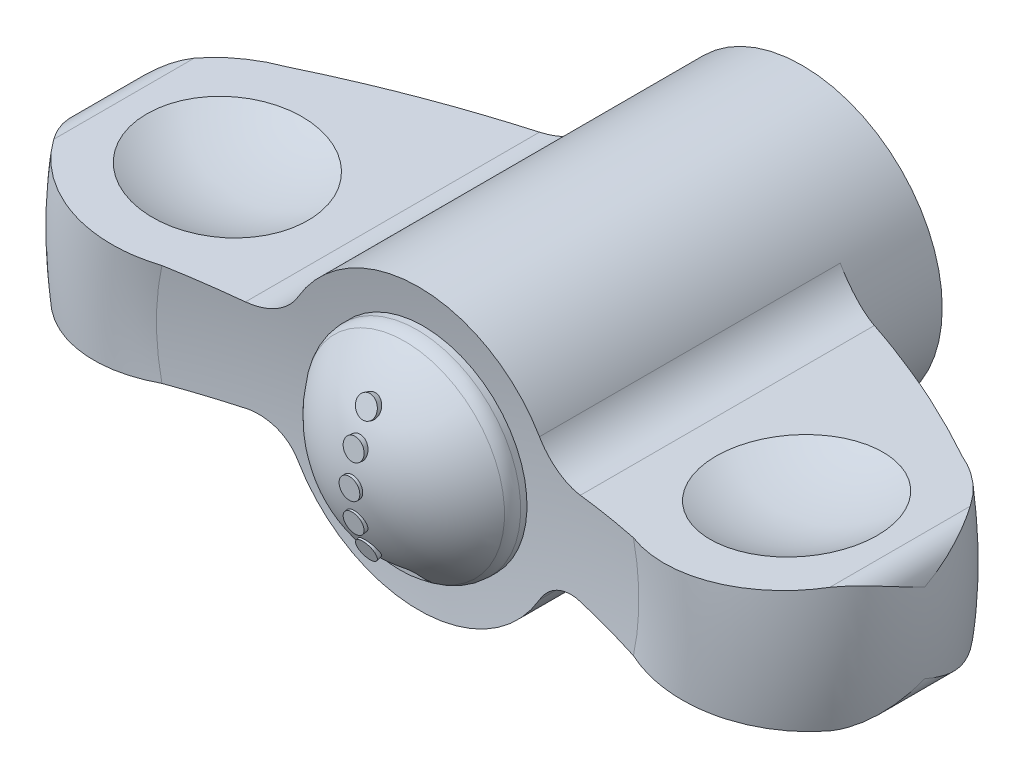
ISO-10303-21;
HEADER;
FILE_DESCRIPTION(('STEP AP214'),'2;1');
FILE_NAME('part.step','',(''),(''),'','','');
FILE_SCHEMA(('AUTOMOTIVE_DESIGN { 1 0 10303 214 1 1 1 1 }'));
ENDSEC;
DATA;
#1=APPLICATION_CONTEXT('core data for automotive mechanical design processes');
#2=APPLICATION_PROTOCOL_DEFINITION('international standard','automotive_design',2000,#1);
#3=PRODUCT_CONTEXT('',#1,'mechanical');
#4=PRODUCT('Part','Part','',(#3));
#5=PRODUCT_RELATED_PRODUCT_CATEGORY('part','',(#4));
#6=PRODUCT_DEFINITION_FORMATION('','',#4);
#7=PRODUCT_DEFINITION_CONTEXT('part definition',#1,'design');
#8=PRODUCT_DEFINITION('design','',#6,#7);
#9=PRODUCT_DEFINITION_SHAPE('','',#8);
#10=(LENGTH_UNIT() NAMED_UNIT(*) SI_UNIT(.MILLI.,.METRE.));
#11=(NAMED_UNIT(*) PLANE_ANGLE_UNIT() SI_UNIT($,.RADIAN.));
#12=(NAMED_UNIT(*) SI_UNIT($,.STERADIAN.) SOLID_ANGLE_UNIT());
#13=UNCERTAINTY_MEASURE_WITH_UNIT(LENGTH_MEASURE(1.E-05),#10,'distance_accuracy_value','');
#14=(GEOMETRIC_REPRESENTATION_CONTEXT(3) GLOBAL_UNCERTAINTY_ASSIGNED_CONTEXT((#13)) GLOBAL_UNIT_ASSIGNED_CONTEXT((#10,
#11,#12)) REPRESENTATION_CONTEXT('',''));
#15=CARTESIAN_POINT('',(0.,0.,0.));
#16=DIRECTION('',(0.,0.,1.));
#17=DIRECTION('',(1.,0.,0.));
#18=AXIS2_PLACEMENT_3D('',#15,#16,#17);
#19=CARTESIAN_POINT('',(0.,-3.00068865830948,21.0224221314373));
#20=DIRECTION('',(0.,0.342020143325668,-0.939692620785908));
#21=DIRECTION('',(0.,0.939692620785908,0.342020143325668));
#22=AXIS2_PLACEMENT_3D('',#19,#20,#21);
#23=PLANE('',#22);
#24=CARTESIAN_POINT('',(0.,-3.00068865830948,21.0224221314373));
#25=DIRECTION('',(0.,0.342020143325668,-0.939692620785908));
#26=DIRECTION('',(0.,0.939692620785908,0.342020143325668));
#27=AXIS2_PLACEMENT_3D('',#24,#25,#26);
#28=CIRCLE('',#27,0.5);
#29=CARTESIAN_POINT('',(0.,-2.53084234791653,21.1934322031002));
#30=VERTEX_POINT('',#29);
#31=EDGE_CURVE('E683',#30,#30,#28,.T.);
#32=ORIENTED_EDGE('',*,*,#31,.F.);
#33=EDGE_LOOP('',(#32));
#34=FACE_BOUND('',#33,.T.);
#35=ADVANCED_FACE('F14',(#34),#23,.F.);
#36=CARTESIAN_POINT('',(0.,-1.54480758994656,21.6392288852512));
#37=DIRECTION('',(0.,0.139173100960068,-0.99026806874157));
#38=DIRECTION('',(0.,0.99026806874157,0.139173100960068));
#39=AXIS2_PLACEMENT_3D('',#36,#37,#38);
#40=PLANE('',#39);
#41=CARTESIAN_POINT('',(0.,-1.54480758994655,21.6392288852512));
#42=DIRECTION('',(0.,0.139173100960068,-0.99026806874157));
#43=DIRECTION('',(0.,0.99026806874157,0.139173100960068));
#44=AXIS2_PLACEMENT_3D('',#41,#42,#43);
#45=CIRCLE('',#44,0.5);
#46=CARTESIAN_POINT('',(0.,-1.04967355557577,21.7088154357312));
#47=VERTEX_POINT('',#46);
#48=EDGE_CURVE('E691',#47,#47,#45,.T.);
#49=ORIENTED_EDGE('',*,*,#48,.F.);
#50=EDGE_LOOP('',(#49));
#51=FACE_BOUND('',#50,.T.);
#52=ADVANCED_FACE('F1067',(#51),#40,.F.);
#53=CARTESIAN_POINT('',(0.,2.53084234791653,21.1934322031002));
#54=DIRECTION('',(0.,-0.34202014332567,-0.939692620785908));
#55=DIRECTION('',(0.,0.939692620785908,-0.34202014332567));
#56=AXIS2_PLACEMENT_3D('',#53,#54,#55);
#57=PLANE('',#56);
#58=CARTESIAN_POINT('',(0.,3.00068865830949,21.0224221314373));
#59=DIRECTION('',(0.,0.34202014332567,0.939692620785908));
#60=DIRECTION('',(0.,-0.939692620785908,0.34202014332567));
#61=AXIS2_PLACEMENT_3D('',#58,#59,#60);
#62=CIRCLE('',#61,0.5);
#63=CARTESIAN_POINT('',(0.,2.53084234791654,21.1934322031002));
#64=VERTEX_POINT('',#63);
#65=EDGE_CURVE('E686',#64,#64,#62,.T.);
#66=ORIENTED_EDGE('',*,*,#65,.T.);
#67=EDGE_LOOP('',(#66));
#68=FACE_BOUND('',#67,.T.);
#69=ADVANCED_FACE('F1069',(#68),#57,.F.);
#70=CARTESIAN_POINT('',(0.,1.04967355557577,21.7088154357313));
#71=DIRECTION('',(0.,-0.139173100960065,-0.99026806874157));
#72=DIRECTION('',(0.,0.99026806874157,-0.139173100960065));
#73=AXIS2_PLACEMENT_3D('',#70,#71,#72);
#74=PLANE('',#73);
#75=CARTESIAN_POINT('',(0.,1.54480758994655,21.6392288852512));
#76=DIRECTION('',(0.,0.139173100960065,0.99026806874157));
#77=DIRECTION('',(0.,-0.99026806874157,0.139173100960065));
#78=AXIS2_PLACEMENT_3D('',#75,#76,#77);
#79=CIRCLE('',#78,0.5);
#80=CARTESIAN_POINT('',(0.,1.04967355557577,21.7088154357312));
#81=VERTEX_POINT('',#80);
#82=EDGE_CURVE('E696',#81,#81,#79,.T.);
#83=ORIENTED_EDGE('',*,*,#82,.T.);
#84=EDGE_LOOP('',(#83));
#85=FACE_BOUND('',#84,.T.);
#86=ADVANCED_FACE('F1071',(#85),#74,.F.);
#87=CARTESIAN_POINT('',(0.,0.,21.84));
#88=DIRECTION('',(0.,0.,-1.));
#89=DIRECTION('',(-1.,0.,0.));
#90=AXIS2_PLACEMENT_3D('',#87,#88,#89);
#91=PLANE('',#90);
#92=CARTESIAN_POINT('',(0.,0.,21.84));
#93=DIRECTION('',(0.,0.,-1.));
#94=DIRECTION('',(-1.,0.,0.));
#95=AXIS2_PLACEMENT_3D('',#92,#93,#94);
#96=CIRCLE('',#95,0.5);
#97=CARTESIAN_POINT('',(-0.5,0.,21.84));
#98=VERTEX_POINT('',#97);
#99=EDGE_CURVE('E699',#98,#98,#96,.T.);
#100=ORIENTED_EDGE('',*,*,#99,.F.);
#101=EDGE_LOOP('',(#100));
#102=FACE_BOUND('',#101,.T.);
#103=ADVANCED_FACE('F1063',(#102),#91,.F.);
#104=CARTESIAN_POINT('',(0.,-2.85450790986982,20.6207938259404));
#105=DIRECTION('',(0.,0.342020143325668,-0.939692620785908));
#106=DIRECTION('',(0.,0.939692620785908,0.342020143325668));
#107=AXIS2_PLACEMENT_3D('',#104,#105,#106);
#108=CYLINDRICAL_SURFACE('',#107,0.499999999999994);
#109=CARTESIAN_POINT('',(-0.331937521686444,-3.26433647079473,20.653514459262));
#110=CARTESIAN_POINT('',(-0.353160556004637,-3.2478373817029,20.6632736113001));
#111=CARTESIAN_POINT('',(-0.372761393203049,-3.22976392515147,20.6739665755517));
#112=CARTESIAN_POINT('',(-0.408161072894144,-3.1910198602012,20.6968974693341));
#113=CARTESIAN_POINT('',(-0.423954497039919,-3.17034561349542,20.7091375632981));
#114=CARTESIAN_POINT('',(-0.451285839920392,-3.12704450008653,20.7347852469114));
#115=CARTESIAN_POINT('',(-0.46282860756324,-3.10441989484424,20.7481914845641));
#116=CARTESIAN_POINT('',(-0.481385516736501,-3.05785076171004,20.7758007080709));
#117=CARTESIAN_POINT('',(-0.48840082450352,-3.03390657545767,20.7900034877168));
#118=CARTESIAN_POINT('',(-0.497786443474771,-2.98509323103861,20.8189754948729));
#119=CARTESIAN_POINT('',(-0.500105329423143,-2.96021683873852,20.8337492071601));
#120=CARTESIAN_POINT('',(-0.499887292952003,-2.91048702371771,20.8633037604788));
#121=CARTESIAN_POINT('',(-0.497349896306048,-2.88563360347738,20.8780846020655));
#122=CARTESIAN_POINT('',(-0.487451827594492,-2.83649120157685,20.907333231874));
#123=CARTESIAN_POINT('',(-0.480060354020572,-2.812206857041,20.9217984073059));
#124=CARTESIAN_POINT('',(-0.460614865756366,-2.76506660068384,20.9499012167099));
#125=CARTESIAN_POINT('',(-0.448560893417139,-2.7422106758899,20.9635388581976));
#126=CARTESIAN_POINT('',(-0.420176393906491,-2.69870145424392,20.9895219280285));
#127=CARTESIAN_POINT('',(-0.403866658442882,-2.67803811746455,21.0018732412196));
#128=CARTESIAN_POINT('',(-0.367382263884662,-2.63940727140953,21.0249834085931));
#129=CARTESIAN_POINT('',(-0.347207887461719,-2.6214395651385,21.0357423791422));
#130=CARTESIAN_POINT('',(-0.303871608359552,-2.5889902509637,21.0551872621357));
#131=CARTESIAN_POINT('',(-0.280756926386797,-2.57446215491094,21.0639008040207));
#132=CARTESIAN_POINT('',(-0.231969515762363,-2.54901547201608,21.0791721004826));
#133=CARTESIAN_POINT('',(-0.206297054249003,-2.53809650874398,21.0857300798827));
#134=CARTESIAN_POINT('',(-0.153615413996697,-2.52037710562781,21.0963767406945));
#135=CARTESIAN_POINT('',(-0.126638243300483,-2.51350668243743,21.1005073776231));
#136=CARTESIAN_POINT('',(-0.0717133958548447,-2.50380241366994,21.106342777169));
#137=CARTESIAN_POINT('',(-0.0437658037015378,-2.50096821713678,21.1080477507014));
#138=CARTESIAN_POINT('',(0.0119208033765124,-2.49943665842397,21.1089690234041));
#139=CARTESIAN_POINT('',(0.0396578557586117,-2.50068638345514,21.1082171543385));
#140=CARTESIAN_POINT('',(0.0944902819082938,-2.50716698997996,21.104319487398));
#141=CARTESIAN_POINT('',(0.1215856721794,-2.51239776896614,21.1011737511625));
#142=CARTESIAN_POINT('',(0.174324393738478,-2.52666529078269,21.0925979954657));
#143=CARTESIAN_POINT('',(0.199970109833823,-2.53569556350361,21.0871718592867));
#144=CARTESIAN_POINT('',(0.249153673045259,-2.55728656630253,21.0742073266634));
#145=CARTESIAN_POINT('',(0.272691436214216,-2.56984743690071,21.0666688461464));
#146=CARTESIAN_POINT('',(0.317255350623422,-2.5982727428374,21.0496232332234));
#147=CARTESIAN_POINT('',(0.338253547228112,-2.61416945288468,21.0400968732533));
#148=CARTESIAN_POINT('',(0.376904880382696,-2.64872370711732,21.0194081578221));
#149=CARTESIAN_POINT('',(0.394557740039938,-2.66738147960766,21.0082456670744));
#150=CARTESIAN_POINT('',(0.426337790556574,-2.70726920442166,20.9844033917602));
#151=CARTESIAN_POINT('',(0.440399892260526,-2.72853751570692,20.9717010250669));
#152=CARTESIAN_POINT('',(0.464242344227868,-2.77278529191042,20.9452978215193));
#153=CARTESIAN_POINT('',(0.47402230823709,-2.79576491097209,20.9315968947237));
#154=CARTESIAN_POINT('',(0.489178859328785,-2.84318364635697,20.9033482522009));
#155=CARTESIAN_POINT('',(0.494481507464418,-2.86764038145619,20.8887904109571));
#156=CARTESIAN_POINT('',(0.500278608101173,-2.91698135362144,20.8594424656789));
#157=CARTESIAN_POINT('',(0.500772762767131,-2.9418656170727,20.8446523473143));
#158=CARTESIAN_POINT('',(0.496921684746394,-2.99158022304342,20.8151236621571));
#159=CARTESIAN_POINT('',(0.49253489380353,-3.01640827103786,20.8003866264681));
#160=CARTESIAN_POINT('',(0.47896491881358,-3.0650835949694,20.7715110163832));
#161=CARTESIAN_POINT('',(0.469781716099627,-3.08893086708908,20.7573724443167));
#162=CARTESIAN_POINT('',(0.446884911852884,-3.13489383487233,20.730134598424));
#163=CARTESIAN_POINT('',(0.433182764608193,-3.15701373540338,20.7170327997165));
#164=CARTESIAN_POINT('',(0.401605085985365,-3.1989312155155,20.6922139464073));
#165=CARTESIAN_POINT('',(0.383729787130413,-3.21872892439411,20.6804968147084));
#166=CARTESIAN_POINT('',(0.344542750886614,-3.25516787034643,20.6589368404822));
#167=CARTESIAN_POINT('',(0.323276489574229,-3.27184528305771,20.6490725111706));
#168=CARTESIAN_POINT('',(0.277744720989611,-3.30182836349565,20.6313418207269));
#169=CARTESIAN_POINT('',(0.253479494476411,-3.31513434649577,20.6234752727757));
#170=CARTESIAN_POINT('',(0.20307812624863,-3.33775837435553,20.610101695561));
#171=CARTESIAN_POINT('',(0.176980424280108,-3.3471398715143,20.6045571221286));
#172=CARTESIAN_POINT('',(0.123310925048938,-3.36193712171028,20.5958124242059));
#173=CARTESIAN_POINT('',(0.0957393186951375,-3.36735338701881,20.5926119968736));
#174=CARTESIAN_POINT('',(0.0403186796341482,-3.37400018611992,20.5886845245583));
#175=CARTESIAN_POINT('',(0.012478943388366,-3.37528829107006,20.5879234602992));
#176=CARTESIAN_POINT('',(-0.0430606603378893,-3.37379995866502,20.588802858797));
#177=CARTESIAN_POINT('',(-0.0707604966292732,-3.37102265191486,20.5904438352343));
#178=CARTESIAN_POINT('',(-0.12509594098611,-3.36151286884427,20.5960632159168));
#179=CARTESIAN_POINT('',(-0.151735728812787,-3.35479801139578,20.6000312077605));
#180=CARTESIAN_POINT('',(-0.203314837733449,-3.3376385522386,20.6101726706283));
#181=CARTESIAN_POINT('',(-0.228256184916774,-3.32719849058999,20.6163434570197));
#182=CARTESIAN_POINT('',(-0.266264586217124,-3.3077769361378,20.627825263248));
#183=CARTESIAN_POINT('',(-0.280094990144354,-3.29987879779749,20.6324950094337));
#184=CARTESIAN_POINT('',(-0.306777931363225,-3.28294239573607,20.6425099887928));
#185=CARTESIAN_POINT('',(-0.319630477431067,-3.27390414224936,20.6478552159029));
#186=CARTESIAN_POINT('',(-0.331937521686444,-3.26433647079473,20.653514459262));
#187=B_SPLINE_CURVE_WITH_KNOTS('',3,(#109,#110,#111,#112,#113,#114,#115,#116,#117,#118,#119,
#120,#121,#122,#123,#124,#125,#126,#127,#128,#129,#130,#131,#132,#133,#134,#135,#136,#137,#138,
#139,#140,#141,#142,#143,#144,#145,#146,#147,#148,#149,#150,#151,#152,#153,#154,#155,#156,#157,
#158,#159,#160,#161,#162,#163,#164,#165,#166,#167,#168,#169,#170,#171,#172,#173,#174,#175,#176,
#177,#178,#179,#180,#181,#182,#183,#184,#185,#186),.UNSPECIFIED.,.T.,.F.,(4,2,2,2,2,2,2,2,2,2,2,
2,2,2,2,2,2,2,2,2,2,2,2,2,2,2,2,2,2,2,2,2,2,2,2,2,2,2,4),(0.,0.0857339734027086,
0.171589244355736,0.257346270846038,0.343081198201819,0.429749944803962,0.516427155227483,
0.603659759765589,0.690891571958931,0.777704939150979,0.8645119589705,0.950068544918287,
1.03561620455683,1.11963806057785,1.20365261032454,1.28658297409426,1.36951120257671,
1.45229878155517,1.53508965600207,1.61872187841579,1.70236102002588,1.78742306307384,
1.87249277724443,1.95894129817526,2.04539517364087,2.13259082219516,2.21978681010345,
2.30676345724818,2.39373525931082,2.47962601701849,2.56550873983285,2.64994352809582,
2.73436740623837,2.81760866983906,2.90086773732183,2.98375706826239,3.06654572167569,
3.11626251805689,3.16597886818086),.UNSPECIFIED.);
#188=CARTESIAN_POINT('',(-0.331937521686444,-3.26433647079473,20.653514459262));
#189=VERTEX_POINT('',#188);
#190=EDGE_CURVE('E24',#189,#189,#187,.T.);
#191=ORIENTED_EDGE('',*,*,#190,.F.);
#192=EDGE_LOOP('',(#191));
#193=FACE_BOUND('',#192,.T.);
#194=ORIENTED_EDGE('',*,*,#31,.T.);
#195=EDGE_LOOP('',(#194));
#196=FACE_BOUND('',#195,.T.);
#197=ADVANCED_FACE('F1059',(#193,#196),#108,.T.);
#198=CARTESIAN_POINT('',(0.,-1.48315145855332,21.2005227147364));
#199=DIRECTION('',(0.,0.139173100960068,-0.99026806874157));
#200=DIRECTION('',(0.,0.99026806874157,0.139173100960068));
#201=AXIS2_PLACEMENT_3D('',#198,#199,#200);
#202=CYLINDRICAL_SURFACE('',#201,0.5);
#203=CARTESIAN_POINT('',(-0.335700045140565,-1.87987532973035,21.3608657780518));
#204=CARTESIAN_POINT('',(-0.356642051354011,-1.86146109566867,21.3661778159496));
#205=CARTESIAN_POINT('',(-0.375969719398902,-1.84132218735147,21.3719930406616));
#206=CARTESIAN_POINT('',(-0.410838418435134,-1.79819391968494,21.3844648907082));
#207=CARTESIAN_POINT('',(-0.426374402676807,-1.77520082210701,21.3911226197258));
#208=CARTESIAN_POINT('',(-0.453205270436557,-1.72706567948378,21.4050854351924));
#209=CARTESIAN_POINT('',(-0.464503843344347,-1.70192552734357,21.4123899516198));
#210=CARTESIAN_POINT('',(-0.482573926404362,-1.65020483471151,21.4274500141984));
#211=CARTESIAN_POINT('',(-0.48934657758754,-1.62362465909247,21.4352054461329));
#212=CARTESIAN_POINT('',(-0.49822354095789,-1.56958863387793,21.4510122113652));
#213=CARTESIAN_POINT('',(-0.500297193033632,-1.54212821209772,21.4590651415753));
#214=CARTESIAN_POINT('',(-0.499634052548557,-1.4872724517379,21.4752004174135));
#215=CARTESIAN_POINT('',(-0.496896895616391,-1.45987711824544,21.4832827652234));
#216=CARTESIAN_POINT('',(-0.486664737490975,-1.4058068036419,21.4992902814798));
#217=CARTESIAN_POINT('',(-0.479148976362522,-1.3791354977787,21.5072146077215));
#218=CARTESIAN_POINT('',(-0.459544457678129,-1.32740054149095,21.5226460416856));
#219=CARTESIAN_POINT('',(-0.447455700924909,-1.30233689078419,21.5301531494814));
#220=CARTESIAN_POINT('',(-0.419063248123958,-1.25458819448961,21.5445166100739));
#221=CARTESIAN_POINT('',(-0.402768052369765,-1.23189848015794,21.551374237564));
#222=CARTESIAN_POINT('',(-0.366399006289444,-1.18950327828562,21.5642456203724));
#223=CARTESIAN_POINT('',(-0.346325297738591,-1.1697976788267,21.5702594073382));
#224=CARTESIAN_POINT('',(-0.303141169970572,-1.13410606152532,21.5812005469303));
#225=CARTESIAN_POINT('',(-0.280057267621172,-1.11809059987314,21.5861364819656));
#226=CARTESIAN_POINT('',(-0.231376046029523,-1.090052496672,21.5948118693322));
#227=CARTESIAN_POINT('',(-0.205778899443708,-1.07802958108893,21.5985514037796));
#228=CARTESIAN_POINT('',(-0.153124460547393,-1.05846213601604,21.6046551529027));
#229=CARTESIAN_POINT('',(-0.126088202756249,-1.05086594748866,21.6070352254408));
#230=CARTESIAN_POINT('',(-0.0710573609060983,-1.04016316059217,21.6103929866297));
#231=CARTESIAN_POINT('',(-0.0430628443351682,-1.03705624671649,21.6113707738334));
#232=CARTESIAN_POINT('',(0.0127914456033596,-1.03543535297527,21.6118805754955));
#233=CARTESIAN_POINT('',(0.0406497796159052,-1.03687588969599,21.6114269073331));
#234=CARTESIAN_POINT('',(0.0957150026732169,-1.0442065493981,21.6091240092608));
#235=CARTESIAN_POINT('',(0.122921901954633,-1.05009660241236,21.6072748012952));
#236=CARTESIAN_POINT('',(0.175879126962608,-1.066137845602,21.6022585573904));
#237=CARTESIAN_POINT('',(0.201631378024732,-1.07628324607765,21.5990933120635));
#238=CARTESIAN_POINT('',(0.251006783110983,-1.10053489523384,21.5915638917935));
#239=CARTESIAN_POINT('',(0.274629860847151,-1.1146412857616,21.5871996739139));
#240=CARTESIAN_POINT('',(0.319289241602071,-1.14653844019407,21.5773827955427));
#241=CARTESIAN_POINT('',(0.340302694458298,-1.16435852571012,21.5719214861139));
#242=CARTESIAN_POINT('',(0.378948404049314,-1.20309984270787,21.5601098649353));
#243=CARTESIAN_POINT('',(0.396580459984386,-1.22402125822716,21.5537595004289));
#244=CARTESIAN_POINT('',(0.428184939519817,-1.26864327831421,21.5402803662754));
#245=CARTESIAN_POINT('',(0.442111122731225,-1.29237410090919,21.5331432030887));
#246=CARTESIAN_POINT('',(0.465652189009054,-1.34173959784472,21.518361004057));
#247=CARTESIAN_POINT('',(0.475266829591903,-1.3673743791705,21.5107159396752));
#248=CARTESIAN_POINT('',(0.490001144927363,-1.42008763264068,21.4950549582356));
#249=CARTESIAN_POINT('',(0.495076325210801,-1.44717769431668,21.4870361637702));
#250=CARTESIAN_POINT('',(0.500433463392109,-1.50180487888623,21.4709191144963));
#251=CARTESIAN_POINT('',(0.5007152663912,-1.52934201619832,21.4628208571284));
#252=CARTESIAN_POINT('',(0.496465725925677,-1.58419832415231,21.4467326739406));
#253=CARTESIAN_POINT('',(0.491914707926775,-1.61151614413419,21.4387433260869));
#254=CARTESIAN_POINT('',(0.478087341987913,-1.66503715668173,21.4231261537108));
#255=CARTESIAN_POINT('',(0.46881101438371,-1.69124035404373,21.4154983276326));
#256=CARTESIAN_POINT('',(0.445810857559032,-1.74171093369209,21.4008332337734));
#257=CARTESIAN_POINT('',(0.432098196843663,-1.76598298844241,21.3937945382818));
#258=CARTESIAN_POINT('',(0.400593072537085,-1.81195368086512,21.380482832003));
#259=CARTESIAN_POINT('',(0.38280075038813,-1.83365240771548,21.3742097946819));
#260=CARTESIAN_POINT('',(0.343785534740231,-1.87367405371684,21.3626526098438));
#261=CARTESIAN_POINT('',(0.322590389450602,-1.89202190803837,21.3573611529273));
#262=CARTESIAN_POINT('',(0.277267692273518,-1.924999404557,21.3478583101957));
#263=CARTESIAN_POINT('',(0.253140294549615,-1.9396292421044,21.343646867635));
#264=CARTESIAN_POINT('',(0.202892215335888,-1.964602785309,21.3364617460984));
#265=CARTESIAN_POINT('',(0.176793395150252,-1.97498710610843,21.3334763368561));
#266=CARTESIAN_POINT('',(0.123144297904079,-1.99135922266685,21.3287708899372));
#267=CARTESIAN_POINT('',(0.0955941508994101,-1.99734741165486,21.3270507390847));
#268=CARTESIAN_POINT('',(0.0400595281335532,-2.00471583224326,21.3249342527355));
#269=CARTESIAN_POINT('',(0.0120802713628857,-2.0061324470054,21.3245274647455));
#270=CARTESIAN_POINT('',(-0.0437341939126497,-2.00441672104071,21.3250202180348));
#271=CARTESIAN_POINT('',(-0.0715693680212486,-2.00128334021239,21.3259200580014));
#272=CARTESIAN_POINT('',(-0.126229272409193,-1.99057490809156,21.3289964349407));
#273=CARTESIAN_POINT('',(-0.153056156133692,-1.9830099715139,21.3311700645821));
#274=CARTESIAN_POINT('',(-0.204989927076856,-1.96367665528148,21.3367284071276));
#275=CARTESIAN_POINT('',(-0.23009885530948,-1.95191337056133,21.3401116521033));
#276=CARTESIAN_POINT('',(-0.268604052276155,-1.92987542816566,21.3464552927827));
#277=CARTESIAN_POINT('',(-0.282759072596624,-1.92079973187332,21.349068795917));
#278=CARTESIAN_POINT('',(-0.310035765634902,-1.90131401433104,21.3546832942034));
#279=CARTESIAN_POINT('',(-0.323157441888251,-1.89090399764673,21.3576842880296));
#280=CARTESIAN_POINT('',(-0.335700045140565,-1.87987532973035,21.3608657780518));
#281=B_SPLINE_CURVE_WITH_KNOTS('',3,(#203,#204,#205,#206,#207,#208,#209,#210,#211,#212,#213,
#214,#215,#216,#217,#218,#219,#220,#221,#222,#223,#224,#225,#226,#227,#228,#229,#230,#231,#232,
#233,#234,#235,#236,#237,#238,#239,#240,#241,#242,#243,#244,#245,#246,#247,#248,#249,#250,#251,
#252,#253,#254,#255,#256,#257,#258,#259,#260,#261,#262,#263,#264,#265,#266,#267,#268,#269,#270,
#271,#272,#273,#274,#275,#276,#277,#278,#279,#280),.UNSPECIFIED.,.T.,.F.,(4,2,2,2,2,2,2,2,2,2,2,
2,2,2,2,2,2,2,2,2,2,2,2,2,2,2,2,2,2,2,2,2,2,2,2,2,2,2,4),(0.,0.0851007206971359,
0.170314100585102,0.255453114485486,0.340570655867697,0.426241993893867,0.5119198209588,
0.597972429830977,0.684025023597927,0.769905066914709,0.855781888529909,0.940947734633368,
1.0261077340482,1.11025293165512,1.19439221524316,1.27769261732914,1.36099170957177,
1.44417783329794,1.52736693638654,1.61123959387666,1.69511723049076,1.77999699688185,
1.86488153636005,1.95058925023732,2.03629973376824,2.12236048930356,2.20842087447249,
2.29426626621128,2.38010868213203,2.46528367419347,2.55045419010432,2.63478969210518,
2.71911764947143,2.80277280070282,2.88644707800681,2.9699311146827,3.05331418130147,
3.10428294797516,3.15525154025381),.UNSPECIFIED.);
#282=CARTESIAN_POINT('',(-0.335700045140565,-1.87987532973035,21.3608657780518));
#283=VERTEX_POINT('',#282);
#284=EDGE_CURVE('E1080',#283,#283,#281,.T.);
#285=ORIENTED_EDGE('',*,*,#284,.F.);
#286=EDGE_LOOP('',(#285));
#287=FACE_BOUND('',#286,.T.);
#288=ORIENTED_EDGE('',*,*,#48,.T.);
#289=EDGE_LOOP('',(#288));
#290=FACE_BOUND('',#289,.T.);
#291=ADVANCED_FACE('F756',(#287,#290),#202,.T.);
#292=CARTESIAN_POINT('',(1.2,-3.5,29.39));
#293=DIRECTION('',(0.,-1.,0.));
#294=DIRECTION('',(1.,0.,0.));
#295=AXIS2_PLACEMENT_3D('',#292,#293,#294);
#296=PLANE('',#295);
#297=DIRECTION('',(0.,0.,-1.));
#298=VECTOR('',#297,1.);
#299=CARTESIAN_POINT('',(-1.2,-3.5,29.39));
#300=LINE('',#299,#298);
#301=CARTESIAN_POINT('',(-1.2,-3.5,20.3405261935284));
#302=VERTEX_POINT('',#301);
#303=CARTESIAN_POINT('',(-1.2,-3.5,19.39));
#304=VERTEX_POINT('',#303);
#305=EDGE_CURVE('E712',#302,#304,#300,.T.);
#306=ORIENTED_EDGE('',*,*,#305,.T.);
#307=DIRECTION('',(-1.,0.,0.));
#308=VECTOR('',#307,1.);
#309=CARTESIAN_POINT('',(1.2,-3.5,19.39));
#310=LINE('',#309,#308);
#311=CARTESIAN_POINT('',(1.2,-3.5,19.39));
#312=VERTEX_POINT('',#311);
#313=EDGE_CURVE('E704',#312,#304,#310,.T.);
#314=ORIENTED_EDGE('',*,*,#313,.F.);
#315=DIRECTION('',(0.,0.,-1.));
#316=VECTOR('',#315,1.);
#317=CARTESIAN_POINT('',(1.2,-3.5,29.39));
#318=LINE('',#317,#316);
#319=CARTESIAN_POINT('',(1.2,-3.5,20.3405261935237));
#320=VERTEX_POINT('',#319);
#321=EDGE_CURVE('E199',#320,#312,#318,.T.);
#322=ORIENTED_EDGE('',*,*,#321,.F.);
#323=CARTESIAN_POINT('',(0.,-3.5,20.4968072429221));
#324=CARTESIAN_POINT('',(0.131740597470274,-3.5,20.4968089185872));
#325=CARTESIAN_POINT('',(0.263462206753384,-3.5,20.4912304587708));
#326=CARTESIAN_POINT('',(0.526004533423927,-3.5,20.4689817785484));
#327=CARTESIAN_POINT('',(0.656825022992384,-3.5,20.4523088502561));
#328=CARTESIAN_POINT('',(0.91672285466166,-3.5,20.408020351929));
#329=CARTESIAN_POINT('',(1.04579856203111,-3.5,20.3803951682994));
#330=CARTESIAN_POINT('',(1.30121620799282,-3.5,20.3144929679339));
#331=CARTESIAN_POINT('',(1.42755710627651,-3.5,20.2762119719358));
#332=CARTESIAN_POINT('',(1.80197213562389,-3.5,20.1456011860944));
#333=CARTESIAN_POINT('',(2.04478213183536,-3.5,20.0376168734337));
#334=CARTESIAN_POINT('',(2.50948960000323,-3.5,19.7838038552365));
#335=CARTESIAN_POINT('',(2.73138886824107,-3.5,19.6379784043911));
#336=CARTESIAN_POINT('',(3.15612085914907,-3.5,19.3072417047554));
#337=CARTESIAN_POINT('',(3.35805789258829,-3.5,19.1211778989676));
#338=CARTESIAN_POINT('',(3.72880972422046,-3.5,18.7185577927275));
#339=CARTESIAN_POINT('',(3.89761954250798,-3.5,18.5019969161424));
#340=CARTESIAN_POINT('',(4.20176435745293,-3.5,18.0383775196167));
#341=CARTESIAN_POINT('',(4.33611433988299,-3.5,17.7906722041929));
#342=CARTESIAN_POINT('',(4.56189392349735,-3.5,17.276416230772));
#343=CARTESIAN_POINT('',(4.65332009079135,-3.5,17.0098640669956));
#344=CARTESIAN_POINT('',(4.79167045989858,-3.5,16.4620020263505));
#345=CARTESIAN_POINT('',(4.83804225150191,-3.5,16.180552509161));
#346=CARTESIAN_POINT('',(4.88308774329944,-3.5,15.6138605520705));
#347=CARTESIAN_POINT('',(4.88176005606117,-3.5,15.328618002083));
#348=CARTESIAN_POINT('',(4.83133688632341,-3.5,14.761200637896));
#349=CARTESIAN_POINT('',(4.78204561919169,-3.5,14.4790431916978));
#350=CARTESIAN_POINT('',(4.63674392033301,-3.5,13.9270187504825));
#351=CARTESIAN_POINT('',(4.54073312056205,-3.5,13.6571518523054));
#352=CARTESIAN_POINT('',(4.30473985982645,-3.5,13.1377417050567));
#353=CARTESIAN_POINT('',(4.16480720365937,-3.5,12.8881758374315));
#354=CARTESIAN_POINT('',(3.84474196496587,-3.5,12.4162875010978));
#355=CARTESIAN_POINT('',(3.66460946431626,-3.5,12.193964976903));
#356=CARTESIAN_POINT('',(3.27053375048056,-3.5,11.7847480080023));
#357=CARTESIAN_POINT('',(3.05684700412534,-3.5,11.5976067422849));
#358=CARTESIAN_POINT('',(2.60057157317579,-3.5,11.2626259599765));
#359=CARTESIAN_POINT('',(2.35798390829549,-3.5,11.1147850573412));
#360=CARTESIAN_POINT('',(1.85550651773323,-3.5,10.8658860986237));
#361=CARTESIAN_POINT('',(1.59602490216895,-3.5,10.7640053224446));
#362=CARTESIAN_POINT('',(1.06330692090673,-3.5,10.60700876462));
#363=CARTESIAN_POINT('',(0.790075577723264,-3.5,10.5518760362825));
#364=CARTESIAN_POINT('',(0.247649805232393,-3.5,10.491882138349));
#365=CARTESIAN_POINT('',(-0.0213615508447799,-3.5,10.48536124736));
#366=CARTESIAN_POINT('',(-0.556507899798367,-3.5,10.5185113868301));
#367=CARTESIAN_POINT('',(-0.822643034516,-3.5,10.5581801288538));
#368=CARTESIAN_POINT('',(-1.33970267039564,-3.5,10.6808517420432));
#369=CARTESIAN_POINT('',(-1.59081270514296,-3.5,10.7630776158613));
#370=CARTESIAN_POINT('',(-2.07625744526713,-3.5,10.9673671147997));
#371=CARTESIAN_POINT('',(-2.31058977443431,-3.5,11.0894363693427));
#372=CARTESIAN_POINT('',(-2.76284666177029,-3.5,11.3734608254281));
#373=CARTESIAN_POINT('',(-2.98013354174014,-3.5,11.5364310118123));
#374=CARTESIAN_POINT('',(-3.3853086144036,-3.5,11.8955252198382));
#375=CARTESIAN_POINT('',(-3.57319349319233,-3.5,12.0916529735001));
#376=CARTESIAN_POINT('',(-3.92014590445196,-3.5,12.5180980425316));
#377=CARTESIAN_POINT('',(-4.07815076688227,-3.5,12.7492806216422));
#378=CARTESIAN_POINT('',(-4.35381511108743,-3.5,13.2345664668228));
#379=CARTESIAN_POINT('',(-4.4714705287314,-3.5,13.4886720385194));
#380=CARTESIAN_POINT('',(-4.66487523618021,-3.5,14.0169253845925));
#381=CARTESIAN_POINT('',(-4.73993457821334,-3.5,14.2913259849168));
#382=CARTESIAN_POINT('',(-4.84322965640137,-3.5,14.8488048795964));
#383=CARTESIAN_POINT('',(-4.87146336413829,-3.5,15.1318835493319));
#384=CARTESIAN_POINT('',(-4.88037336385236,-3.5,15.7005227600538));
#385=CARTESIAN_POINT('',(-4.86075865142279,-3.5,15.9860879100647));
#386=CARTESIAN_POINT('',(-4.77389160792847,-3.5,16.5498833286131));
#387=CARTESIAN_POINT('',(-4.70663858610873,-3.5,16.8281134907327));
#388=CARTESIAN_POINT('',(-4.52628041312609,-3.5,17.3694366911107));
#389=CARTESIAN_POINT('',(-4.41315521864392,-3.5,17.6325230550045));
#390=CARTESIAN_POINT('',(-4.14413776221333,-3.5,18.1358377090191));
#391=CARTESIAN_POINT('',(-3.9882471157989,-3.5,18.3760668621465));
#392=CARTESIAN_POINT('',(-3.63885181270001,-3.5,18.8254432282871));
#393=CARTESIAN_POINT('',(-3.44554542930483,-3.5,19.0347444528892));
#394=CARTESIAN_POINT('',(-3.02607637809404,-3.5,19.4174265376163));
#395=CARTESIAN_POINT('',(-2.79990578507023,-3.5,19.5907987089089));
#396=CARTESIAN_POINT('',(-2.32415325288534,-3.5,19.8938443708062));
#397=CARTESIAN_POINT('',(-2.07493815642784,-3.5,20.0240887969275));
#398=CARTESIAN_POINT('',(-1.68746510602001,-3.5,20.1854435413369));
#399=CARTESIAN_POINT('',(-1.55605874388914,-3.5,20.2335538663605));
#400=CARTESIAN_POINT('',(-1.28954215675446,-3.5,20.3180573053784));
#401=CARTESIAN_POINT('',(-1.15443310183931,-3.5,20.3544540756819));
#402=CARTESIAN_POINT('',(-0.851019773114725,-3.5,20.4219055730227));
#403=CARTESIAN_POINT('',(-0.682039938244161,-3.5,20.4499525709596));
#404=CARTESIAN_POINT('',(-0.342029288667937,-3.5,20.4874015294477));
#405=CARTESIAN_POINT('',(-0.170998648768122,-3.5,20.496805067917));
#406=CARTESIAN_POINT('',(0.,-3.5,20.4968072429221));
#407=B_SPLINE_CURVE_WITH_KNOTS('',3,(#323,#324,#325,#326,#327,#328,#329,#330,#331,#332,#333,
#334,#335,#336,#337,#338,#339,#340,#341,#342,#343,#344,#345,#346,#347,#348,#349,#350,#351,#352,
#353,#354,#355,#356,#357,#358,#359,#360,#361,#362,#363,#364,#365,#366,#367,#368,#369,#370,#371,
#372,#373,#374,#375,#376,#377,#378,#379,#380,#381,#382,#383,#384,#385,#386,#387,#388,#389,#390,
#391,#392,#393,#394,#395,#396,#397,#398,#399,#400,#401,#402,#403,#404,#405,#406),.UNSPECIFIED.,
.T.,.F.,(4,2,2,2,2,2,2,2,2,2,2,2,2,2,2,2,2,2,2,2,2,2,2,2,2,2,2,2,2,2,2,2,2,2,2,2,2,2,2,2,2,4),
(0.,0.395070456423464,0.790237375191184,1.1857519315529,1.58141438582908,2.37471332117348,
3.16794404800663,3.98793317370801,4.80804547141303,5.64949143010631,6.49100469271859,
7.34271018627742,8.19444045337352,9.04966208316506,9.90489045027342,10.7591525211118,
11.6134128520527,12.4614359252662,13.3094290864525,14.1415734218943,14.9734159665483,
15.7767214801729,16.5799871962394,17.3690790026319,18.1582823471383,18.9694373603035,
19.7806837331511,20.6168534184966,21.4531073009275,22.3025457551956,23.1520210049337,
24.0066754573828,24.8613423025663,25.7163829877,26.5713913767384,27.4219871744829,
28.2727884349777,29.1118287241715,29.531188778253,29.9504178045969,30.4632607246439,
30.9760602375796),.UNSPECIFIED.);
#408=EDGE_CURVE('E205',#302,#320,#407,.T.);
#409=ORIENTED_EDGE('',*,*,#408,.F.);
#410=EDGE_LOOP('',(#306,#314,#322,#409));
#411=FACE_BOUND('',#410,.T.);
#412=ADVANCED_FACE('F231',(#411),#296,.T.);
#413=CARTESIAN_POINT('',(-1.2,-3.8,29.39));
#414=DIRECTION('',(0.,0.,-1.));
#415=DIRECTION('',(-1.,0.,0.));
#416=AXIS2_PLACEMENT_3D('',#413,#414,#415);
#417=CYLINDRICAL_SURFACE('',#416,0.3);
#418=DIRECTION('',(0.,0.,-1.));
#419=VECTOR('',#418,1.);
#420=CARTESIAN_POINT('',(-1.5,-3.8,29.39));
#421=LINE('',#420,#419);
#422=CARTESIAN_POINT('',(-1.5,-3.8,19.9992737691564));
#423=VERTEX_POINT('',#422);
#424=CARTESIAN_POINT('',(-1.5,-3.8,19.39));
#425=VERTEX_POINT('',#424);
#426=EDGE_CURVE('E710',#423,#425,#421,.T.);
#427=ORIENTED_EDGE('',*,*,#426,.T.);
#428=CARTESIAN_POINT('',(-1.2,-3.8,19.39));
#429=DIRECTION('',(0.,0.,1.));
#430=DIRECTION('',(0.,1.,0.));
#431=AXIS2_PLACEMENT_3D('',#428,#429,#430);
#432=CIRCLE('',#431,0.3);
#433=EDGE_CURVE('E707',#304,#425,#432,.T.);
#434=ORIENTED_EDGE('',*,*,#433,.F.);
#435=ORIENTED_EDGE('',*,*,#305,.F.);
#436=CARTESIAN_POINT('',(-1.49999993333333,-3.8002,19.9990948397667));
#437=CARTESIAN_POINT('',(-1.49999334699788,-3.7813858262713,20.0159331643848));
#438=CARTESIAN_POINT('',(-1.4982548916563,-3.76277851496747,20.0329829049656));
#439=CARTESIAN_POINT('',(-1.49138118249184,-3.72618386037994,20.0673049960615));
#440=CARTESIAN_POINT('',(-1.4862240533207,-3.70820129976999,20.084578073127));
#441=CARTESIAN_POINT('',(-1.47107673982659,-3.66946395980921,20.1227108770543));
#442=CARTESIAN_POINT('',(-1.46027106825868,-3.64897331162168,20.1435207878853));
#443=CARTESIAN_POINT('',(-1.43368015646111,-3.61042106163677,20.1841517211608));
#444=CARTESIAN_POINT('',(-1.41790735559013,-3.59235355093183,20.2039750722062));
#445=CARTESIAN_POINT('',(-1.38744517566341,-3.5652023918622,20.2354335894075));
#446=CARTESIAN_POINT('',(-1.37416144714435,-3.55513628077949,20.24758793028));
#447=CARTESIAN_POINT('',(-1.34535452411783,-3.53701576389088,20.270711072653));
#448=CARTESIAN_POINT('',(-1.32983363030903,-3.52895931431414,20.2816810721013));
#449=CARTESIAN_POINT('',(-1.30022147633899,-3.51688457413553,20.2997716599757));
#450=CARTESIAN_POINT('',(-1.28652948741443,-3.51237171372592,20.3072145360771));
#451=CARTESIAN_POINT('',(-1.25803125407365,-3.50530346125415,20.3207244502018));
#452=CARTESIAN_POINT('',(-1.24322866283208,-3.50274193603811,20.3267957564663));
#453=CARTESIAN_POINT('',(-1.21875574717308,-3.50043999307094,20.3352009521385));
#454=CARTESIAN_POINT('',(-1.20932909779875,-3.49998975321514,20.3380699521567));
#455=CARTESIAN_POINT('',(-1.19980000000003,-3.50000006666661,20.3405789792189));
#456=B_SPLINE_CURVE_WITH_KNOTS('',3,(#436,#437,#438,#439,#440,#441,#442,#443,#444,#445,#446,
#447,#448,#449,#450,#451,#452,#453,#454,#455),.UNSPECIFIED.,.F.,.F.,(4,2,2,2,2,2,2,2,2,4),(0.,
0.0756646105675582,0.151818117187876,0.244779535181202,0.337509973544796,0.399190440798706,
0.460807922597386,0.509305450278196,0.557649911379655,0.587186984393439),.UNSPECIFIED.);
#457=EDGE_CURVE('E207',#423,#302,#456,.T.);
#458=ORIENTED_EDGE('',*,*,#457,.F.);
#459=EDGE_LOOP('',(#427,#434,#435,#458));
#460=FACE_BOUND('',#459,.T.);
#461=ADVANCED_FACE('F747',(#460),#417,.F.);
#462=CARTESIAN_POINT('',(-1.5,-3.8,29.39));
#463=DIRECTION('',(1.,0.,0.));
#464=DIRECTION('',(0.,1.,0.));
#465=AXIS2_PLACEMENT_3D('',#462,#463,#464);
#466=PLANE('',#465);
#467=DIRECTION('',(0.,-1.,0.));
#468=VECTOR('',#467,1.);
#469=CARTESIAN_POINT('',(-1.5,-3.8,19.39));
#470=LINE('',#469,#468);
#471=CARTESIAN_POINT('',(-1.5,-4.39122918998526,19.39));
#472=VERTEX_POINT('',#471);
#473=EDGE_CURVE('E33',#425,#472,#470,.T.);
#474=ORIENTED_EDGE('',*,*,#473,.F.);
#475=ORIENTED_EDGE('',*,*,#426,.F.);
#476=CARTESIAN_POINT('',(-1.5,-3.77186911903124,20.0242851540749));
#477=CARTESIAN_POINT('',(-1.5,-3.51968024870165,20.247082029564));
#478=CARTESIAN_POINT('',(-1.5,-3.24858986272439,20.4488458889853));
#479=CARTESIAN_POINT('',(-1.5,-2.67566749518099,20.8042517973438));
#480=CARTESIAN_POINT('',(-1.5,-2.37377647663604,20.9577990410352));
#481=CARTESIAN_POINT('',(-1.5,-1.90529373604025,21.1473543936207));
#482=CARTESIAN_POINT('',(-1.5,-1.74668297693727,21.203711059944));
#483=CARTESIAN_POINT('',(-1.5,-1.42506893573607,21.3023262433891));
#484=CARTESIAN_POINT('',(-1.5,-1.26206533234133,21.344583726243));
#485=CARTESIAN_POINT('',(-1.5,-0.933215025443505,21.4140833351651));
#486=CARTESIAN_POINT('',(-1.5,-0.767374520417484,21.4413547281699));
#487=CARTESIAN_POINT('',(-1.5,-0.433869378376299,21.4800597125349));
#488=CARTESIAN_POINT('',(-1.5,-0.266205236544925,21.4914975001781));
#489=CARTESIAN_POINT('',(-1.5,0.0570192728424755,21.4976702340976));
#490=CARTESIAN_POINT('',(-1.5,0.212558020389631,21.4935775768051));
#491=CARTESIAN_POINT('',(-1.5,0.52264721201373,21.4714976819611));
#492=CARTESIAN_POINT('',(-1.5,0.677197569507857,21.4535092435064));
#493=CARTESIAN_POINT('',(-1.5,0.984334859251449,21.4043111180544));
#494=CARTESIAN_POINT('',(-1.5,1.13691959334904,21.3730877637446));
#495=CARTESIAN_POINT('',(-1.5,1.43894512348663,21.2981556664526));
#496=CARTESIAN_POINT('',(-1.5,1.58838588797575,21.2544467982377));
#497=CARTESIAN_POINT('',(-1.5,2.02382040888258,21.1077789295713));
#498=CARTESIAN_POINT('',(-1.5,2.30434575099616,20.9880318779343));
#499=CARTESIAN_POINT('',(-1.5,2.8435399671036,20.707221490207));
#500=CARTESIAN_POINT('',(-1.5,3.10221535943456,20.5461705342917));
#501=CARTESIAN_POINT('',(-1.5,3.61544960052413,20.169708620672));
#502=CARTESIAN_POINT('',(-1.5,3.86731041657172,19.9505993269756));
#503=CARTESIAN_POINT('',(-1.5,4.3315023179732,19.4738279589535));
#504=CARTESIAN_POINT('',(-1.5,4.5438210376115,19.2161538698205));
#505=CARTESIAN_POINT('',(-1.5,4.92653366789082,18.6645384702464));
#506=CARTESIAN_POINT('',(-1.5,5.09612198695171,18.3700376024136));
#507=CARTESIAN_POINT('',(-1.5,5.38365828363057,17.7568292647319));
#508=CARTESIAN_POINT('',(-1.5,5.50160540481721,17.4381213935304));
#509=CARTESIAN_POINT('',(-1.5,5.68292100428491,16.7842270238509));
#510=CARTESIAN_POINT('',(-1.5,5.74607992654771,16.4489823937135));
#511=CARTESIAN_POINT('',(-1.5,5.8152742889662,15.7726566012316));
#512=CARTESIAN_POINT('',(-1.5,5.82131057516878,15.431575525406));
#513=CARTESIAN_POINT('',(-1.5,5.77607262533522,14.7529212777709));
#514=CARTESIAN_POINT('',(-1.5,5.72474618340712,14.4153515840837));
#515=CARTESIAN_POINT('',(-1.5,5.56613774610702,13.753595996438));
#516=CARTESIAN_POINT('',(-1.5,5.4588514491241,13.4294111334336));
#517=CARTESIAN_POINT('',(-1.5,5.19134881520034,12.8036897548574));
#518=CARTESIAN_POINT('',(-1.5,5.03113581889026,12.5021518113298));
#519=CARTESIAN_POINT('',(-1.5,4.66233473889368,11.9303761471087));
#520=CARTESIAN_POINT('',(-1.5,4.45375853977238,11.6601307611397));
#521=CARTESIAN_POINT('',(-1.5,3.99444862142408,11.1590519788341));
#522=CARTESIAN_POINT('',(-1.5,3.74378817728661,10.9281514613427));
#523=CARTESIAN_POINT('',(-1.5,3.20691975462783,10.5118202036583));
#524=CARTESIAN_POINT('',(-1.5,2.92068470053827,10.3264244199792));
#525=CARTESIAN_POINT('',(-1.5,2.32223129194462,10.007964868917));
#526=CARTESIAN_POINT('',(-1.5,2.01016738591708,9.87461391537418));
#527=CARTESIAN_POINT('',(-1.5,1.52875942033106,9.71700799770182));
#528=CARTESIAN_POINT('',(-1.5,1.36609910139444,9.67154674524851));
#529=CARTESIAN_POINT('',(-1.5,1.03729605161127,9.59546217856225));
#530=CARTESIAN_POINT('',(-1.5,0.871153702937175,9.56483724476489));
#531=CARTESIAN_POINT('',(-1.5,0.543739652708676,9.52034208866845));
#532=CARTESIAN_POINT('',(-1.5,0.382556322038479,9.50582240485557));
#533=CARTESIAN_POINT('',(-1.5,0.0595439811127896,9.49197924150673));
#534=CARTESIAN_POINT('',(-1.5,-0.102284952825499,9.49265401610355));
#535=CARTESIAN_POINT('',(-1.5,-0.425187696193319,9.50916156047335));
#536=CARTESIAN_POINT('',(-1.5,-0.586261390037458,9.52499657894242));
#537=CARTESIAN_POINT('',(-1.5,-0.906297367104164,9.57108219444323));
#538=CARTESIAN_POINT('',(-1.5,-1.0652593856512,9.60133458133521));
#539=CARTESIAN_POINT('',(-1.5,-1.51128254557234,9.70636029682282));
#540=CARTESIAN_POINT('',(-1.5,-1.79469608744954,9.79722552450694));
#541=CARTESIAN_POINT('',(-1.5,-2.34444418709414,10.0206202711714));
#542=CARTESIAN_POINT('',(-1.5,-2.61077401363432,10.1531612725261));
#543=CARTESIAN_POINT('',(-1.5,-3.14743638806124,10.4721698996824));
#544=CARTESIAN_POINT('',(-1.5,-3.41529406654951,10.6628177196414));
#545=CARTESIAN_POINT('',(-1.5,-3.91646324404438,11.0852736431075));
#546=CARTESIAN_POINT('',(-1.5,-4.14977338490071,11.3170833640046));
#547=CARTESIAN_POINT('',(-1.5,-4.47233345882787,11.6944270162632));
#548=CARTESIAN_POINT('',(-1.5,-4.57663533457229,11.8273837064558));
#549=CARTESIAN_POINT('',(-1.5,-4.77372855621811,12.1015525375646));
#550=CARTESIAN_POINT('',(-1.5,-4.86652378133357,12.2427618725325));
#551=CARTESIAN_POINT('',(-1.5,-5.04000400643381,12.5325192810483));
#552=CARTESIAN_POINT('',(-1.5,-5.12068276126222,12.6810710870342));
#553=CARTESIAN_POINT('',(-1.5,-5.26929640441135,12.9843527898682));
#554=CARTESIAN_POINT('',(-1.5,-5.33723597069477,13.1390803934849));
#555=CARTESIAN_POINT('',(-1.5,-5.46031547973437,13.4546557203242));
#556=CARTESIAN_POINT('',(-1.5,-5.51537313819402,13.6155355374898));
#557=CARTESIAN_POINT('',(-1.5,-5.61173807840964,13.9412982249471));
#558=CARTESIAN_POINT('',(-1.5,-5.65305033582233,14.1061796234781));
#559=CARTESIAN_POINT('',(-1.5,-5.72167156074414,14.438881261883));
#560=CARTESIAN_POINT('',(-1.5,-5.74897644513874,14.6067023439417));
#561=CARTESIAN_POINT('',(-1.5,-5.78936529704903,14.9439841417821));
#562=CARTESIAN_POINT('',(-1.5,-5.80245450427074,15.1134442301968));
#563=CARTESIAN_POINT('',(-1.5,-5.81434822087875,15.4531590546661));
#564=CARTESIAN_POINT('',(-1.5,-5.81312795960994,15.6234146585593));
#565=CARTESIAN_POINT('',(-1.5,-5.79635457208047,15.9631554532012));
#566=CARTESIAN_POINT('',(-1.5,-5.78080671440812,16.1326409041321));
#567=CARTESIAN_POINT('',(-1.5,-5.73548053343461,16.4698093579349));
#568=CARTESIAN_POINT('',(-1.5,-5.70569306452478,16.6374911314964));
#569=CARTESIAN_POINT('',(-1.5,-5.63210778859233,16.9696867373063));
#570=CARTESIAN_POINT('',(-1.5,-5.58831515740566,17.1342017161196));
#571=CARTESIAN_POINT('',(-1.5,-5.48697469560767,17.4591178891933));
#572=CARTESIAN_POINT('',(-1.5,-5.42941332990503,17.6195148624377));
#573=CARTESIAN_POINT('',(-1.5,-5.30098920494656,17.9348230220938));
#574=CARTESIAN_POINT('',(-1.5,-5.23013132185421,18.0897361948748));
#575=CARTESIAN_POINT('',(-1.5,-5.07566721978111,18.3928976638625));
#576=CARTESIAN_POINT('',(-1.5,-4.99207262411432,18.5411518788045));
#577=CARTESIAN_POINT('',(-1.5,-4.81271308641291,18.8300345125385));
#578=CARTESIAN_POINT('',(-1.5,-4.71695148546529,18.9706650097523));
#579=CARTESIAN_POINT('',(-1.5,-4.49114077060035,19.2738997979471));
#580=CARTESIAN_POINT('',(-1.5,-4.35821474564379,19.4343768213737));
#581=CARTESIAN_POINT('',(-1.5,-4.07655708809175,19.7406776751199));
#582=CARTESIAN_POINT('',(-1.5,-3.92782746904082,19.8865033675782));
#583=CARTESIAN_POINT('',(-1.5,-3.77186911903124,20.0242851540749));
#584=B_SPLINE_CURVE_WITH_KNOTS('',3,(#476,#477,#478,#479,#480,#481,#482,#483,#484,#485,#486,
#487,#488,#489,#490,#491,#492,#493,#494,#495,#496,#497,#498,#499,#500,#501,#502,#503,#504,#505,
#506,#507,#508,#509,#510,#511,#512,#513,#514,#515,#516,#517,#518,#519,#520,#521,#522,#523,#524,
#525,#526,#527,#528,#529,#530,#531,#532,#533,#534,#535,#536,#537,#538,#539,#540,#541,#542,#543,
#544,#545,#546,#547,#548,#549,#550,#551,#552,#553,#554,#555,#556,#557,#558,#559,#560,#561,#562,
#563,#564,#565,#566,#567,#568,#569,#570,#571,#572,#573,#574,#575,#576,#577,#578,#579,#580,#581,
#582,#583),.UNSPECIFIED.,.T.,.F.,(4,2,2,2,2,2,2,2,2,2,2,2,2,2,2,2,2,2,2,2,2,2,2,2,2,2,2,2,2,2,2,
2,2,2,2,2,2,2,2,2,2,2,2,2,2,2,2,2,2,2,2,2,2,4),(0.,1.00883074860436,2.01963285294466,
2.52407774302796,3.02855962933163,3.53205275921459,4.03541242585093,4.5015563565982,
4.96774057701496,5.43440738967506,5.90107888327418,6.81211023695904,7.72286884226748,
8.71967666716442,9.71679569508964,10.7315033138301,11.7462277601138,12.7648164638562,
13.7833900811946,14.8028914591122,15.8224712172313,16.841986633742,17.8612517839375,
18.8787603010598,19.8970480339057,20.9096345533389,21.4157623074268,21.921834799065,
22.4066598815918,22.8914292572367,23.3762705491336,23.8611720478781,24.7501814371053,
25.639435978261,26.6213549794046,27.6033125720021,28.1097759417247,28.6160681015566,
29.1226203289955,29.6289861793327,30.1385031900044,30.6478355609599,31.1573163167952,
31.6666092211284,32.1767838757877,32.6867710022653,33.1970861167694,33.7072128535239,
34.2178431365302,34.7282865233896,35.2382668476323,35.7481074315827,36.3720667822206,
36.9959467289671),.UNSPECIFIED.);
#585=EDGE_CURVE('E733',#472,#423,#584,.T.);
#586=ORIENTED_EDGE('',*,*,#585,.F.);
#587=EDGE_LOOP('',(#474,#475,#586));
#588=FACE_BOUND('',#587,.T.);
#589=ADVANCED_FACE('F743',(#588),#466,.T.);
#590=CARTESIAN_POINT('',(-1.2,-4.7,19.39));
#591=DIRECTION('',(0.,0.,1.));
#592=DIRECTION('',(1.,0.,0.));
#593=AXIS2_PLACEMENT_3D('',#590,#591,#592);
#594=PLANE('',#593);
#595=DIRECTION('',(0.,1.,0.));
#596=VECTOR('',#595,1.);
#597=CARTESIAN_POINT('',(1.5,-4.7,19.39));
#598=LINE('',#597,#596);
#599=CARTESIAN_POINT('',(1.5,-4.39122918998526,19.39));
#600=VERTEX_POINT('',#599);
#601=CARTESIAN_POINT('',(1.5,-3.8,19.39));
#602=VERTEX_POINT('',#601);
#603=EDGE_CURVE('E185',#600,#602,#598,.T.);
#604=ORIENTED_EDGE('',*,*,#603,.T.);
#605=CARTESIAN_POINT('',(1.2,-3.8,19.39));
#606=DIRECTION('',(0.,0.,1.));
#607=DIRECTION('',(0.,1.,0.));
#608=AXIS2_PLACEMENT_3D('',#605,#606,#607);
#609=CIRCLE('',#608,0.3);
#610=EDGE_CURVE('E197',#602,#312,#609,.T.);
#611=ORIENTED_EDGE('',*,*,#610,.T.);
#612=ORIENTED_EDGE('',*,*,#313,.T.);
#613=ORIENTED_EDGE('',*,*,#433,.T.);
#614=ORIENTED_EDGE('',*,*,#473,.T.);
#615=CARTESIAN_POINT('',(0.,0.,19.39));
#616=DIRECTION('',(0.,0.,1.));
#617=DIRECTION('',(1.,0.,0.));
#618=AXIS2_PLACEMENT_3D('',#615,#616,#617);
#619=CIRCLE('',#618,4.64035492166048);
#620=EDGE_CURVE('E731',#600,#472,#619,.F.);
#621=ORIENTED_EDGE('',*,*,#620,.F.);
#622=EDGE_LOOP('',(#604,#611,#612,#613,#614,#621));
#623=FACE_BOUND('',#622,.T.);
#624=ADVANCED_FACE('F237',(#623),#594,.T.);
#625=CARTESIAN_POINT('',(1.5,-4.7,29.39));
#626=DIRECTION('',(-1.,0.,0.));
#627=DIRECTION('',(0.,-1.,0.));
#628=AXIS2_PLACEMENT_3D('',#625,#626,#627);
#629=PLANE('',#628);
#630=DIRECTION('',(0.,0.,-1.));
#631=VECTOR('',#630,1.);
#632=CARTESIAN_POINT('',(1.5,-3.8,29.39));
#633=LINE('',#632,#631);
#634=CARTESIAN_POINT('',(1.5,-3.8,19.9992737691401));
#635=VERTEX_POINT('',#634);
#636=EDGE_CURVE('E161',#635,#602,#633,.T.);
#637=ORIENTED_EDGE('',*,*,#636,.T.);
#638=ORIENTED_EDGE('',*,*,#603,.F.);
#639=CARTESIAN_POINT('',(1.5,-3.77186911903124,20.0242851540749));
#640=CARTESIAN_POINT('',(1.5,-3.89875657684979,19.9121778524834));
#641=CARTESIAN_POINT('',(1.5,-4.02090058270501,19.7947176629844));
#642=CARTESIAN_POINT('',(1.5,-4.25490832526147,19.5498919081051));
#643=CARTESIAN_POINT('',(1.5,-4.3667688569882,19.4225232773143));
#644=CARTESIAN_POINT('',(1.5,-4.57950203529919,19.1586823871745));
#645=CARTESIAN_POINT('',(1.5,-4.68036209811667,19.0221999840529));
#646=CARTESIAN_POINT('',(1.5,-4.87027979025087,18.7411834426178));
#647=CARTESIAN_POINT('',(1.5,-4.95933306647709,18.5966463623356));
#648=CARTESIAN_POINT('',(1.5,-5.12495781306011,18.3006168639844));
#649=CARTESIAN_POINT('',(1.5,-5.20153105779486,18.149125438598));
#650=CARTESIAN_POINT('',(1.5,-5.34170076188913,17.8401863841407));
#651=CARTESIAN_POINT('',(1.5,-5.40529243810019,17.6827365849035));
#652=CARTESIAN_POINT('',(1.5,-5.51897808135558,17.3631611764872));
#653=CARTESIAN_POINT('',(1.5,-5.5690814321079,17.2010389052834));
#654=CARTESIAN_POINT('',(1.5,-5.65551405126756,16.8730993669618));
#655=CARTESIAN_POINT('',(1.5,-5.69183822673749,16.7072807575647));
#656=CARTESIAN_POINT('',(1.5,-5.75050071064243,16.3727851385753));
#657=CARTESIAN_POINT('',(1.5,-5.77280589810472,16.2041023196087));
#658=CARTESIAN_POINT('',(1.5,-5.80314361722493,15.8653951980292));
#659=CARTESIAN_POINT('',(1.5,-5.81117086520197,15.6953704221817));
#660=CARTESIAN_POINT('',(1.5,-5.81287966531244,15.3553003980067));
#661=CARTESIAN_POINT('',(1.5,-5.80656556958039,15.1852551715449));
#662=CARTESIAN_POINT('',(1.5,-5.77964033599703,14.8462373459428));
#663=CARTESIAN_POINT('',(1.5,-5.75902392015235,14.6772651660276));
#664=CARTESIAN_POINT('',(1.5,-5.70362880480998,14.341630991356));
#665=CARTESIAN_POINT('',(1.5,-5.66884793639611,14.174969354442));
#666=CARTESIAN_POINT('',(1.5,-5.58535629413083,13.8451100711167));
#667=CARTESIAN_POINT('',(1.5,-5.53664037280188,13.6819137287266));
#668=CARTESIAN_POINT('',(1.5,-5.42563609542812,13.3602531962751));
#669=CARTESIAN_POINT('',(1.5,-5.36335234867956,13.2017874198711));
#670=CARTESIAN_POINT('',(1.5,-5.2256544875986,12.890648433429));
#671=CARTESIAN_POINT('',(1.5,-5.15023555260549,12.7379773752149));
#672=CARTESIAN_POINT('',(1.5,-4.90512682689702,12.2905522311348));
#673=CARTESIAN_POINT('',(1.5,-4.71642266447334,12.0059167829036));
#674=CARTESIAN_POINT('',(1.5,-4.29392526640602,11.4726493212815));
#675=CARTESIAN_POINT('',(1.5,-4.06013964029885,11.2240112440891));
#676=CARTESIAN_POINT('',(1.5,-3.5546161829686,10.77026827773));
#677=CARTESIAN_POINT('',(1.5,-3.28297326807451,10.5650576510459));
#678=CARTESIAN_POINT('',(1.5,-2.70841556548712,10.2033942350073));
#679=CARTESIAN_POINT('',(1.5,-2.40547667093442,10.0469794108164));
#680=CARTESIAN_POINT('',(1.5,-1.93598902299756,9.85394676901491));
#681=CARTESIAN_POINT('',(1.5,-1.77765079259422,9.79668308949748));
#682=CARTESIAN_POINT('',(1.5,-1.45650662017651,9.69621254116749));
#683=CARTESIAN_POINT('',(1.5,-1.29370041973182,9.65300648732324));
#684=CARTESIAN_POINT('',(1.5,-0.965128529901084,9.58155550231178));
#685=CARTESIAN_POINT('',(1.5,-0.799368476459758,9.55328469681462));
#686=CARTESIAN_POINT('',(1.5,-0.465930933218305,9.51253718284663));
#687=CARTESIAN_POINT('',(1.5,-0.298253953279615,9.50005636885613));
#688=CARTESIAN_POINT('',(1.5,0.0253649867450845,9.49186912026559));
#689=CARTESIAN_POINT('',(1.5,0.18127852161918,9.49501469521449));
#690=CARTESIAN_POINT('',(1.5,0.492193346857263,9.51529957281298));
#691=CARTESIAN_POINT('',(1.5,0.647194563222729,9.53243999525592));
#692=CARTESIAN_POINT('',(1.5,0.95528277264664,9.58004845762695));
#693=CARTESIAN_POINT('',(1.5,1.1083677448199,9.61052951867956));
#694=CARTESIAN_POINT('',(1.5,1.41143864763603,9.68407368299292));
#695=CARTESIAN_POINT('',(1.5,1.56142453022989,9.72713698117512));
#696=CARTESIAN_POINT('',(1.5,1.997352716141,9.87163787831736));
#697=CARTESIAN_POINT('',(1.5,2.27793507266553,9.98979855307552));
#698=CARTESIAN_POINT('',(1.5,2.81752353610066,10.2674119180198));
#699=CARTESIAN_POINT('',(1.5,3.07653567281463,10.4268530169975));
#700=CARTESIAN_POINT('',(1.5,3.59110850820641,10.8001960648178));
#701=CARTESIAN_POINT('',(1.5,3.84395994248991,11.0178527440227));
#702=CARTESIAN_POINT('',(1.5,4.31037854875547,11.4918817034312));
#703=CARTESIAN_POINT('',(1.5,4.52393370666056,11.7482657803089));
#704=CARTESIAN_POINT('',(1.5,4.90946052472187,12.2976216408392));
#705=CARTESIAN_POINT('',(1.5,5.0806077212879,12.5911726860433));
#706=CARTESIAN_POINT('',(1.5,5.37140416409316,13.2027548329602));
#707=CARTESIAN_POINT('',(1.5,5.49105230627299,13.5207864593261));
#708=CARTESIAN_POINT('',(1.5,5.67587928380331,14.1736469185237));
#709=CARTESIAN_POINT('',(1.5,5.74084423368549,14.5085363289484));
#710=CARTESIAN_POINT('',(1.5,5.81368594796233,15.184459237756));
#711=CARTESIAN_POINT('',(1.5,5.82156360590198,15.5254926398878));
#712=CARTESIAN_POINT('',(1.5,5.77999330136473,16.2043697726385));
#713=CARTESIAN_POINT('',(1.5,5.73049170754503,16.5422102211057));
#714=CARTESIAN_POINT('',(1.5,5.57546266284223,17.2048097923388));
#715=CARTESIAN_POINT('',(1.5,5.46993096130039,17.5295679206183));
#716=CARTESIAN_POINT('',(1.5,5.20581581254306,18.1567273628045));
#717=CARTESIAN_POINT('',(1.5,5.04723499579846,18.4591297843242));
#718=CARTESIAN_POINT('',(1.5,4.68153004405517,19.0328988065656));
#719=CARTESIAN_POINT('',(1.5,4.47441760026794,19.3042728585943));
#720=CARTESIAN_POINT('',(1.5,4.01781623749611,19.8078496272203));
#721=CARTESIAN_POINT('',(1.5,3.76839934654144,20.0401176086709));
#722=CARTESIAN_POINT('',(1.5,3.23377900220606,20.4593780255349));
#723=CARTESIAN_POINT('',(1.5,2.948548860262,20.6463363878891));
#724=CARTESIAN_POINT('',(1.5,2.35178931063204,20.9681057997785));
#725=CARTESIAN_POINT('',(1.5,2.04041191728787,21.103195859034));
#726=CARTESIAN_POINT('',(1.5,1.55980994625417,21.2635304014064));
#727=CARTESIAN_POINT('',(1.5,1.39737998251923,21.3099211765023));
#728=CARTESIAN_POINT('',(1.5,1.06895790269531,21.387915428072));
#729=CARTESIAN_POINT('',(1.5,0.902966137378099,21.4195203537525));
#730=CARTESIAN_POINT('',(1.5,0.575534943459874,21.46602119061));
#731=CARTESIAN_POINT('',(1.5,0.41418461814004,21.4815438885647));
#732=CARTESIAN_POINT('',(1.5,0.0907420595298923,21.4973719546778));
#733=CARTESIAN_POINT('',(1.5,-0.0713500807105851,21.4976791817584));
#734=CARTESIAN_POINT('',(1.5,-0.394858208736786,21.4830600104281));
#735=CARTESIAN_POINT('',(1.5,-0.556274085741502,21.4681312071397));
#736=CARTESIAN_POINT('',(1.5,-0.87715563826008,21.4237415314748));
#737=CARTESIAN_POINT('',(1.5,-1.0366203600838,21.3942738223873));
#738=CARTESIAN_POINT('',(1.5,-1.33905968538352,21.324705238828));
#739=CARTESIAN_POINT('',(1.5,-1.48229107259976,21.2857103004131));
#740=CARTESIAN_POINT('',(1.5,-1.76529127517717,21.1967876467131));
#741=CARTESIAN_POINT('',(1.5,-1.9050606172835,21.1468616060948));
#742=CARTESIAN_POINT('',(1.5,-2.18030458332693,21.0365927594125));
#743=CARTESIAN_POINT('',(1.5,-2.31578232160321,20.9762577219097));
#744=CARTESIAN_POINT('',(1.5,-2.58180125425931,20.845616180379));
#745=CARTESIAN_POINT('',(1.5,-2.7123432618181,20.7753113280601));
#746=CARTESIAN_POINT('',(1.5,-3.00575200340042,20.602887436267));
#747=CARTESIAN_POINT('',(1.5,-3.16672088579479,20.4975174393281));
#748=CARTESIAN_POINT('',(1.5,-3.47778526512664,20.2718238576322));
#749=CARTESIAN_POINT('',(1.5,-3.62788126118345,20.1515009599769));
#750=CARTESIAN_POINT('',(1.5,-3.77186911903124,20.0242851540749));
#751=B_SPLINE_CURVE_WITH_KNOTS('',3,(#639,#640,#641,#642,#643,#644,#645,#646,#647,#648,#649,
#650,#651,#652,#653,#654,#655,#656,#657,#658,#659,#660,#661,#662,#663,#664,#665,#666,#667,#668,
#669,#670,#671,#672,#673,#674,#675,#676,#677,#678,#679,#680,#681,#682,#683,#684,#685,#686,#687,
#688,#689,#690,#691,#692,#693,#694,#695,#696,#697,#698,#699,#700,#701,#702,#703,#704,#705,#706,
#707,#708,#709,#710,#711,#712,#713,#714,#715,#716,#717,#718,#719,#720,#721,#722,#723,#724,#725,
#726,#727,#728,#729,#730,#731,#732,#733,#734,#735,#736,#737,#738,#739,#740,#741,#742,#743,#744,
#745,#746,#747,#748,#749,#750),.UNSPECIFIED.,.T.,.F.,(4,2,2,2,2,2,2,2,2,2,2,2,2,2,2,2,2,2,2,2,2,
2,2,2,2,2,2,2,2,2,2,2,2,2,2,2,2,2,2,2,2,2,2,2,2,2,2,2,2,2,2,2,2,2,2,4),(0.,0.507784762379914,
1.01572724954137,1.52424482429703,2.03294936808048,2.5415815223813,3.05040074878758,
3.55886507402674,4.06751715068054,4.57736648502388,5.08740445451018,5.59728766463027,
6.10735913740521,6.61750874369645,7.12784703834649,7.6380122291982,8.14836504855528,
9.16759938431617,10.186661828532,11.2032137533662,12.2205546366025,12.7251567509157,
13.2297881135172,13.7335423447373,14.2371655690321,14.7043619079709,15.1715956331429,
15.6392864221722,16.1069844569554,17.0163323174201,17.9254251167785,18.9216346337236,
19.9181482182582,20.932735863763,21.9473452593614,22.9659049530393,23.984448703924,
25.0039452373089,26.0235191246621,27.0430424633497,28.062320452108,29.0798801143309,
30.0982026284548,31.1109679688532,31.6171910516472,32.1233645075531,32.6089695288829,
33.0945152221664,33.5801375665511,34.0659884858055,34.5108775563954,34.9556985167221,
35.4001889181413,35.8446057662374,36.4208502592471,36.9970682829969),.UNSPECIFIED.);
#752=EDGE_CURVE('E183',#635,#600,#751,.T.);
#753=ORIENTED_EDGE('',*,*,#752,.F.);
#754=EDGE_LOOP('',(#637,#638,#753));
#755=FACE_BOUND('',#754,.T.);
#756=ADVANCED_FACE('F184',(#755),#629,.T.);
#757=CARTESIAN_POINT('',(1.2,-3.8,29.39));
#758=DIRECTION('',(0.,0.,-1.));
#759=DIRECTION('',(-1.,0.,0.));
#760=AXIS2_PLACEMENT_3D('',#757,#758,#759);
#761=CYLINDRICAL_SURFACE('',#760,0.3);
#762=ORIENTED_EDGE('',*,*,#321,.T.);
#763=ORIENTED_EDGE('',*,*,#610,.F.);
#764=ORIENTED_EDGE('',*,*,#636,.F.);
#765=CARTESIAN_POINT('',(1.1998,-3.50000006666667,20.3405789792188));
#766=CARTESIAN_POINT('',(1.21612550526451,-3.49998062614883,20.3362820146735));
#767=CARTESIAN_POINT('',(1.23209426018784,-3.50130836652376,20.3309470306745));
#768=CARTESIAN_POINT('',(1.26285478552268,-3.50625198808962,20.3186475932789));
#769=CARTESIAN_POINT('',(1.27765612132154,-3.50984647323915,20.3116987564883));
#770=CARTESIAN_POINT('',(1.30585464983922,-3.5189059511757,20.296566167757));
#771=CARTESIAN_POINT('',(1.31925923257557,-3.5243603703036,20.2883895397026));
#772=CARTESIAN_POINT('',(1.34468676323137,-3.53681450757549,20.2710549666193));
#773=CARTESIAN_POINT('',(1.35670558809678,-3.54381866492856,20.2618942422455));
#774=CARTESIAN_POINT('',(1.38518861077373,-3.56306948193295,20.2378662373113));
#775=CARTESIAN_POINT('',(1.40069252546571,-3.57614271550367,20.2225190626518));
#776=CARTESIAN_POINT('',(1.4283261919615,-3.60440175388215,20.1907779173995));
#777=CARTESIAN_POINT('',(1.44045106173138,-3.61959056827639,20.1743824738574));
#778=CARTESIAN_POINT('',(1.46156438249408,-3.6518053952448,20.140691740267));
#779=CARTESIAN_POINT('',(1.47049098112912,-3.66886008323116,20.123385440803));
#780=CARTESIAN_POINT('',(1.48489736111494,-3.70410734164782,20.0885452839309));
#781=CARTESIAN_POINT('',(1.49038149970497,-3.72229844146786,20.0710117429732));
#782=CARTESIAN_POINT('',(1.49606821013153,-3.75058573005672,20.0443946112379));
#783=CARTESIAN_POINT('',(1.49754229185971,-3.76040360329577,20.0352703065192));
#784=CARTESIAN_POINT('',(1.49950991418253,-3.78019383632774,20.017108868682));
#785=CARTESIAN_POINT('',(1.5000046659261,-3.79016598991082,20.0080716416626));
#786=CARTESIAN_POINT('',(1.4999999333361,-3.80019999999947,19.9990948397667));
#787=B_SPLINE_CURVE_WITH_KNOTS('',3,(#765,#766,#767,#768,#769,#770,#771,#772,#773,#774,#775,
#776,#777,#778,#779,#780,#781,#782,#783,#784,#785,#786),.UNSPECIFIED.,.F.,.F.,(4,2,2,2,2,2,2,2,
2,2,4),(0.,0.0504386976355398,0.10040828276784,0.150098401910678,0.19993274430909,
0.275816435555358,0.351809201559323,0.429201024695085,0.506494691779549,0.546914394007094,
0.587284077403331),.UNSPECIFIED.);
#788=EDGE_CURVE('E190',#320,#635,#787,.T.);
#789=ORIENTED_EDGE('',*,*,#788,.F.);
#790=EDGE_LOOP('',(#762,#763,#764,#789));
#791=FACE_BOUND('',#790,.T.);
#792=ADVANCED_FACE('F194',(#791),#761,.F.);
#793=CARTESIAN_POINT('',(0.,3.00068865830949,21.0224221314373));
#794=DIRECTION('',(0.,0.34202014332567,0.939692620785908));
#795=DIRECTION('',(0.,-0.939692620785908,0.34202014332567));
#796=AXIS2_PLACEMENT_3D('',#793,#794,#795);
#797=CYLINDRICAL_SURFACE('',#796,0.5);
#798=ORIENTED_EDGE('',*,*,#65,.F.);
#799=EDGE_LOOP('',(#798));
#800=FACE_BOUND('',#799,.T.);
#801=CARTESIAN_POINT('',(-0.497646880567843,2.89464344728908,20.8727290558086));
#802=CARTESIAN_POINT('',(-0.500408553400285,2.91946824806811,20.8579640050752));
#803=CARTESIAN_POINT('',(-0.500739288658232,2.94451618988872,20.843077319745));
#804=CARTESIAN_POINT('',(-0.496515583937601,2.99433639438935,20.8134873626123));
#805=CARTESIAN_POINT('',(-0.491955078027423,3.0191082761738,20.7987843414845));
#806=CARTESIAN_POINT('',(-0.478057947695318,3.06764588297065,20.7699916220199));
#807=CARTESIAN_POINT('',(-0.468722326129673,3.09141181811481,20.7559017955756));
#808=CARTESIAN_POINT('',(-0.445518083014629,3.13724443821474,20.7287420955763));
#809=CARTESIAN_POINT('',(-0.431650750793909,3.1593116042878,20.7156719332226));
#810=CARTESIAN_POINT('',(-0.399852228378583,3.2009658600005,20.6910096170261));
#811=CARTESIAN_POINT('',(-0.38194725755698,3.22056773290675,20.6794086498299));
#812=CARTESIAN_POINT('',(-0.342511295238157,3.25685836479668,20.6579368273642));
#813=CARTESIAN_POINT('',(-0.320980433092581,3.27354722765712,20.6480659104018));
#814=CARTESIAN_POINT('',(-0.275262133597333,3.30325387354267,20.6304989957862));
#815=CARTESIAN_POINT('',(-0.251121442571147,3.31632492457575,20.6227714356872));
#816=CARTESIAN_POINT('',(-0.200601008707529,3.33872614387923,20.6095296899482));
#817=CARTESIAN_POINT('',(-0.174221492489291,3.34805669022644,20.6040152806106));
#818=CARTESIAN_POINT('',(-0.120434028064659,3.3625583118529,20.5954453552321));
#819=CARTESIAN_POINT('',(-0.0930497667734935,3.36779453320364,20.5923513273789));
#820=CARTESIAN_POINT('',(-0.0376468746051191,3.37419090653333,20.5885718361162));
#821=CARTESIAN_POINT('',(-0.00962828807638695,3.37535134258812,20.5878862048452));
#822=CARTESIAN_POINT('',(0.0459558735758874,3.37356848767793,20.588939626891));
#823=CARTESIAN_POINT('',(0.073523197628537,3.37066528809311,20.5906549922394));
#824=CARTESIAN_POINT('',(0.127700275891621,3.3609180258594,20.596414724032));
#825=CARTESIAN_POINT('',(0.154310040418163,3.35407400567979,20.6004590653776));
#826=CARTESIAN_POINT('',(0.205846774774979,3.3366501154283,20.6107568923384));
#827=CARTESIAN_POINT('',(0.230772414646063,3.32606733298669,20.6170121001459));
#828=CARTESIAN_POINT('',(0.278235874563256,3.30148793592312,20.631543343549));
#829=CARTESIAN_POINT('',(0.300773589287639,3.28749117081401,20.639819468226));
#830=CARTESIAN_POINT('',(0.343090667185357,3.25632753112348,20.6582511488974));
#831=CARTESIAN_POINT('',(0.362837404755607,3.23912786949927,20.6684261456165));
#832=CARTESIAN_POINT('',(0.398761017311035,3.2021630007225,20.6903013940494));
#833=CARTESIAN_POINT('',(0.414937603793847,3.1823975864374,20.7020017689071));
#834=CARTESIAN_POINT('',(0.443543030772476,3.14051907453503,20.7268026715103));
#835=CARTESIAN_POINT('',(0.455906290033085,3.11837288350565,20.7399229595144));
#836=CARTESIAN_POINT('',(0.476209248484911,3.0726334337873,20.7670346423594));
#837=CARTESIAN_POINT('',(0.484148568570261,3.04904005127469,20.7810261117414));
#838=CARTESIAN_POINT('',(0.495492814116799,3.00069621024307,20.8097122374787));
#839=CARTESIAN_POINT('',(0.498827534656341,2.97593366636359,20.8244143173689));
#840=CARTESIAN_POINT('',(0.500654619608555,2.92628512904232,20.8539119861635));
#841=CARTESIAN_POINT('',(0.499146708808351,2.90139912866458,20.8687075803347));
#842=CARTESIAN_POINT('',(0.491297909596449,2.85201549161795,20.8980901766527));
#843=CARTESIAN_POINT('',(0.48492094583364,2.8275221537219,20.9126747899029));
#844=CARTESIAN_POINT('',(0.46745522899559,2.77981788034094,20.9411037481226));
#845=CARTESIAN_POINT('',(0.456366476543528,2.7566069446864,20.9549480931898));
#846=CARTESIAN_POINT('',(0.429815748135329,2.71222388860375,20.9814431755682));
#847=CARTESIAN_POINT('',(0.41436966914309,2.69104472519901,20.9940980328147));
#848=CARTESIAN_POINT('',(0.379501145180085,2.65126141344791,21.0178888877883));
#849=CARTESIAN_POINT('',(0.360078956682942,2.63265709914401,21.0290249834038));
#850=CARTESIAN_POINT('',(0.318084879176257,2.59882690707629,21.0492903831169));
#851=CARTESIAN_POINT('',(0.295559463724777,2.58355848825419,21.0584449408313));
#852=CARTESIAN_POINT('',(0.247794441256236,2.55655637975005,21.0746449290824));
#853=CARTESIAN_POINT('',(0.222555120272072,2.54482231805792,21.0816905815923));
#854=CARTESIAN_POINT('',(0.170563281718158,2.52543836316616,21.0933348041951));
#855=CARTESIAN_POINT('',(0.143845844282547,2.51771926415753,21.0979748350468));
#856=CARTESIAN_POINT('',(0.0892673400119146,2.50629638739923,21.1048427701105));
#857=CARTESIAN_POINT('',(0.0614063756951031,2.50259225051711,21.1070708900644));
#858=CARTESIAN_POINT('',(0.00574373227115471,2.49934037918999,21.1090269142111));
#859=CARTESIAN_POINT('',(-0.0220534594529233,2.49973599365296,21.108788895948));
#860=CARTESIAN_POINT('',(-0.0771718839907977,2.50453462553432,21.1059026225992));
#861=CARTESIAN_POINT('',(-0.10449313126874,2.50893752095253,21.10325444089));
#862=CARTESIAN_POINT('',(-0.157803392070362,2.52159360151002,21.0956460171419));
#863=CARTESIAN_POINT('',(-0.18379616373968,2.52983517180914,21.0906927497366));
#864=CARTESIAN_POINT('',(-0.233818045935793,2.54991225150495,21.0786343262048));
#865=CARTESIAN_POINT('',(-0.25784716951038,2.56174773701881,21.0715291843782));
#866=CARTESIAN_POINT('',(-0.303500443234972,2.58878192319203,21.0553128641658));
#867=CARTESIAN_POINT('',(-0.325101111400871,2.60400981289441,21.0461842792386));
#868=CARTESIAN_POINT('',(-0.365081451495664,2.63732566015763,21.0262302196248));
#869=CARTESIAN_POINT('',(-0.38346007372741,2.65541454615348,21.0154041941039));
#870=CARTESIAN_POINT('',(-0.416802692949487,2.69426501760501,20.9921735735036));
#871=CARTESIAN_POINT('',(-0.43170289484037,2.71506703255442,20.9797451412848));
#872=CARTESIAN_POINT('',(-0.457285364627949,2.75849069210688,20.9538244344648));
#873=CARTESIAN_POINT('',(-0.467972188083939,2.78111033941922,20.9403333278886));
#874=CARTESIAN_POINT('',(-0.48177274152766,2.81900189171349,20.9177524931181));
#875=CARTESIAN_POINT('',(-0.486226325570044,2.83392130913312,20.908866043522));
#876=CARTESIAN_POINT('',(-0.493311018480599,2.8640799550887,20.8909115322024));
#877=CARTESIAN_POINT('',(-0.495942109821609,2.8793191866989,20.8818434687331));
#878=CARTESIAN_POINT('',(-0.497646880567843,2.89464344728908,20.8727290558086));
#879=B_SPLINE_CURVE_WITH_KNOTS('',3,(#801,#802,#803,#804,#805,#806,#807,#808,#809,#810,#811,
#812,#813,#814,#815,#816,#817,#818,#819,#820,#821,#822,#823,#824,#825,#826,#827,#828,#829,#830,
#831,#832,#833,#834,#835,#836,#837,#838,#839,#840,#841,#842,#843,#844,#845,#846,#847,#848,#849,
#850,#851,#852,#853,#854,#855,#856,#857,#858,#859,#860,#861,#862,#863,#864,#865,#866,#867,#868,
#869,#870,#871,#872,#873,#874,#875,#876,#877,#878),.UNSPECIFIED.,.T.,.F.,(4,2,2,2,2,2,2,2,2,2,2,
2,2,2,2,2,2,2,2,2,2,2,2,2,2,2,2,2,2,2,2,2,2,2,2,2,2,2,4),(0.,0.0869817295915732,
0.174071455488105,0.261142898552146,0.348189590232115,0.434686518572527,0.521180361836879,
0.606323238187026,0.691457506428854,0.775207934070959,0.858952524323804,0.941876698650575,
1.02479997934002,1.10778799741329,1.1907796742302,1.27467294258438,1.35857298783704,
1.4438444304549,1.52912317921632,1.61568830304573,1.70225834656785,1.7894760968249,
1.87669383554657,1.96359740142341,2.05049536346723,2.13621044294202,2.22191649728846,
2.30609171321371,2.39025939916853,2.47326560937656,2.55626929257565,2.6390234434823,
2.72177704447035,2.80527224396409,2.8887945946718,2.9737458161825,3.05860493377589,
3.11229792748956,3.16599143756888),.UNSPECIFIED.);
#880=CARTESIAN_POINT('',(-0.497646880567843,2.89464344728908,20.8727290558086));
#881=VERTEX_POINT('',#880);
#882=EDGE_CURVE('E1054',#881,#881,#879,.T.);
#883=ORIENTED_EDGE('',*,*,#882,.F.);
#884=EDGE_LOOP('',(#883));
#885=FACE_BOUND('',#884,.T.);
#886=ADVANCED_FACE('F230',(#800,#885),#797,.T.);
#887=CARTESIAN_POINT('',(0.,1.54480758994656,21.6392288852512));
#888=DIRECTION('',(0.,0.139173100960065,0.99026806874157));
#889=DIRECTION('',(0.,-0.99026806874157,0.139173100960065));
#890=AXIS2_PLACEMENT_3D('',#887,#888,#889);
#891=CYLINDRICAL_SURFACE('',#890,0.5);
#892=ORIENTED_EDGE('',*,*,#82,.F.);
#893=EDGE_LOOP('',(#892));
#894=FACE_BOUND('',#893,.T.);
#895=CARTESIAN_POINT('',(-0.340038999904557,1.16514130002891,21.5716899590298));
#896=CARTESIAN_POINT('',(-0.360796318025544,1.18378525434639,21.565987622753));
#897=CARTESIAN_POINT('',(-0.379909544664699,1.2041424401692,21.559791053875));
#898=CARTESIAN_POINT('',(-0.414301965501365,1.24767784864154,21.5466039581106));
#899=CARTESIAN_POINT('',(-0.429575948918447,1.2708598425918,21.5396123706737));
#900=CARTESIAN_POINT('',(-0.455841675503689,1.31934512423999,21.5250565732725));
#901=CARTESIAN_POINT('',(-0.466837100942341,1.34464656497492,21.5174928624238));
#902=CARTESIAN_POINT('',(-0.484264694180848,1.39666109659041,21.5020053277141));
#903=CARTESIAN_POINT('',(-0.490698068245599,1.42337381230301,21.4940815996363));
#904=CARTESIAN_POINT('',(-0.49885866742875,1.47762849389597,21.4780432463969));
#905=CARTESIAN_POINT('',(-0.50055790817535,1.50517442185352,21.4699277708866));
#906=CARTESIAN_POINT('',(-0.499121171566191,1.56016451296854,21.4537737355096));
#907=CARTESIAN_POINT('',(-0.495984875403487,1.58760866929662,21.4457351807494));
#908=CARTESIAN_POINT('',(-0.484947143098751,1.64166043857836,21.4299411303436));
#909=CARTESIAN_POINT('',(-0.47703744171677,1.66826651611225,21.4221861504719));
#910=CARTESIAN_POINT('',(-0.45665653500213,1.71982500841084,21.4071876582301));
#911=CARTESIAN_POINT('',(-0.444185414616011,1.74477745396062,21.3999441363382));
#912=CARTESIAN_POINT('',(-0.415089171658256,1.79218944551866,21.3862023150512));
#913=CARTESIAN_POINT('',(-0.398483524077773,1.81465998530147,21.3797007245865));
#914=CARTESIAN_POINT('',(-0.361547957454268,1.85657719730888,21.3675871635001));
#915=CARTESIAN_POINT('',(-0.341218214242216,1.87602401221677,21.361975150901));
#916=CARTESIAN_POINT('',(-0.297604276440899,1.91115189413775,21.3518470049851));
#917=CARTESIAN_POINT('',(-0.27434811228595,1.92686506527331,21.3473215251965));
#918=CARTESIAN_POINT('',(-0.225399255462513,1.9542751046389,21.3394321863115));
#919=CARTESIAN_POINT('',(-0.199706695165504,1.96597219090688,21.3360682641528));
#920=CARTESIAN_POINT('',(-0.146879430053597,1.98490191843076,21.3306263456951));
#921=CARTESIAN_POINT('',(-0.119760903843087,1.99217626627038,21.3285363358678));
#922=CARTESIAN_POINT('',(-0.0646349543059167,2.00221475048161,21.3256525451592));
#923=CARTESIAN_POINT('',(-0.036627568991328,2.00497907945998,21.3248587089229));
#924=CARTESIAN_POINT('',(0.019291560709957,2.00591063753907,21.3245911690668));
#925=CARTESIAN_POINT('',(0.0472027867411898,2.00410688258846,21.3251091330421));
#926=CARTESIAN_POINT('',(0.102312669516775,1.99601803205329,21.3274326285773));
#927=CARTESIAN_POINT('',(0.129511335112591,1.98973299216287,21.3292381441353));
#928=CARTESIAN_POINT('',(0.182411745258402,1.97287505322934,21.3340835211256));
#929=CARTESIAN_POINT('',(0.208114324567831,1.96230457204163,21.337122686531));
#930=CARTESIAN_POINT('',(0.257321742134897,1.93718941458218,21.3443491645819));
#931=CARTESIAN_POINT('',(0.280826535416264,1.92264465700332,21.3485365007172));
#932=CARTESIAN_POINT('',(0.325111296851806,1.88991768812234,21.3579679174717));
#933=CARTESIAN_POINT('',(0.345875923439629,1.87171632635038,21.3632175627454));
#934=CARTESIAN_POINT('',(0.383965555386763,1.83225353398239,21.374614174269));
#935=CARTESIAN_POINT('',(0.401290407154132,1.81099196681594,21.3807611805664));
#936=CARTESIAN_POINT('',(0.432179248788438,1.76580723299,21.3938455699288));
#937=CARTESIAN_POINT('',(0.445707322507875,1.74186146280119,21.4007896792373));
#938=CARTESIAN_POINT('',(0.468430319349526,1.69215088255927,21.4152335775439));
#939=CARTESIAN_POINT('',(0.477625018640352,1.66638597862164,21.4227333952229));
#940=CARTESIAN_POINT('',(0.491506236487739,1.61351277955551,21.4381599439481));
#941=CARTESIAN_POINT('',(0.496149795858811,1.58639417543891,21.4460900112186));
#942=CARTESIAN_POINT('',(0.500658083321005,1.53180514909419,21.4620972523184));
#943=CARTESIAN_POINT('',(0.500522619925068,1.50433471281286,21.4701744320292));
#944=CARTESIAN_POINT('',(0.495464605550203,1.44965403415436,21.4863039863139));
#945=CARTESIAN_POINT('',(0.490514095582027,1.42244624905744,21.494355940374));
#946=CARTESIAN_POINT('',(0.47591976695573,1.36922900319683,21.5101633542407));
#947=CARTESIAN_POINT('',(0.466275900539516,1.34321955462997,21.5179188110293));
#948=CARTESIAN_POINT('',(0.442558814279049,1.29314848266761,21.5329103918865));
#949=CARTESIAN_POINT('',(0.42848645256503,1.2690864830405,21.5401466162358));
#950=CARTESIAN_POINT('',(0.39629638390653,1.22360278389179,21.5538857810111));
#951=CARTESIAN_POINT('',(0.378178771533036,1.20218102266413,21.5603887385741));
#952=CARTESIAN_POINT('',(0.338535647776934,1.16274360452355,21.572415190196));
#953=CARTESIAN_POINT('',(0.317033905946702,1.14470598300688,21.5779449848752));
#954=CARTESIAN_POINT('',(0.271137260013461,1.11239704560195,21.5878923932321));
#955=CARTESIAN_POINT('',(0.246742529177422,1.09812550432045,21.5923100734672));
#956=CARTESIAN_POINT('',(0.19604730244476,1.07392122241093,21.5998289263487));
#957=CARTESIAN_POINT('',(0.16977154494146,1.06394113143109,21.6029444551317));
#958=CARTESIAN_POINT('',(0.115826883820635,1.04839125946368,21.6078094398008));
#959=CARTESIAN_POINT('',(0.0881581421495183,1.0428209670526,21.6095590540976));
#960=CARTESIAN_POINT('',(0.0325476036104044,1.03629851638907,21.6116086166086));
#961=CARTESIAN_POINT('',(0.0046124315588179,1.03529485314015,21.6119247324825));
#962=CARTESIAN_POINT('',(-0.0510422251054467,1.03779652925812,21.6111379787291));
#963=CARTESIAN_POINT('',(-0.0787616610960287,1.0413028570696,21.6100347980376));
#964=CARTESIAN_POINT('',(-0.133082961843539,1.05269636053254,21.6064617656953));
#965=CARTESIAN_POINT('',(-0.159688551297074,1.06056742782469,21.6039969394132));
#966=CARTESIAN_POINT('',(-0.211125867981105,1.08044004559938,21.5978013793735));
#967=CARTESIAN_POINT('',(-0.235959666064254,1.09243667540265,21.5940721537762));
#968=CARTESIAN_POINT('',(-0.273974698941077,1.11478011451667,21.5871622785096));
#969=CARTESIAN_POINT('',(-0.287927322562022,1.12394977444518,21.5843336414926));
#970=CARTESIAN_POINT('',(-0.314793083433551,1.14359180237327,21.5782914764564));
#971=CARTESIAN_POINT('',(-0.32770622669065,1.15406416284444,21.5750779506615));
#972=CARTESIAN_POINT('',(-0.340038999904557,1.16514130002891,21.5716899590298));
#973=B_SPLINE_CURVE_WITH_KNOTS('',3,(#895,#896,#897,#898,#899,#900,#901,#902,#903,#904,#905,
#906,#907,#908,#909,#910,#911,#912,#913,#914,#915,#916,#917,#918,#919,#920,#921,#922,#923,#924,
#925,#926,#927,#928,#929,#930,#931,#932,#933,#934,#935,#936,#937,#938,#939,#940,#941,#942,#943,
#944,#945,#946,#947,#948,#949,#950,#951,#952,#953,#954,#955,#956,#957,#958,#959,#960,#961,#962,
#963,#964,#965,#966,#967,#968,#969,#970,#971,#972),.UNSPECIFIED.,.T.,.F.,(4,2,2,2,2,2,2,2,2,2,2,
2,2,2,2,2,2,2,2,2,2,2,2,2,2,2,2,2,2,2,2,2,2,2,2,2,2,2,4),(0.,0.0853707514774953,
0.170856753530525,0.256269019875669,0.341658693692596,0.42755206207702,0.513451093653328,
0.599499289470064,0.685545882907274,0.771194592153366,0.856839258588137,0.941718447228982,
1.02659302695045,1.11065429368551,1.19471197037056,1.2782370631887,1.36176111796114,
1.44523811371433,1.52871681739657,1.61264468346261,1.69657629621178,1.78127699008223,
1.86598205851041,1.95147918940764,2.03697974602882,2.1229797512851,2.20898063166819,
2.29496485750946,2.38094707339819,2.46635030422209,2.55174842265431,2.6361784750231,
2.7205987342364,2.80406445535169,2.88754847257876,2.97072641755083,3.05380549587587,
3.10452805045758,3.15525031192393),.UNSPECIFIED.);
#974=CARTESIAN_POINT('',(-0.340038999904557,1.16514130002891,21.5716899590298));
#975=VERTEX_POINT('',#974);
#976=EDGE_CURVE('E1086',#975,#975,#973,.T.);
#977=ORIENTED_EDGE('',*,*,#976,.F.);
#978=EDGE_LOOP('',(#977));
#979=FACE_BOUND('',#978,.T.);
#980=ADVANCED_FACE('F783',(#894,#979),#891,.T.);
#981=CARTESIAN_POINT('',(0.,0.,21.24));
#982=DIRECTION('',(0.,0.,-1.));
#983=DIRECTION('',(-1.,0.,0.));
#984=AXIS2_PLACEMENT_3D('',#981,#982,#983);
#985=CYLINDRICAL_SURFACE('',#984,0.5);
#986=CARTESIAN_POINT('',(0.,0.,21.7000444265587));
#987=DIRECTION('',(0.,0.,-1.));
#988=DIRECTION('',(-1.,0.,0.));
#989=AXIS2_PLACEMENT_3D('',#986,#987,#988);
#990=CIRCLE('',#989,0.5);
#991=CARTESIAN_POINT('',(-0.5,0.,21.7000444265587));
#992=VERTEX_POINT('',#991);
#993=EDGE_CURVE('E189',#992,#992,#990,.T.);
#994=ORIENTED_EDGE('',*,*,#993,.F.);
#995=EDGE_LOOP('',(#994));
#996=FACE_BOUND('',#995,.T.);
#997=ORIENTED_EDGE('',*,*,#99,.T.);
#998=EDGE_LOOP('',(#997));
#999=FACE_BOUND('',#998,.T.);
#1000=ADVANCED_FACE('F265',(#996,#999),#985,.T.);
#1001=CARTESIAN_POINT('',(0.,0.,15.4949007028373));
#1002=DIRECTION('',(0.,0.,-1.));
#1003=DIRECTION('',(-1.,0.,0.));
#1004=AXIS2_PLACEMENT_3D('',#1001,#1002,#1003);
#1005=DEGENERATE_TOROIDAL_SURFACE('',#1004,0.24745659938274,6.25,.F.);
#1006=ORIENTED_EDGE('',*,*,#993,.T.);
#1007=EDGE_LOOP('',(#1006));
#1008=FACE_BOUND('',#1007,.T.);
#1009=ORIENTED_EDGE('',*,*,#976,.T.);
#1010=EDGE_LOOP('',(#1009));
#1011=FACE_BOUND('',#1010,.T.);
#1012=ORIENTED_EDGE('',*,*,#882,.T.);
#1013=EDGE_LOOP('',(#1012));
#1014=FACE_BOUND('',#1013,.T.);
#1015=ORIENTED_EDGE('',*,*,#788,.T.);
#1016=ORIENTED_EDGE('',*,*,#752,.T.);
#1017=ORIENTED_EDGE('',*,*,#620,.T.);
#1018=ORIENTED_EDGE('',*,*,#585,.T.);
#1019=ORIENTED_EDGE('',*,*,#457,.T.);
#1020=ORIENTED_EDGE('',*,*,#408,.T.);
#1021=EDGE_LOOP('',(#1015,#1016,#1017,#1018,#1019,#1020));
#1022=FACE_BOUND('',#1021,.T.);
#1023=ORIENTED_EDGE('',*,*,#284,.T.);
#1024=EDGE_LOOP('',(#1023));
#1025=FACE_BOUND('',#1024,.T.);
#1026=CARTESIAN_POINT('',(0.,0.,19.1683661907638));
#1027=DIRECTION('',(0.,0.,-1.));
#1028=DIRECTION('',(-1.,0.,0.));
#1029=AXIS2_PLACEMENT_3D('',#1026,#1027,#1028);
#1030=CIRCLE('',#1029,4.80903935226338);
#1031=CARTESIAN_POINT('',(-4.80903935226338,0.,19.1683661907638));
#1032=VERTEX_POINT('',#1031);
#1033=EDGE_CURVE('E729',#1032,#1032,#1030,.T.);
#1034=ORIENTED_EDGE('',*,*,#1033,.F.);
#1035=EDGE_LOOP('',(#1034));
#1036=FACE_BOUND('',#1035,.T.);
#1037=ORIENTED_EDGE('',*,*,#190,.T.);
#1038=EDGE_LOOP('',(#1037));
#1039=FACE_BOUND('',#1038,.T.);
#1040=ADVANCED_FACE('F202',(#1008,#1011,#1014,#1022,#1025,#1036,#1039),#1005,.F.);
#1041=CARTESIAN_POINT('',(0.,0.,18.5806117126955));
#1042=DIRECTION('',(0.,0.,-1.));
#1043=DIRECTION('',(-1.,0.,0.));
#1044=AXIS2_PLACEMENT_3D('',#1041,#1042,#1043);
#1045=TOROIDAL_SURFACE('',#1044,4.,1.);
#1046=ORIENTED_EDGE('',*,*,#1033,.T.);
#1047=EDGE_LOOP('',(#1046));
#1048=FACE_BOUND('',#1047,.T.);
#1049=CARTESIAN_POINT('',(0.,0.,18.5806117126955));
#1050=DIRECTION('',(0.,0.,-1.));
#1051=DIRECTION('',(-1.,0.,0.));
#1052=AXIS2_PLACEMENT_3D('',#1049,#1050,#1051);
#1053=CIRCLE('',#1052,5.);
#1054=CARTESIAN_POINT('',(-5.,0.,18.5806117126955));
#1055=VERTEX_POINT('',#1054);
#1056=EDGE_CURVE('E726',#1055,#1055,#1053,.T.);
#1057=ORIENTED_EDGE('',*,*,#1056,.F.);
#1058=EDGE_LOOP('',(#1057));
#1059=FACE_BOUND('',#1058,.T.);
#1060=ADVANCED_FACE('F257',(#1048,#1059),#1045,.T.);
#1061=CARTESIAN_POINT('',(0.,0.,14.24));
#1062=DIRECTION('',(0.,0.,-1.));
#1063=DIRECTION('',(-1.,0.,0.));
#1064=AXIS2_PLACEMENT_3D('',#1061,#1062,#1063);
#1065=CYLINDRICAL_SURFACE('',#1064,5.);
#1066=ORIENTED_EDGE('',*,*,#1056,.T.);
#1067=EDGE_LOOP('',(#1066));
#1068=FACE_BOUND('',#1067,.T.);
#1069=CARTESIAN_POINT('',(0.,0.,18.2758057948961));
#1070=DIRECTION('',(0.,0.,1.));
#1071=DIRECTION('',(0.,1.,0.));
#1072=AXIS2_PLACEMENT_3D('',#1069,#1070,#1071);
#1073=CIRCLE('',#1072,5.);
#1074=CARTESIAN_POINT('',(0.,5.,18.2758057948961));
#1075=VERTEX_POINT('',#1074);
#1076=EDGE_CURVE('E9',#1075,#1075,#1073,.F.);
#1077=ORIENTED_EDGE('',*,*,#1076,.F.);
#1078=EDGE_LOOP('',(#1077));
#1079=FACE_BOUND('',#1078,.T.);
#1080=ADVANCED_FACE('F254',(#1068,#1079),#1065,.T.);
#1081=CARTESIAN_POINT('',(0.,5.,14.24));
#1082=DIRECTION('',(0.,0.,1.));
#1083=DIRECTION('',(1.,0.,0.));
#1084=AXIS2_PLACEMENT_3D('',#1081,#1082,#1083);
#1085=PLANE('',#1084);
#1086=CARTESIAN_POINT('',(0.,0.,14.24));
#1087=DIRECTION('',(0.,0.,-1.));
#1088=DIRECTION('',(-1.,0.,0.));
#1089=AXIS2_PLACEMENT_3D('',#1086,#1087,#1088);
#1090=CIRCLE('',#1089,4.);
#1091=CARTESIAN_POINT('',(-4.,0.,14.24));
#1092=VERTEX_POINT('',#1091);
#1093=EDGE_CURVE('E720',#1092,#1092,#1090,.T.);
#1094=ORIENTED_EDGE('',*,*,#1093,.F.);
#1095=EDGE_LOOP('',(#1094));
#1096=FACE_BOUND('',#1095,.T.);
#1097=CARTESIAN_POINT('',(0.,0.,14.24));
#1098=DIRECTION('',(0.,0.,-1.));
#1099=DIRECTION('',(-1.,0.,0.));
#1100=AXIS2_PLACEMENT_3D('',#1097,#1098,#1099);
#1101=CIRCLE('',#1100,5.);
#1102=CARTESIAN_POINT('',(-5.,0.,14.24));
#1103=VERTEX_POINT('',#1102);
#1104=EDGE_CURVE('E723',#1103,#1103,#1101,.T.);
#1105=ORIENTED_EDGE('',*,*,#1104,.T.);
#1106=EDGE_LOOP('',(#1105));
#1107=FACE_BOUND('',#1106,.T.);
#1108=ADVANCED_FACE('F250',(#1096,#1107),#1085,.F.);
#1109=CARTESIAN_POINT('',(0.,0.,14.24));
#1110=DIRECTION('',(0.,0.,-1.));
#1111=DIRECTION('',(-1.,0.,0.));
#1112=AXIS2_PLACEMENT_3D('',#1109,#1110,#1111);
#1113=CYLINDRICAL_SURFACE('',#1112,4.);
#1114=CARTESIAN_POINT('',(0.,0.,18.813756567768));
#1115=DIRECTION('',(0.,0.,-1.));
#1116=DIRECTION('',(-1.,0.,0.));
#1117=AXIS2_PLACEMENT_3D('',#1114,#1115,#1116);
#1118=CIRCLE('',#1117,4.);
#1119=CARTESIAN_POINT('',(-4.,0.,18.813756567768));
#1120=VERTEX_POINT('',#1119);
#1121=EDGE_CURVE('E717',#1120,#1120,#1118,.T.);
#1122=ORIENTED_EDGE('',*,*,#1121,.F.);
#1123=EDGE_LOOP('',(#1122));
#1124=FACE_BOUND('',#1123,.T.);
#1125=ORIENTED_EDGE('',*,*,#1093,.T.);
#1126=EDGE_LOOP('',(#1125));
#1127=FACE_BOUND('',#1126,.T.);
#1128=ADVANCED_FACE('F246',(#1124,#1127),#1113,.F.);
#1129=CARTESIAN_POINT('',(0.,0.,18.813756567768));
#1130=DIRECTION('',(0.,0.,-1.));
#1131=DIRECTION('',(-1.,0.,0.));
#1132=AXIS2_PLACEMENT_3D('',#1129,#1130,#1131);
#1133=TOROIDAL_SURFACE('',#1132,3.8,0.199999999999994);
#1134=CARTESIAN_POINT('',(0.,0.,18.9479650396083));
#1135=DIRECTION('',(0.,0.,-1.));
#1136=DIRECTION('',(-1.,0.,0.));
#1137=AXIS2_PLACEMENT_3D('',#1134,#1135,#1136);
#1138=CIRCLE('',#1137,3.94828380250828);
#1139=CARTESIAN_POINT('',(-3.94828380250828,0.,18.9479650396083));
#1140=VERTEX_POINT('',#1139);
#1141=EDGE_CURVE('E198',#1140,#1140,#1138,.T.);
#1142=ORIENTED_EDGE('',*,*,#1141,.F.);
#1143=EDGE_LOOP('',(#1142));
#1144=FACE_BOUND('',#1143,.T.);
#1145=ORIENTED_EDGE('',*,*,#1121,.T.);
#1146=EDGE_LOOP('',(#1145));
#1147=FACE_BOUND('',#1146,.T.);
#1148=ADVANCED_FACE('F242',(#1144,#1147),#1133,.F.);
#1149=CARTESIAN_POINT('',(0.0924498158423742,0.,15.2907841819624));
#1150=DIRECTION('',(0.,-1.,0.));
#1151=DIRECTION('',(-1.,0.,0.));
#1152=AXIS2_PLACEMENT_3D('',#1149,#1150,#1151);
#1153=CIRCLE('',#1152,5.45);
#1154=TRIMMED_CURVE('',#1153,(PARAMETER_VALUE(-1.55383224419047)),
(PARAMETER_VALUE(1.55383224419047)),.T.,.PARAMETER.);
#1155=CARTESIAN_POINT('',(0.,0.,15.2907841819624));
#1156=DIRECTION('',(0.,0.,-1.));
#1157=AXIS1_PLACEMENT('',#1155,#1156);
#1158=SURFACE_OF_REVOLUTION('',#1154,#1157);
#1159=CARTESIAN_POINT('',(0.,0.,20.74));
#1160=VERTEX_POINT('',#1159);
#1161=VERTEX_LOOP('',#1160);
#1162=FACE_BOUND('',#1161,.T.);
#1163=ORIENTED_EDGE('',*,*,#1141,.T.);
#1164=EDGE_LOOP('',(#1163));
#1165=FACE_BOUND('',#1164,.T.);
#1166=ADVANCED_FACE('F238',(#1162,#1165),#1158,.F.);
#1167=CARTESIAN_POINT('',(0.,0.,20.3354628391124));
#1168=DIRECTION('',(0.,0.,-1.));
#1169=DIRECTION('',(0.,-1.,0.));
#1170=AXIS2_PLACEMENT_3D('',#1167,#1168,#1169);
#1171=CYLINDRICAL_SURFACE('',#1170,2.5);
#1172=CARTESIAN_POINT('',(0.,0.,12.));
#1173=DIRECTION('',(0.,0.,1.));
#1174=DIRECTION('',(0.,1.,0.));
#1175=AXIS2_PLACEMENT_3D('',#1172,#1173,#1174);
#1176=CIRCLE('',#1175,2.5);
#1177=CARTESIAN_POINT('',(0.,2.5,12.));
#1178=VERTEX_POINT('',#1177);
#1179=EDGE_CURVE('E1046',#1178,#1178,#1176,.T.);
#1180=ORIENTED_EDGE('',*,*,#1179,.T.);
#1181=EDGE_LOOP('',(#1180));
#1182=FACE_BOUND('',#1181,.T.);
#1183=CARTESIAN_POINT('',(0.,0.,0.1));
#1184=DIRECTION('',(0.,0.,-1.));
#1185=DIRECTION('',(0.,-1.,0.));
#1186=AXIS2_PLACEMENT_3D('',#1183,#1184,#1185);
#1187=CIRCLE('',#1186,2.5);
#1188=CARTESIAN_POINT('',(0.,-2.5,0.1));
#1189=VERTEX_POINT('',#1188);
#1190=EDGE_CURVE('E18',#1189,#1189,#1187,.T.);
#1191=ORIENTED_EDGE('',*,*,#1190,.T.);
#1192=EDGE_LOOP('',(#1191));
#1193=FACE_BOUND('',#1192,.T.);
#1194=ADVANCED_FACE('F241',(#1182,#1193),#1171,.F.);
#1195=CARTESIAN_POINT('',(-2.5,0.,12.));
#1196=DIRECTION('',(0.,0.,1.));
#1197=DIRECTION('',(0.,1.,0.));
#1198=AXIS2_PLACEMENT_3D('',#1195,#1196,#1197);
#1199=PLANE('',#1198);
#1200=CARTESIAN_POINT('',(0.,0.,12.));
#1201=DIRECTION('',(0.,0.,1.));
#1202=DIRECTION('',(0.,1.,0.));
#1203=AXIS2_PLACEMENT_3D('',#1200,#1201,#1202);
#1204=CIRCLE('',#1203,4.5);
#1205=CARTESIAN_POINT('',(0.,4.5,12.));
#1206=VERTEX_POINT('',#1205);
#1207=EDGE_CURVE('E586',#1206,#1206,#1204,.T.);
#1208=ORIENTED_EDGE('',*,*,#1207,.T.);
#1209=EDGE_LOOP('',(#1208));
#1210=FACE_BOUND('',#1209,.T.);
#1211=ORIENTED_EDGE('',*,*,#1179,.F.);
#1212=EDGE_LOOP('',(#1211));
#1213=FACE_BOUND('',#1212,.T.);
#1214=ADVANCED_FACE('F270',(#1210,#1213),#1199,.T.);
#1215=CARTESIAN_POINT('',(0.,0.,18.));
#1216=DIRECTION('',(0.,0.,1.));
#1217=DIRECTION('',(0.,1.,0.));
#1218=AXIS2_PLACEMENT_3D('',#1215,#1216,#1217);
#1219=CYLINDRICAL_SURFACE('',#1218,4.5);
#1220=CARTESIAN_POINT('',(0.,0.,13.2));
#1221=DIRECTION('',(0.,0.,1.));
#1222=DIRECTION('',(0.,1.,0.));
#1223=AXIS2_PLACEMENT_3D('',#1220,#1221,#1222);
#1224=CIRCLE('',#1223,4.5);
#1225=CARTESIAN_POINT('',(0.,4.5,13.2));
#1226=VERTEX_POINT('',#1225);
#1227=EDGE_CURVE('E584',#1226,#1226,#1224,.T.);
#1228=ORIENTED_EDGE('',*,*,#1227,.T.);
#1229=EDGE_LOOP('',(#1228));
#1230=FACE_BOUND('',#1229,.T.);
#1231=ORIENTED_EDGE('',*,*,#1207,.F.);
#1232=EDGE_LOOP('',(#1231));
#1233=FACE_BOUND('',#1232,.T.);
#1234=ADVANCED_FACE('F276',(#1230,#1233),#1219,.F.);
#1235=CARTESIAN_POINT('',(-4.5,0.,13.2));
#1236=DIRECTION('',(0.,0.,1.));
#1237=DIRECTION('',(0.,1.,0.));
#1238=AXIS2_PLACEMENT_3D('',#1235,#1236,#1237);
#1239=PLANE('',#1238);
#1240=CARTESIAN_POINT('',(0.,0.,13.2));
#1241=DIRECTION('',(0.,0.,1.));
#1242=DIRECTION('',(0.,1.,0.));
#1243=AXIS2_PLACEMENT_3D('',#1240,#1241,#1242);
#1244=CIRCLE('',#1243,5.);
#1245=CARTESIAN_POINT('',(0.,5.,13.2));
#1246=VERTEX_POINT('',#1245);
#1247=EDGE_CURVE('E581',#1246,#1246,#1244,.T.);
#1248=ORIENTED_EDGE('',*,*,#1247,.T.);
#1249=EDGE_LOOP('',(#1248));
#1250=FACE_BOUND('',#1249,.T.);
#1251=ORIENTED_EDGE('',*,*,#1227,.F.);
#1252=EDGE_LOOP('',(#1251));
#1253=FACE_BOUND('',#1252,.T.);
#1254=ADVANCED_FACE('F380',(#1250,#1253),#1239,.T.);
#1255=CARTESIAN_POINT('',(0.,0.,18.));
#1256=DIRECTION('',(0.,0.,1.));
#1257=DIRECTION('',(0.,1.,0.));
#1258=AXIS2_PLACEMENT_3D('',#1255,#1256,#1257);
#1259=CYLINDRICAL_SURFACE('',#1258,5.);
#1260=ORIENTED_EDGE('',*,*,#1247,.F.);
#1261=EDGE_LOOP('',(#1260));
#1262=FACE_BOUND('',#1261,.T.);
#1263=ORIENTED_EDGE('',*,*,#1104,.F.);
#1264=EDGE_LOOP('',(#1263));
#1265=FACE_BOUND('',#1264,.T.);
#1266=ADVANCED_FACE('F382',(#1262,#1265),#1259,.F.);
#1267=CARTESIAN_POINT('',(-3.33333333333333,0.,0.1));
#1268=DIRECTION('',(0.,0.,-1.));
#1269=DIRECTION('',(0.,-1.,0.));
#1270=AXIS2_PLACEMENT_3D('',#1267,#1268,#1269);
#1271=PLANE('',#1270);
#1272=ORIENTED_EDGE('',*,*,#1190,.F.);
#1273=EDGE_LOOP('',(#1272));
#1274=FACE_BOUND('',#1273,.T.);
#1275=CARTESIAN_POINT('',(0.,0.,0.1));
#1276=DIRECTION('',(0.,0.,1.));
#1277=DIRECTION('',(0.,1.,0.));
#1278=AXIS2_PLACEMENT_3D('',#1275,#1276,#1277);
#1279=CIRCLE('',#1278,3.33333333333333);
#1280=CARTESIAN_POINT('',(0.,3.33333333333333,0.1));
#1281=VERTEX_POINT('',#1280);
#1282=EDGE_CURVE('E560',#1281,#1281,#1279,.T.);
#1283=ORIENTED_EDGE('',*,*,#1282,.F.);
#1284=EDGE_LOOP('',(#1283));
#1285=FACE_BOUND('',#1284,.T.);
#1286=ADVANCED_FACE('F295',(#1274,#1285),#1271,.T.);
#1287=CARTESIAN_POINT('',(0.,0.,0.1));
#1288=DIRECTION('',(0.,0.,1.));
#1289=DIRECTION('',(0.,1.,0.));
#1290=AXIS2_PLACEMENT_3D('',#1287,#1288,#1289);
#1291=CYLINDRICAL_SURFACE('',#1290,3.33333333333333);
#1292=ORIENTED_EDGE('',*,*,#1282,.T.);
#1293=EDGE_LOOP('',(#1292));
#1294=FACE_BOUND('',#1293,.T.);
#1295=CARTESIAN_POINT('',(0.,0.,0.));
#1296=DIRECTION('',(0.,0.,1.));
#1297=DIRECTION('',(0.,1.,0.));
#1298=AXIS2_PLACEMENT_3D('',#1295,#1296,#1297);
#1299=CIRCLE('',#1298,3.33333333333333);
#1300=CARTESIAN_POINT('',(0.,3.33333333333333,0.));
#1301=VERTEX_POINT('',#1300);
#1302=EDGE_CURVE('E563',#1301,#1301,#1299,.T.);
#1303=ORIENTED_EDGE('',*,*,#1302,.F.);
#1304=EDGE_LOOP('',(#1303));
#1305=FACE_BOUND('',#1304,.T.);
#1306=ADVANCED_FACE('F283',(#1294,#1305),#1291,.F.);
#1307=CARTESIAN_POINT('',(13.1439059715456,10.6026642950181,14.));
#1308=DIRECTION('',(0.0729838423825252,-0.997333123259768,0.));
#1309=DIRECTION('',(-0.997333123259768,-0.0729838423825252,0.));
#1310=AXIS2_PLACEMENT_3D('',#1307,#1308,#1309);
#1311=SPHERICAL_SURFACE('',#1310,8.8888888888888);
#1312=CARTESIAN_POINT('',(13.7269657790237,2.63508078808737,14.));
#1313=DIRECTION('',(0.0729838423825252,-0.997333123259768,0.));
#1314=DIRECTION('',(0.997333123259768,0.0729838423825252,0.));
#1315=AXIS2_PLACEMENT_3D('',#1312,#1313,#1314);
#1316=CIRCLE('',#1315,3.89743505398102);
#1317=CARTESIAN_POINT('',(17.6140068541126,2.91953057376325,14.));
#1318=VERTEX_POINT('',#1317);
#1319=EDGE_CURVE('E1041',#1318,#1318,#1316,.T.);
#1320=ORIENTED_EDGE('',*,*,#1319,.F.);
#1321=EDGE_LOOP('',(#1320));
#1322=FACE_BOUND('',#1321,.T.);
#1323=ADVANCED_FACE('F272',(#1322),#1311,.F.);
#1324=CARTESIAN_POINT('',(18.7136313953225,1.8,40.));
#1325=DIRECTION('',(0.,0.,-1.));
#1326=DIRECTION('',(0.,-1.,0.));
#1327=AXIS2_PLACEMENT_3D('',#1324,#1325,#1326);
#1328=CYLINDRICAL_SURFACE('',#1327,1.2);
#1329=CARTESIAN_POINT('',(19.9081185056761,1.91489361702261,14.));
#1330=CARTESIAN_POINT('',(19.9079114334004,1.91704653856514,13.9953110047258));
#1331=CARTESIAN_POINT('',(19.9076985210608,1.91919899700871,13.9906218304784));
#1332=CARTESIAN_POINT('',(19.8915053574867,2.07850005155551,13.6434898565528));
#1333=CARTESIAN_POINT('',(19.84439697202,2.23304389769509,13.300138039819));
#1334=CARTESIAN_POINT('',(19.7280454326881,2.44617267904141,12.7885104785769));
#1335=CARTESIAN_POINT('',(19.6816080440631,2.51413382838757,12.6184406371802));
#1336=CARTESIAN_POINT('',(19.573501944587,2.64117148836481,12.2797326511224));
#1337=CARTESIAN_POINT('',(19.5118395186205,2.70025164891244,12.1110939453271));
#1338=CARTESIAN_POINT('',(19.395560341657,2.78918463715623,11.8296830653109));
#1339=CARTESIAN_POINT('',(19.3449829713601,2.82234574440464,11.7162697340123));
#1340=CARTESIAN_POINT('',(19.2369910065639,2.88161292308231,11.4909539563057));
#1341=CARTESIAN_POINT('',(19.1795822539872,2.90772496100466,11.3790503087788));
#1342=CARTESIAN_POINT('',(19.0577740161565,2.95142281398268,11.1565600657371));
#1343=CARTESIAN_POINT('',(18.9933401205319,2.96896412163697,11.0459831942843));
#1344=CARTESIAN_POINT('',(18.8919085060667,2.98718166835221,10.8820046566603));
#1345=CARTESIAN_POINT('',(18.8572512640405,2.99190599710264,10.8275876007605));
#1346=CARTESIAN_POINT('',(18.7864388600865,2.99831558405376,10.7195203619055));
#1347=CARTESIAN_POINT('',(18.7502829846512,2.99999937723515,10.6658705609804));
#1348=CARTESIAN_POINT('',(18.7134313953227,2.99999998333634,10.6126732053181));
#1349=B_SPLINE_CURVE_WITH_KNOTS('',3,(#1329,#1330,#1331,#1332,#1333,#1334,#1335,#1336,#1337,
#1338,#1339,#1340,#1341,#1342,#1343,#1344,#1345,#1346,#1347,#1348),.UNSPECIFIED.,.F.,.F.,(4,2,2,
2,2,2,2,2,2,4),(0.,0.0154919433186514,1.14680177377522,1.71308946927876,2.27914379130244,
2.66441448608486,3.04935804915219,3.43627990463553,3.6302640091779,3.82434155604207),.UNSPECIFIED.);
#1350=CARTESIAN_POINT('',(19.9081185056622,1.91489361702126,14.));
#1351=VERTEX_POINT('',#1350);
#1352=CARTESIAN_POINT('',(18.7136313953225,3.,10.6129619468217));
#1353=VERTEX_POINT('',#1352);
#1354=EDGE_CURVE('E660',#1351,#1353,#1349,.T.);
#1355=ORIENTED_EDGE('',*,*,#1354,.T.);
#1356=DIRECTION('',(0.,0.,-1.));
#1357=VECTOR('',#1356,1.);
#1358=CARTESIAN_POINT('',(18.7136313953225,3.,40.));
#1359=LINE('',#1358,#1357);
#1360=CARTESIAN_POINT('',(18.7136313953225,3.,17.387038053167));
#1361=VERTEX_POINT('',#1360);
#1362=EDGE_CURVE('E602',#1361,#1353,#1359,.T.);
#1363=ORIENTED_EDGE('',*,*,#1362,.F.);
#1364=CARTESIAN_POINT('',(18.7134313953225,2.99999998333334,17.3873267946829));
#1365=CARTESIAN_POINT('',(18.7715181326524,2.99996757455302,17.303491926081));
#1366=CARTESIAN_POINT('',(18.8278479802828,2.99580634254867,17.2185485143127));
#1367=CARTESIAN_POINT('',(18.9366068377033,2.98038840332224,17.0470050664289));
#1368=CARTESIAN_POINT('',(18.9890419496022,2.96914306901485,16.9604079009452));
#1369=CARTESIAN_POINT('',(19.0895870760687,2.94077514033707,16.7862362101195));
#1370=CARTESIAN_POINT('',(19.1377153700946,2.92367903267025,16.6986677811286));
#1371=CARTESIAN_POINT('',(19.2297916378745,2.88447422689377,16.5224156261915));
#1372=CARTESIAN_POINT('',(19.2737371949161,2.86236265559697,16.4337312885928));
#1373=CARTESIAN_POINT('',(19.3825891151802,2.79925245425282,16.2016524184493));
#1374=CARTESIAN_POINT('',(19.4441235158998,2.75491275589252,16.057566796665));
#1375=CARTESIAN_POINT('',(19.555956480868,2.6578878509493,15.7679019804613));
#1376=CARTESIAN_POINT('',(19.606250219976,2.60519907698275,15.6223221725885));
#1377=CARTESIAN_POINT('',(19.7403065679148,2.43752228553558,15.1835099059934));
#1378=CARTESIAN_POINT('',(19.8071211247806,2.31300292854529,14.8884681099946));
#1379=CARTESIAN_POINT('',(19.8652951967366,2.14013350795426,14.4966810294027));
#1380=CARTESIAN_POINT('',(19.8771709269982,2.09693746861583,14.4001533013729));
#1381=CARTESIAN_POINT('',(19.8960094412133,2.00968934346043,14.2070999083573));
#1382=CARTESIAN_POINT('',(19.9029780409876,1.9656383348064,14.1105743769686));
#1383=CARTESIAN_POINT('',(19.9076985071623,1.91919906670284,14.009378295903));
#1384=CARTESIAN_POINT('',(19.9079114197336,1.91704660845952,14.0046891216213));
#1385=CARTESIAN_POINT('',(19.9081185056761,1.91489361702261,14.));
#1386=B_SPLINE_CURVE_WITH_KNOTS('',3,(#1364,#1365,#1366,#1367,#1368,#1369,#1370,#1371,#1372,
#1373,#1374,#1375,#1376,#1377,#1378,#1379,#1380,#1381,#1382,#1383,#1384,#1385),.UNSPECIFIED.,
.F.,.F.,(4,2,2,2,2,2,2,2,2,2,4),(0.,0.305743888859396,0.610998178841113,0.91488845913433,
1.21895326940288,1.70667556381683,2.19460681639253,3.17136359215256,3.4905758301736,
3.80940910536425,3.82490104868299),.UNSPECIFIED.);
#1387=EDGE_CURVE('E1205',#1361,#1351,#1386,.T.);
#1388=ORIENTED_EDGE('',*,*,#1387,.T.);
#1389=EDGE_LOOP('',(#1355,#1363,#1388));
#1390=FACE_BOUND('',#1389,.T.);
#1391=ADVANCED_FACE('F282',(#1390),#1328,.T.);
#1392=CARTESIAN_POINT('',(18.7136313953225,-1.8,40.));
#1393=DIRECTION('',(0.,0.,-1.));
#1394=DIRECTION('',(0.,-1.,0.));
#1395=AXIS2_PLACEMENT_3D('',#1392,#1393,#1394);
#1396=CYLINDRICAL_SURFACE('',#1395,1.2);
#1397=CARTESIAN_POINT('',(19.9081185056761,-1.91489361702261,14.));
#1398=CARTESIAN_POINT('',(19.9079114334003,-1.91704653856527,14.0046889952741));
#1399=CARTESIAN_POINT('',(19.9076985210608,-1.91919899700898,14.0093781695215));
#1400=CARTESIAN_POINT('',(19.8915053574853,-2.0785000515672,14.3565101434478));
#1401=CARTESIAN_POINT('',(19.8443969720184,-2.23304389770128,14.6998619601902));
#1402=CARTESIAN_POINT('',(19.7280454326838,-2.44617267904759,15.2114895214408));
#1403=CARTESIAN_POINT('',(19.6816080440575,-2.51413382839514,15.3815593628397));
#1404=CARTESIAN_POINT('',(19.5735019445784,-2.64117148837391,15.7202673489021));
#1405=CARTESIAN_POINT('',(19.5118395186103,-2.70025164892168,15.8889060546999));
#1406=CARTESIAN_POINT('',(19.3955603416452,-2.78918463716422,16.170316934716));
#1407=CARTESIAN_POINT('',(19.3449829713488,-2.82234574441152,16.2837302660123));
#1408=CARTESIAN_POINT('',(19.2369910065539,-2.88161292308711,16.5090460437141));
#1409=CARTESIAN_POINT('',(19.179582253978,-2.90772496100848,16.6209496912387));
#1410=CARTESIAN_POINT('',(19.0577740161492,-2.95142281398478,16.8434399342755));
#1411=CARTESIAN_POINT('',(18.9933401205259,-2.96896412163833,16.9540168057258));
#1412=CARTESIAN_POINT('',(18.8919085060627,-2.98718166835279,17.117995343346));
#1413=CARTESIAN_POINT('',(18.8572512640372,-2.99190599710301,17.1724123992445));
#1414=CARTESIAN_POINT('',(18.7864388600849,-2.99831558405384,17.280479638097));
#1415=CARTESIAN_POINT('',(18.7502829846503,-2.99999937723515,17.3341294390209));
#1416=CARTESIAN_POINT('',(18.7134313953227,-2.99999998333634,17.387326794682));
#1417=B_SPLINE_CURVE_WITH_KNOTS('',3,(#1397,#1398,#1399,#1400,#1401,#1402,#1403,#1404,#1405,
#1406,#1407,#1408,#1409,#1410,#1411,#1412,#1413,#1414,#1415,#1416),.UNSPECIFIED.,.F.,.F.,(4,2,2,
2,2,2,2,2,2,4),(0.,0.015491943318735,1.14680177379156,1.71308946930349,2.27914379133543,
2.66441448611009,3.04935804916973,3.4362799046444,3.63026400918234,3.82434155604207),.UNSPECIFIED.);
#1418=CARTESIAN_POINT('',(19.9081184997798,-1.91489367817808,14.));
#1419=VERTEX_POINT('',#1418);
#1420=CARTESIAN_POINT('',(18.7136313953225,-3.,17.387038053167));
#1421=VERTEX_POINT('',#1420);
#1422=EDGE_CURVE('E482',#1419,#1421,#1417,.T.);
#1423=ORIENTED_EDGE('',*,*,#1422,.T.);
#1424=DIRECTION('',(0.,0.,-1.));
#1425=VECTOR('',#1424,1.);
#1426=CARTESIAN_POINT('',(18.7136313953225,-3.,40.));
#1427=LINE('',#1426,#1425);
#1428=CARTESIAN_POINT('',(18.7136313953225,-3.,10.6129619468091));
#1429=VERTEX_POINT('',#1428);
#1430=EDGE_CURVE('E616',#1421,#1429,#1427,.T.);
#1431=ORIENTED_EDGE('',*,*,#1430,.T.);
#1432=CARTESIAN_POINT('',(18.7134313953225,-2.99999998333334,10.6126732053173));
#1433=CARTESIAN_POINT('',(18.7715181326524,-2.99996757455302,10.6965080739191));
#1434=CARTESIAN_POINT('',(18.8278479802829,-2.99580634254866,10.7814514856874));
#1435=CARTESIAN_POINT('',(18.9366068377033,-2.98038840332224,10.9529949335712));
#1436=CARTESIAN_POINT('',(18.9890419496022,-2.96914306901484,11.0395920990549));
#1437=CARTESIAN_POINT('',(19.0895870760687,-2.94077514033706,11.2137637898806));
#1438=CARTESIAN_POINT('',(19.1377153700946,-2.92367903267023,11.3013322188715));
#1439=CARTESIAN_POINT('',(19.2297916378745,-2.88447422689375,11.4775843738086));
#1440=CARTESIAN_POINT('',(19.2737371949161,-2.86236265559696,11.5662687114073));
#1441=CARTESIAN_POINT('',(19.3825891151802,-2.79925245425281,11.7983475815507));
#1442=CARTESIAN_POINT('',(19.4441235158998,-2.75491275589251,11.942433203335));
#1443=CARTESIAN_POINT('',(19.555956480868,-2.65788785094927,12.2320980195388));
#1444=CARTESIAN_POINT('',(19.606250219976,-2.6051990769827,12.3776778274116));
#1445=CARTESIAN_POINT('',(19.7403065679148,-2.43752228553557,12.8164900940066));
#1446=CARTESIAN_POINT('',(19.8071211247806,-2.3130029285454,13.1115318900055));
#1447=CARTESIAN_POINT('',(19.8652951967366,-2.14013350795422,13.5033189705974));
#1448=CARTESIAN_POINT('',(19.8771709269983,-2.09693746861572,13.5998466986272));
#1449=CARTESIAN_POINT('',(19.8960094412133,-2.00968934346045,13.7929000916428));
#1450=CARTESIAN_POINT('',(19.9029780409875,-1.9656383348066,13.8894256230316));
#1451=CARTESIAN_POINT('',(19.9076985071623,-1.91919906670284,13.990621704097));
#1452=CARTESIAN_POINT('',(19.9079114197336,-1.91704660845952,13.9953108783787));
#1453=CARTESIAN_POINT('',(19.9081185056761,-1.91489361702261,14.));
#1454=B_SPLINE_CURVE_WITH_KNOTS('',3,(#1432,#1433,#1434,#1435,#1436,#1437,#1438,#1439,#1440,
#1441,#1442,#1443,#1444,#1445,#1446,#1447,#1448,#1449,#1450,#1451,#1452,#1453),.UNSPECIFIED.,
.F.,.F.,(4,2,2,2,2,2,2,2,2,2,4),(0.,0.305743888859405,0.610998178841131,0.91488845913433,
1.21895326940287,1.70667556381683,2.19460681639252,3.17136359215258,3.49057583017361,
3.80940910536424,3.8249010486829),.UNSPECIFIED.);
#1455=EDGE_CURVE('E476',#1429,#1419,#1454,.T.);
#1456=ORIENTED_EDGE('',*,*,#1455,.T.);
#1457=EDGE_LOOP('',(#1423,#1431,#1456));
#1458=FACE_BOUND('',#1457,.T.);
#1459=ADVANCED_FACE('F290',(#1458),#1396,.T.);
#1460=CARTESIAN_POINT('',(13.1439059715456,-10.6026642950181,14.));
#1461=DIRECTION('',(-0.0729838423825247,-0.997333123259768,0.));
#1462=DIRECTION('',(0.997333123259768,-0.0729838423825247,0.));
#1463=AXIS2_PLACEMENT_3D('',#1460,#1461,#1462);
#1464=SPHERICAL_SURFACE('',#1463,8.88888888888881);
#1465=CARTESIAN_POINT('',(13.7269657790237,-2.63508078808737,14.));
#1466=DIRECTION('',(-0.0729838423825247,-0.997333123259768,0.));
#1467=DIRECTION('',(0.997333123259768,-0.0729838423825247,0.));
#1468=AXIS2_PLACEMENT_3D('',#1465,#1466,#1467);
#1469=CIRCLE('',#1468,3.89743505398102);
#1470=CARTESIAN_POINT('',(17.6140068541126,-2.91953057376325,14.));
#1471=VERTEX_POINT('',#1470);
#1472=EDGE_CURVE('E1039',#1471,#1471,#1469,.T.);
#1473=ORIENTED_EDGE('',*,*,#1472,.T.);
#1474=EDGE_LOOP('',(#1473));
#1475=FACE_BOUND('',#1474,.T.);
#1476=ADVANCED_FACE('F285',(#1475),#1464,.F.);
#1477=CARTESIAN_POINT('',(0.,0.,55.6815128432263));
#1478=DIRECTION('',(0.,0.,1.));
#1479=DIRECTION('',(0.,1.,0.));
#1480=AXIS2_PLACEMENT_3D('',#1477,#1478,#1479);
#1481=DEGENERATE_TOROIDAL_SURFACE('',#1480,11.3881858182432,54.7720052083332,.F.);
#1482=CARTESIAN_POINT('',(0.,0.,4.));
#1483=DIRECTION('',(0.,0.,1.));
#1484=DIRECTION('',(0.,1.,0.));
#1485=AXIS2_PLACEMENT_3D('',#1482,#1483,#1484);
#1486=CIRCLE('',#1485,6.75);
#1487=CARTESIAN_POINT('',(5.82847209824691,-3.40461642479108,4.));
#1488=VERTEX_POINT('',#1487);
#1489=CARTESIAN_POINT('',(5.82847209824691,3.40461642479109,4.));
#1490=VERTEX_POINT('',#1489);
#1491=EDGE_CURVE('E569',#1488,#1490,#1486,.T.);
#1492=ORIENTED_EDGE('',*,*,#1491,.T.);
#1493=CARTESIAN_POINT('',(5.8283552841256,3.40481642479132,4.00000000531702));
#1494=CARTESIAN_POINT('',(5.86016751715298,3.35032489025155,3.99999042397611));
#1495=CARTESIAN_POINT('',(5.8941420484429,3.2971027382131,4.00117787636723));
#1496=CARTESIAN_POINT('',(5.96610721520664,3.1935785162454,4.00589618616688));
#1497=CARTESIAN_POINT('',(6.00409668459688,3.143275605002,4.00942636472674));
#1498=CARTESIAN_POINT('',(6.08365962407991,3.04611307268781,4.01876280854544));
#1499=CARTESIAN_POINT('',(6.12521980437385,2.99924179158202,4.02456089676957));
#1500=CARTESIAN_POINT('',(6.21168420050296,2.90905886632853,4.03833435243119));
#1501=CARTESIAN_POINT('',(6.25658853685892,2.86574735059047,4.0463097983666));
#1502=CARTESIAN_POINT('',(6.39572240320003,2.7416234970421,4.07331947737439));
#1503=CARTESIAN_POINT('',(6.49450423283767,2.6664622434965,4.09545290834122));
#1504=CARTESIAN_POINT('',(6.70110436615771,2.53287297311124,4.14678976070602));
#1505=CARTESIAN_POINT('',(6.80892945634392,2.47445767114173,4.17599852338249));
#1506=CARTESIAN_POINT('',(7.03563426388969,2.37292590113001,4.24159895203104));
#1507=CARTESIAN_POINT('',(7.15479202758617,2.33060088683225,4.27825129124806));
#1508=CARTESIAN_POINT('',(7.3967458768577,2.26533647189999,4.35639988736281));
#1509=CARTESIAN_POINT('',(7.51954158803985,2.24239508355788,4.39789564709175));
#1510=CARTESIAN_POINT('',(7.7150978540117,2.221232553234,4.46655020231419));
#1511=CARTESIAN_POINT('',(7.78764059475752,2.21672214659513,4.49257664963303));
#1512=CARTESIAN_POINT('',(7.93230052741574,2.21426652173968,4.54553902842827));
#1513=CARTESIAN_POINT('',(8.0044183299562,2.21630490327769,4.57247252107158));
#1514=CARTESIAN_POINT('',(8.07617895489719,2.22156185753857,4.5997811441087));
#1515=B_SPLINE_CURVE_WITH_KNOTS('',3,(#1493,#1494,#1495,#1496,#1497,#1498,#1499,#1500,#1501,
#1502,#1503,#1504,#1505,#1506,#1507,#1508,#1509,#1510,#1511,#1512,#1513,#1514),.UNSPECIFIED.,
.F.,.F.,(4,2,2,2,2,2,2,2,2,2,4),(0.,0.189223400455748,0.378391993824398,0.56688472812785,
0.755384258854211,1.13176907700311,1.50843892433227,1.90177824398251,2.29507722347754,
2.5264257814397,2.75719542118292),.UNSPECIFIED.);
#1516=CARTESIAN_POINT('',(8.07597895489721,2.22154721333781,4.59970502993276));
#1517=VERTEX_POINT('',#1516);
#1518=EDGE_CURVE('E428',#1490,#1517,#1515,.T.);
#1519=ORIENTED_EDGE('',*,*,#1518,.T.);
#1520=CARTESIAN_POINT('',(16.2928604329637,2.82285039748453,8.56214085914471));
#1521=CARTESIAN_POINT('',(15.6369909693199,2.77485452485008,8.1743136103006));
#1522=CARTESIAN_POINT('',(14.9729918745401,2.72626373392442,7.80032225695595));
#1523=CARTESIAN_POINT('',(13.6310611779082,2.62806258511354,7.08139968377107));
#1524=CARTESIAN_POINT('',(12.9531567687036,2.57845421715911,6.73641743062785));
#1525=CARTESIAN_POINT('',(11.5833597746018,2.47821384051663,6.07549394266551));
#1526=CARTESIAN_POINT('',(10.8914668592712,2.42758180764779,5.75955339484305));
#1527=CARTESIAN_POINT('',(9.84342332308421,2.35088702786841,5.30782495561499));
#1528=CARTESIAN_POINT('',(9.49204497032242,2.32517351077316,5.1608201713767));
#1529=CARTESIAN_POINT('',(8.78619975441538,2.27352046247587,4.87445661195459));
#1530=CARTESIAN_POINT('',(8.4317328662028,2.24758092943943,4.73509789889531));
#1531=CARTESIAN_POINT('',(8.07577895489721,2.22153257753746,4.59962891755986));
#1532=B_SPLINE_CURVE_WITH_KNOTS('',3,(#1520,#1521,#1522,#1523,#1524,#1525,#1526,#1527,#1528,
#1529,#1530,#1531),.UNSPECIFIED.,.F.,.F.,(4,2,2,2,2,4),(0.,2.29020852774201,4.57629990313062,
6.86244534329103,8.00763897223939,9.15284190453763),.UNSPECIFIED.);
#1533=CARTESIAN_POINT('',(16.2925222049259,2.82282564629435,8.56194085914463));
#1534=VERTEX_POINT('',#1533);
#1535=EDGE_CURVE('E458',#1534,#1517,#1532,.T.);
#1536=ORIENTED_EDGE('',*,*,#1535,.F.);
#1537=CARTESIAN_POINT('',(0.,0.,8.56194085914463));
#1538=DIRECTION('',(0.,0.,1.));
#1539=DIRECTION('',(0.,1.,0.));
#1540=AXIS2_PLACEMENT_3D('',#1537,#1538,#1539);
#1541=CIRCLE('',#1540,16.5352539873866);
#1542=CARTESIAN_POINT('',(16.2925222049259,-2.82282564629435,8.56194085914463));
#1543=VERTEX_POINT('',#1542);
#1544=EDGE_CURVE('E573',#1543,#1534,#1541,.T.);
#1545=ORIENTED_EDGE('',*,*,#1544,.F.);
#1546=CARTESIAN_POINT('',(8.07577895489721,-2.22153257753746,4.59962891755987));
#1547=CARTESIAN_POINT('',(8.43173286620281,-2.24758092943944,4.73509789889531));
#1548=CARTESIAN_POINT('',(8.78619975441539,-2.27352046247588,4.87445661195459));
#1549=CARTESIAN_POINT('',(9.49204497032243,-2.32517351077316,5.16082017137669));
#1550=CARTESIAN_POINT('',(9.84342332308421,-2.35088702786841,5.30782495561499));
#1551=CARTESIAN_POINT('',(10.8914668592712,-2.4275818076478,5.75955339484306));
#1552=CARTESIAN_POINT('',(11.5833597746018,-2.47821384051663,6.07549394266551));
#1553=CARTESIAN_POINT('',(12.9531567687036,-2.57845421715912,6.73641743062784));
#1554=CARTESIAN_POINT('',(13.6310611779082,-2.62806258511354,7.08139968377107));
#1555=CARTESIAN_POINT('',(14.9729918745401,-2.72626373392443,7.80032225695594));
#1556=CARTESIAN_POINT('',(15.6369909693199,-2.77485452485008,8.1743136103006));
#1557=CARTESIAN_POINT('',(16.2928604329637,-2.82285039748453,8.56214085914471));
#1558=B_SPLINE_CURVE_WITH_KNOTS('',3,(#1546,#1547,#1548,#1549,#1550,#1551,#1552,#1553,#1554,
#1555,#1556,#1557),.UNSPECIFIED.,.F.,.F.,(4,2,2,2,2,4),(0.,1.14520293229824,2.2903965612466,
4.576542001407,6.86263337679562,9.15284190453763),.UNSPECIFIED.);
#1559=CARTESIAN_POINT('',(8.07597895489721,-2.22154721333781,4.59970502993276));
#1560=VERTEX_POINT('',#1559);
#1561=EDGE_CURVE('E451',#1560,#1543,#1558,.T.);
#1562=ORIENTED_EDGE('',*,*,#1561,.F.);
#1563=CARTESIAN_POINT('',(8.07617895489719,-2.22156185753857,4.59978114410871));
#1564=CARTESIAN_POINT('',(8.00820318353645,-2.21658490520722,4.57391281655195));
#1565=CARTESIAN_POINT('',(7.93991745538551,-2.21449185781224,4.54838499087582));
#1566=CARTESIAN_POINT('',(7.80308197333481,-2.2161597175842,4.49818139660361));
#1567=CARTESIAN_POINT('',(7.73453214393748,-2.21992244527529,4.47350589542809));
#1568=CARTESIAN_POINT('',(7.52878084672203,-2.24015544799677,4.40093139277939));
#1569=CARTESIAN_POINT('',(7.39178248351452,-2.26559345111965,4.35460075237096));
#1570=CARTESIAN_POINT('',(7.12223376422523,-2.34062850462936,4.26796081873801));
#1571=CARTESIAN_POINT('',(6.98969361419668,-2.3902774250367,4.22766469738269));
#1572=CARTESIAN_POINT('',(6.73374400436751,-2.51322806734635,4.15525410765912));
#1573=CARTESIAN_POINT('',(6.61032466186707,-2.58650371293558,4.12313068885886));
#1574=CARTESIAN_POINT('',(6.38465659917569,-2.74984766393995,4.07082787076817));
#1575=CARTESIAN_POINT('',(6.28155362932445,-2.83851687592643,4.05000842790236));
#1576=CARTESIAN_POINT('',(6.13888607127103,-2.98412440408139,4.02653638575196));
#1577=CARTESIAN_POINT('',(6.09334520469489,-3.03473616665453,4.02000637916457));
#1578=CARTESIAN_POINT('',(6.00661955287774,-3.13980301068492,4.0096295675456));
#1579=CARTESIAN_POINT('',(5.96543178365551,-3.19425541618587,4.00578091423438));
#1580=CARTESIAN_POINT('',(5.90926811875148,-3.2754958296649,4.0022063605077));
#1581=CARTESIAN_POINT('',(5.89238549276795,-3.30094226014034,4.00137748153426));
#1582=CARTESIAN_POINT('',(5.85962148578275,-3.35243262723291,4.00027401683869));
#1583=CARTESIAN_POINT('',(5.84373871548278,-3.37847566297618,3.999998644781));
#1584=CARTESIAN_POINT('',(5.82835534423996,-3.40481632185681,4.00000000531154));
#1585=B_SPLINE_CURVE_WITH_KNOTS('',3,(#1563,#1564,#1565,#1566,#1567,#1568,#1569,#1570,#1571,
#1572,#1573,#1574,#1575,#1576,#1577,#1578,#1579,#1580,#1581,#1582,#1583,#1584),.UNSPECIFIED.,
.F.,.F.,(4,2,2,2,2,2,2,2,2,2,4),(0.,0.218585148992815,0.437238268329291,0.875514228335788,
1.31473331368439,1.75346929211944,2.16372109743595,2.36866916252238,2.57347581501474,
2.66510020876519,2.75659434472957),.UNSPECIFIED.);
#1586=EDGE_CURVE('E438',#1560,#1488,#1585,.T.);
#1587=ORIENTED_EDGE('',*,*,#1586,.T.);
#1588=EDGE_LOOP('',(#1492,#1519,#1536,#1545,#1562,#1587));
#1589=FACE_BOUND('',#1588,.T.);
#1590=ADVANCED_FACE('F302',(#1589),#1481,.F.);
#1591=CARTESIAN_POINT('',(-6.75,0.,0.));
#1592=DIRECTION('',(0.,0.,-1.));
#1593=DIRECTION('',(0.,-1.,0.));
#1594=AXIS2_PLACEMENT_3D('',#1591,#1592,#1593);
#1595=PLANE('',#1594);
#1596=ORIENTED_EDGE('',*,*,#1302,.T.);
#1597=EDGE_LOOP('',(#1596));
#1598=FACE_BOUND('',#1597,.T.);
#1599=CARTESIAN_POINT('',(0.,0.,0.));
#1600=DIRECTION('',(0.,0.,1.));
#1601=DIRECTION('',(0.,1.,0.));
#1602=AXIS2_PLACEMENT_3D('',#1599,#1600,#1601);
#1603=CIRCLE('',#1602,6.75);
#1604=CARTESIAN_POINT('',(0.,6.75,0.));
#1605=VERTEX_POINT('',#1604);
#1606=EDGE_CURVE('E566',#1605,#1605,#1603,.T.);
#1607=ORIENTED_EDGE('',*,*,#1606,.F.);
#1608=EDGE_LOOP('',(#1607));
#1609=FACE_BOUND('',#1608,.T.);
#1610=ADVANCED_FACE('F16',(#1598,#1609),#1595,.T.);
#1611=CARTESIAN_POINT('',(-13.1439059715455,-10.6026642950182,14.));
#1612=DIRECTION('',(-0.0729838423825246,0.997333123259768,0.));
#1613=DIRECTION('',(-0.997333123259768,-0.0729838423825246,0.));
#1614=AXIS2_PLACEMENT_3D('',#1611,#1612,#1613);
#1615=SPHERICAL_SURFACE('',#1614,8.88888888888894);
#1616=CARTESIAN_POINT('',(-13.7269657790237,-2.63508078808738,14.));
#1617=DIRECTION('',(-0.0729838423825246,0.997333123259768,0.));
#1618=DIRECTION('',(-0.997333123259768,-0.0729838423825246,0.));
#1619=AXIS2_PLACEMENT_3D('',#1616,#1617,#1618);
#1620=CIRCLE('',#1619,3.89743505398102);
#1621=CARTESIAN_POINT('',(-17.6140068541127,-2.91953057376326,14.));
#1622=VERTEX_POINT('',#1621);
#1623=EDGE_CURVE('E621',#1622,#1622,#1620,.T.);
#1624=ORIENTED_EDGE('',*,*,#1623,.F.);
#1625=EDGE_LOOP('',(#1624));
#1626=FACE_BOUND('',#1625,.T.);
#1627=ADVANCED_FACE('F294',(#1626),#1615,.F.);
#1628=CARTESIAN_POINT('',(-18.7136313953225,-1.8,40.));
#1629=DIRECTION('',(0.,0.,-1.));
#1630=DIRECTION('',(0.,-1.,0.));
#1631=AXIS2_PLACEMENT_3D('',#1628,#1629,#1630);
#1632=CYLINDRICAL_SURFACE('',#1631,1.2);
#1633=CARTESIAN_POINT('',(-19.9081185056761,-1.91489361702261,14.));
#1634=CARTESIAN_POINT('',(-19.9079114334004,-1.91704653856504,13.9953110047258));
#1635=CARTESIAN_POINT('',(-19.9076985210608,-1.91919899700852,13.9906218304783));
#1636=CARTESIAN_POINT('',(-19.8915053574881,-2.078500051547,13.6434898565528));
#1637=CARTESIAN_POINT('',(-19.8443969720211,-2.23304389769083,13.300138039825));
#1638=CARTESIAN_POINT('',(-19.7280454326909,-2.44617267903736,12.7885104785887));
#1639=CARTESIAN_POINT('',(-19.6816080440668,-2.51413382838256,12.6184406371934));
#1640=CARTESIAN_POINT('',(-19.5735019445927,-2.64117148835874,12.2797326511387));
#1641=CARTESIAN_POINT('',(-19.5118395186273,-2.70025164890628,12.111093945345));
#1642=CARTESIAN_POINT('',(-19.3955603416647,-2.78918463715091,11.8296830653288));
#1643=CARTESIAN_POINT('',(-19.3449829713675,-2.82234574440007,11.7162697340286));
#1644=CARTESIAN_POINT('',(-19.2369910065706,-2.88161292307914,11.4909539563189));
#1645=CARTESIAN_POINT('',(-19.1795822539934,-2.90772496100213,11.3790503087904));
#1646=CARTESIAN_POINT('',(-19.0577740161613,-2.9514228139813,11.1565600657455));
#1647=CARTESIAN_POINT('',(-18.9933401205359,-2.96896412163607,11.0459831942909));
#1648=CARTESIAN_POINT('',(-18.8919085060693,-2.98718166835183,10.8820046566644));
#1649=CARTESIAN_POINT('',(-18.8572512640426,-2.9919059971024,10.8275876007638));
#1650=CARTESIAN_POINT('',(-18.7864388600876,-2.99831558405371,10.7195203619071));
#1651=CARTESIAN_POINT('',(-18.7502829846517,-2.99999937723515,10.6658705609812));
#1652=CARTESIAN_POINT('',(-18.7134313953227,-2.99999998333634,10.6126732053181));
#1653=B_SPLINE_CURVE_WITH_KNOTS('',3,(#1633,#1634,#1635,#1636,#1637,#1638,#1639,#1640,#1641,
#1642,#1643,#1644,#1645,#1646,#1647,#1648,#1649,#1650,#1651,#1652),.UNSPECIFIED.,.F.,.F.,(4,2,2,
2,2,2,2,2,2,4),(0.,0.0154919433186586,1.14680177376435,1.71308946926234,2.27914379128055,
2.66441448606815,3.04935804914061,3.4362799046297,3.630264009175,3.82434155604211),.UNSPECIFIED.);
#1654=CARTESIAN_POINT('',(-19.9081185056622,-1.91489361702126,14.));
#1655=VERTEX_POINT('',#1654);
#1656=CARTESIAN_POINT('',(-18.7136313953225,-3.,10.6129619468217));
#1657=VERTEX_POINT('',#1656);
#1658=EDGE_CURVE('E658',#1655,#1657,#1653,.T.);
#1659=ORIENTED_EDGE('',*,*,#1658,.T.);
#1660=DIRECTION('',(0.,0.,-1.));
#1661=VECTOR('',#1660,1.);
#1662=CARTESIAN_POINT('',(-18.7136313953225,-3.,40.));
#1663=LINE('',#1662,#1661);
#1664=CARTESIAN_POINT('',(-18.7136313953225,-3.,17.387038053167));
#1665=VERTEX_POINT('',#1664);
#1666=EDGE_CURVE('E627',#1665,#1657,#1663,.T.);
#1667=ORIENTED_EDGE('',*,*,#1666,.F.);
#1668=CARTESIAN_POINT('',(-18.7134313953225,-2.99999998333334,17.3873267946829));
#1669=CARTESIAN_POINT('',(-18.7715181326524,-2.99996757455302,17.303491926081));
#1670=CARTESIAN_POINT('',(-18.8278479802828,-2.99580634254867,17.2185485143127));
#1671=CARTESIAN_POINT('',(-18.9366068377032,-2.98038840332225,17.0470050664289));
#1672=CARTESIAN_POINT('',(-18.9890419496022,-2.96914306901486,16.9604079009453));
#1673=CARTESIAN_POINT('',(-19.0895870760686,-2.94077514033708,16.7862362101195));
#1674=CARTESIAN_POINT('',(-19.1377153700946,-2.92367903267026,16.6986677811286));
#1675=CARTESIAN_POINT('',(-19.2297916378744,-2.88447422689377,16.5224156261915));
#1676=CARTESIAN_POINT('',(-19.2737371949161,-2.86236265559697,16.4337312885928));
#1677=CARTESIAN_POINT('',(-19.3825891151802,-2.79925245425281,16.2016524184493));
#1678=CARTESIAN_POINT('',(-19.4441235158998,-2.75491275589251,16.057566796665));
#1679=CARTESIAN_POINT('',(-19.5559564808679,-2.65788785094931,15.7679019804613));
#1680=CARTESIAN_POINT('',(-19.606250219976,-2.60519907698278,15.6223221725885));
#1681=CARTESIAN_POINT('',(-19.7403065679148,-2.43752228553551,15.1835099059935));
#1682=CARTESIAN_POINT('',(-19.8071211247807,-2.3130029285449,14.8884681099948));
#1683=CARTESIAN_POINT('',(-19.8652951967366,-2.1401335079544,14.4966810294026));
#1684=CARTESIAN_POINT('',(-19.8771709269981,-2.09693746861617,14.4001533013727));
#1685=CARTESIAN_POINT('',(-19.8960094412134,-2.00968934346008,14.2070999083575));
#1686=CARTESIAN_POINT('',(-19.9029780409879,-1.96563833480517,14.1105743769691));
#1687=CARTESIAN_POINT('',(-19.9076985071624,-1.91919906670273,14.0093782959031));
#1688=CARTESIAN_POINT('',(-19.9079114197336,-1.91704660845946,14.0046891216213));
#1689=CARTESIAN_POINT('',(-19.9081185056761,-1.91489361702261,14.));
#1690=B_SPLINE_CURVE_WITH_KNOTS('',3,(#1668,#1669,#1670,#1671,#1672,#1673,#1674,#1675,#1676,
#1677,#1678,#1679,#1680,#1681,#1682,#1683,#1684,#1685,#1686,#1687,#1688,#1689),.UNSPECIFIED.,
.F.,.F.,(4,2,2,2,2,2,2,2,2,2,4),(0.,0.305743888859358,0.610998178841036,0.914888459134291,
1.21895326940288,1.70667556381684,2.19460681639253,3.17136359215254,3.49057583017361,
3.80940910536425,3.82490104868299),.UNSPECIFIED.);
#1691=EDGE_CURVE('E656',#1665,#1655,#1690,.T.);
#1692=ORIENTED_EDGE('',*,*,#1691,.T.);
#1693=EDGE_LOOP('',(#1659,#1667,#1692));
#1694=FACE_BOUND('',#1693,.T.);
#1695=ADVANCED_FACE('F316',(#1694),#1632,.T.);
#1696=CARTESIAN_POINT('',(-18.7136313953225,1.8,40.));
#1697=DIRECTION('',(0.,0.,-1.));
#1698=DIRECTION('',(0.,-1.,0.));
#1699=AXIS2_PLACEMENT_3D('',#1696,#1697,#1698);
#1700=CYLINDRICAL_SURFACE('',#1699,1.2);
#1701=CARTESIAN_POINT('',(-19.9081185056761,1.91489361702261,14.));
#1702=CARTESIAN_POINT('',(-19.9079114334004,1.91704653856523,14.0046889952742));
#1703=CARTESIAN_POINT('',(-19.9076985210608,1.91919899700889,14.0093781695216));
#1704=CARTESIAN_POINT('',(-19.8915053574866,2.07850005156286,14.3565101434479));
#1705=CARTESIAN_POINT('',(-19.8443969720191,2.23304389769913,14.6998619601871));
#1706=CARTESIAN_POINT('',(-19.7280454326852,2.44617267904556,15.2114895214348));
#1707=CARTESIAN_POINT('',(-19.6816080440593,2.51413382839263,15.3815593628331));
#1708=CARTESIAN_POINT('',(-19.5735019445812,2.64117148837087,15.720267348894));
#1709=CARTESIAN_POINT('',(-19.5118395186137,2.70025164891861,15.888906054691));
#1710=CARTESIAN_POINT('',(-19.3955603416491,2.78918463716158,16.1703169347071));
#1711=CARTESIAN_POINT('',(-19.3449829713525,2.82234574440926,16.2837302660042));
#1712=CARTESIAN_POINT('',(-19.2369910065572,2.88161292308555,16.5090460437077));
#1713=CARTESIAN_POINT('',(-19.179582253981,2.90772496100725,16.6209496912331));
#1714=CARTESIAN_POINT('',(-19.0577740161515,2.95142281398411,16.8434399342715));
#1715=CARTESIAN_POINT('',(-18.9933401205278,2.96896412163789,16.9540168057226));
#1716=CARTESIAN_POINT('',(-18.891908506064,2.9871816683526,17.117995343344));
#1717=CARTESIAN_POINT('',(-18.8572512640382,2.99190599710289,17.1724123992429));
#1718=CARTESIAN_POINT('',(-18.7864388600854,2.99831558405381,17.2804796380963));
#1719=CARTESIAN_POINT('',(-18.7502829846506,2.99999937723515,17.3341294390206));
#1720=CARTESIAN_POINT('',(-18.7134313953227,2.99999998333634,17.387326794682));
#1721=B_SPLINE_CURVE_WITH_KNOTS('',3,(#1701,#1702,#1703,#1704,#1705,#1706,#1707,#1708,#1709,
#1710,#1711,#1712,#1713,#1714,#1715,#1716,#1717,#1718,#1719,#1720),.UNSPECIFIED.,.F.,.F.,(4,2,2,
2,2,2,2,2,2,4),(0.,0.0154919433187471,1.14680177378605,1.71308946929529,2.27914379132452,
2.66441448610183,3.04935804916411,3.43627990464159,3.63026400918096,3.82434155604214),.UNSPECIFIED.);
#1722=CARTESIAN_POINT('',(-19.9081184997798,1.91489367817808,14.));
#1723=VERTEX_POINT('',#1722);
#1724=CARTESIAN_POINT('',(-18.7136313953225,3.,17.3870380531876));
#1725=VERTEX_POINT('',#1724);
#1726=EDGE_CURVE('E655',#1723,#1725,#1721,.T.);
#1727=ORIENTED_EDGE('',*,*,#1726,.T.);
#1728=DIRECTION('',(0.,0.,-1.));
#1729=VECTOR('',#1728,1.);
#1730=CARTESIAN_POINT('',(-18.7136313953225,3.,40.));
#1731=LINE('',#1730,#1729);
#1732=CARTESIAN_POINT('',(-18.7136313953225,3.,10.6129619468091));
#1733=VERTEX_POINT('',#1732);
#1734=EDGE_CURVE('E632',#1725,#1733,#1731,.T.);
#1735=ORIENTED_EDGE('',*,*,#1734,.T.);
#1736=CARTESIAN_POINT('',(-18.7134313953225,2.99999998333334,10.6126732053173));
#1737=CARTESIAN_POINT('',(-18.7715181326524,2.99996757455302,10.6965080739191));
#1738=CARTESIAN_POINT('',(-18.8278479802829,2.99580634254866,10.7814514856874));
#1739=CARTESIAN_POINT('',(-18.9366068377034,2.98038840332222,10.9529949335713));
#1740=CARTESIAN_POINT('',(-18.9890419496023,2.96914306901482,11.0395920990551));
#1741=CARTESIAN_POINT('',(-19.0895870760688,2.94077514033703,11.2137637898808));
#1742=CARTESIAN_POINT('',(-19.1377153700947,2.92367903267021,11.3013322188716));
#1743=CARTESIAN_POINT('',(-19.2297916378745,2.88447422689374,11.4775843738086));
#1744=CARTESIAN_POINT('',(-19.2737371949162,2.86236265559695,11.5662687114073));
#1745=CARTESIAN_POINT('',(-19.3825891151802,2.79925245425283,11.7983475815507));
#1746=CARTESIAN_POINT('',(-19.4441235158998,2.75491275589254,11.942433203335));
#1747=CARTESIAN_POINT('',(-19.5559564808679,2.65788785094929,12.2320980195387));
#1748=CARTESIAN_POINT('',(-19.606250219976,2.6051990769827,12.3776778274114));
#1749=CARTESIAN_POINT('',(-19.7403065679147,2.43752228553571,12.8164900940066));
#1750=CARTESIAN_POINT('',(-19.8071211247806,2.31300292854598,13.1115318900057));
#1751=CARTESIAN_POINT('',(-19.8652951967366,2.14013350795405,13.5033189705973));
#1752=CARTESIAN_POINT('',(-19.8771709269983,2.09693746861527,13.599846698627));
#1753=CARTESIAN_POINT('',(-19.8960094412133,2.00968934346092,13.792900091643));
#1754=CARTESIAN_POINT('',(-19.9029780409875,1.96563833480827,13.8894256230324));
#1755=CARTESIAN_POINT('',(-19.9076985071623,1.919199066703,13.9906217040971));
#1756=CARTESIAN_POINT('',(-19.9079114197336,1.9170466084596,13.9953108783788));
#1757=CARTESIAN_POINT('',(-19.9081185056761,1.91489361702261,14.));
#1758=B_SPLINE_CURVE_WITH_KNOTS('',3,(#1736,#1737,#1738,#1739,#1740,#1741,#1742,#1743,#1744,
#1745,#1746,#1747,#1748,#1749,#1750,#1751,#1752,#1753,#1754,#1755,#1756,#1757),.UNSPECIFIED.,
.F.,.F.,(4,2,2,2,2,2,2,2,2,2,4),(0.,0.305743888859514,0.610998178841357,0.914888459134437,
1.21895326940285,1.70667556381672,2.19460681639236,3.17136359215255,3.49057583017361,
3.80940910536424,3.8249010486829),.UNSPECIFIED.);
#1759=EDGE_CURVE('E652',#1733,#1723,#1758,.T.);
#1760=ORIENTED_EDGE('',*,*,#1759,.T.);
#1761=EDGE_LOOP('',(#1727,#1735,#1760));
#1762=FACE_BOUND('',#1761,.T.);
#1763=ADVANCED_FACE('F293',(#1762),#1700,.T.);
#1764=CARTESIAN_POINT('',(-13.1439059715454,10.6026642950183,14.));
#1765=DIRECTION('',(0.072983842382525,0.997333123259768,0.));
#1766=DIRECTION('',(-0.997333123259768,0.072983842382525,0.));
#1767=AXIS2_PLACEMENT_3D('',#1764,#1765,#1766);
#1768=SPHERICAL_SURFACE('',#1767,8.88888888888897);
#1769=CARTESIAN_POINT('',(-13.7269657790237,2.63508078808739,14.));
#1770=DIRECTION('',(0.072983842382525,0.997333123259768,0.));
#1771=DIRECTION('',(-0.997333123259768,0.0729838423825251,0.));
#1772=AXIS2_PLACEMENT_3D('',#1769,#1770,#1771);
#1773=CIRCLE('',#1772,3.89743505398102);
#1774=CARTESIAN_POINT('',(-17.6140068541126,2.91953057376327,14.));
#1775=VERTEX_POINT('',#1774);
#1776=EDGE_CURVE('E1038',#1775,#1775,#1773,.T.);
#1777=ORIENTED_EDGE('',*,*,#1776,.T.);
#1778=EDGE_LOOP('',(#1777));
#1779=FACE_BOUND('',#1778,.T.);
#1780=ADVANCED_FACE('F304',(#1779),#1768,.F.);
#1781=CARTESIAN_POINT('',(-8.0757789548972,2.22153257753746,4.59962891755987));
#1782=CARTESIAN_POINT('',(-8.4317328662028,2.24758092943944,4.73509789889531));
#1783=CARTESIAN_POINT('',(-8.78619975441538,2.27352046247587,4.87445661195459));
#1784=CARTESIAN_POINT('',(-9.49204497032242,2.32517351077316,5.16082017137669));
#1785=CARTESIAN_POINT('',(-9.84342332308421,2.35088702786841,5.30782495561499));
#1786=CARTESIAN_POINT('',(-10.8914668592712,2.4275818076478,5.75955339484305));
#1787=CARTESIAN_POINT('',(-11.5833597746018,2.47821384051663,6.07549394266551));
#1788=CARTESIAN_POINT('',(-12.9531567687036,2.57845421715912,6.73641743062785));
#1789=CARTESIAN_POINT('',(-13.6310611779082,2.62806258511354,7.08139968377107));
#1790=CARTESIAN_POINT('',(-14.9729918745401,2.72626373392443,7.80032225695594));
#1791=CARTESIAN_POINT('',(-15.6369909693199,2.77485452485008,8.1743136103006));
#1792=CARTESIAN_POINT('',(-16.2928604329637,2.82285039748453,8.56214085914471));
#1793=B_SPLINE_CURVE_WITH_KNOTS('',3,(#1781,#1782,#1783,#1784,#1785,#1786,#1787,#1788,#1789,
#1790,#1791,#1792),.UNSPECIFIED.,.F.,.F.,(4,2,2,2,2,4),(0.,1.14520293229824,2.2903965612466,
4.57654200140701,6.86263337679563,9.15284190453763),.UNSPECIFIED.);
#1794=CARTESIAN_POINT('',(-8.07597895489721,2.22154721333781,4.59970502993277));
#1795=VERTEX_POINT('',#1794);
#1796=CARTESIAN_POINT('',(-16.2925222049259,2.82282564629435,8.56194085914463));
#1797=VERTEX_POINT('',#1796);
#1798=EDGE_CURVE('E464',#1795,#1797,#1793,.T.);
#1799=ORIENTED_EDGE('',*,*,#1798,.F.);
#1800=CARTESIAN_POINT('',(-8.07617895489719,2.22156185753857,4.5997811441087));
#1801=CARTESIAN_POINT('',(-8.00820318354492,2.21658490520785,4.57391281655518));
#1802=CARTESIAN_POINT('',(-7.93991745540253,2.21449185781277,4.5483849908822));
#1803=CARTESIAN_POINT('',(-7.80308197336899,2.21615971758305,4.49818139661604));
#1804=CARTESIAN_POINT('',(-7.73453214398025,2.21992244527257,4.47350589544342));
#1805=CARTESIAN_POINT('',(-7.52878084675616,2.24015544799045,4.40093139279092));
#1806=CARTESIAN_POINT('',(-7.39178248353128,2.26559345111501,4.35460075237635));
#1807=CARTESIAN_POINT('',(-7.12223376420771,2.34062850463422,4.26796081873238));
#1808=CARTESIAN_POINT('',(-6.98969361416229,2.39027742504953,4.22766469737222));
#1809=CARTESIAN_POINT('',(-6.73374400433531,2.51322806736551,4.15525410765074));
#1810=CARTESIAN_POINT('',(-6.6103246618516,2.58650371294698,4.12313068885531));
#1811=CARTESIAN_POINT('',(-6.38465659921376,2.74984766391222,4.07082787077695));
#1812=CARTESIAN_POINT('',(-6.2815536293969,2.83851687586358,4.05000842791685));
#1813=CARTESIAN_POINT('',(-6.13888607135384,2.98412440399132,4.0265363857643));
#1814=CARTESIAN_POINT('',(-6.09334520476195,3.03473616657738,4.02000637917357));
#1815=CARTESIAN_POINT('',(-6.0066195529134,3.13980301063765,4.00962956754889));
#1816=CARTESIAN_POINT('',(-5.96543178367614,3.19425541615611,4.00578091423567));
#1817=CARTESIAN_POINT('',(-5.90926810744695,3.27549584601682,4.00220635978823));
#1818=CARTESIAN_POINT('',(-5.89238547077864,3.30094229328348,4.0013774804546));
#1819=CARTESIAN_POINT('',(-5.85962144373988,3.35243269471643,4.00027401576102));
#1820=CARTESIAN_POINT('',(-5.84373866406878,3.37847574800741,3.99999864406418));
#1821=CARTESIAN_POINT('',(-5.82835528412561,3.40481642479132,4.00000000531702));
#1822=B_SPLINE_CURVE_WITH_KNOTS('',3,(#1800,#1801,#1802,#1803,#1804,#1805,#1806,#1807,#1808,
#1809,#1810,#1811,#1812,#1813,#1814,#1815,#1816,#1817,#1818,#1819,#1820,#1821),.UNSPECIFIED.,
.F.,.F.,(4,2,2,2,2,2,2,2,2,2,4),(0.,0.218585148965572,0.437238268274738,0.875514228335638,
1.31473331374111,1.75346929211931,2.16372109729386,2.36866916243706,2.57347581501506,
2.66510026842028,2.75659446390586),.UNSPECIFIED.);
#1823=CARTESIAN_POINT('',(-5.82847209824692,3.40461642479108,4.));
#1824=VERTEX_POINT('',#1823);
#1825=EDGE_CURVE('E410',#1795,#1824,#1822,.T.);
#1826=ORIENTED_EDGE('',*,*,#1825,.T.);
#1827=CARTESIAN_POINT('',(-5.82847209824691,-3.40461642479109,4.));
#1828=VERTEX_POINT('',#1827);
#1829=EDGE_CURVE('E570',#1824,#1828,#1486,.T.);
#1830=ORIENTED_EDGE('',*,*,#1829,.T.);
#1831=CARTESIAN_POINT('',(-5.8283552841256,-3.40481642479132,4.00000000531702));
#1832=CARTESIAN_POINT('',(-5.86016751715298,-3.35032489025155,3.99999042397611));
#1833=CARTESIAN_POINT('',(-5.8941420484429,-3.2971027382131,4.00117787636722));
#1834=CARTESIAN_POINT('',(-5.96610721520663,-3.1935785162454,4.00589618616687));
#1835=CARTESIAN_POINT('',(-6.00409668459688,-3.143275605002,4.00942636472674));
#1836=CARTESIAN_POINT('',(-6.0836596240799,-3.04611307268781,4.01876280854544));
#1837=CARTESIAN_POINT('',(-6.12521980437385,-2.99924179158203,4.02456089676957));
#1838=CARTESIAN_POINT('',(-6.21168420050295,-2.90905886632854,4.03833435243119));
#1839=CARTESIAN_POINT('',(-6.25658853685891,-2.86574735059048,4.0463097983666));
#1840=CARTESIAN_POINT('',(-6.39572240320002,-2.74162349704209,4.07331947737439));
#1841=CARTESIAN_POINT('',(-6.49450423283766,-2.6664622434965,4.09545290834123));
#1842=CARTESIAN_POINT('',(-6.70110436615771,-2.53287297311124,4.14678976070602));
#1843=CARTESIAN_POINT('',(-6.80892945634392,-2.47445767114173,4.17599852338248));
#1844=CARTESIAN_POINT('',(-7.03563426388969,-2.37292590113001,4.24159895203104));
#1845=CARTESIAN_POINT('',(-7.15479202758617,-2.33060088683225,4.27825129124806));
#1846=CARTESIAN_POINT('',(-7.3967458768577,-2.26533647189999,4.35639988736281));
#1847=CARTESIAN_POINT('',(-7.51954158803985,-2.24239508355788,4.39789564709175));
#1848=CARTESIAN_POINT('',(-7.7150978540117,-2.221232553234,4.46655020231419));
#1849=CARTESIAN_POINT('',(-7.78764059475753,-2.21672214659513,4.49257664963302));
#1850=CARTESIAN_POINT('',(-7.93230052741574,-2.21426652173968,4.54553902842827));
#1851=CARTESIAN_POINT('',(-8.0044183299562,-2.21630490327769,4.57247252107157));
#1852=CARTESIAN_POINT('',(-8.07617895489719,-2.22156185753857,4.59978114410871));
#1853=B_SPLINE_CURVE_WITH_KNOTS('',3,(#1831,#1832,#1833,#1834,#1835,#1836,#1837,#1838,#1839,
#1840,#1841,#1842,#1843,#1844,#1845,#1846,#1847,#1848,#1849,#1850,#1851,#1852),.UNSPECIFIED.,
.F.,.F.,(4,2,2,2,2,2,2,2,2,2,4),(0.,0.189223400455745,0.378391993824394,0.566884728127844,
0.755384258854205,1.13176907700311,1.50843892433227,1.90177824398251,2.29507722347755,
2.5264257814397,2.75719542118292),.UNSPECIFIED.);
#1854=CARTESIAN_POINT('',(-8.07597895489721,-2.22154721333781,4.59970502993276));
#1855=VERTEX_POINT('',#1854);
#1856=EDGE_CURVE('E352',#1828,#1855,#1853,.T.);
#1857=ORIENTED_EDGE('',*,*,#1856,.T.);
#1858=CARTESIAN_POINT('',(-16.2928604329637,-2.82285039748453,8.56214085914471));
#1859=CARTESIAN_POINT('',(-15.6369909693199,-2.77485452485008,8.1743136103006));
#1860=CARTESIAN_POINT('',(-14.9729918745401,-2.72626373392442,7.80032225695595));
#1861=CARTESIAN_POINT('',(-13.6310611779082,-2.62806258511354,7.08139968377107));
#1862=CARTESIAN_POINT('',(-12.9531567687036,-2.57845421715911,6.73641743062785));
#1863=CARTESIAN_POINT('',(-11.5833597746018,-2.47821384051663,6.07549394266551));
#1864=CARTESIAN_POINT('',(-10.8914668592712,-2.42758180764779,5.75955339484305));
#1865=CARTESIAN_POINT('',(-9.84342332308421,-2.35088702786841,5.30782495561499));
#1866=CARTESIAN_POINT('',(-9.49204497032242,-2.32517351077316,5.1608201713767));
#1867=CARTESIAN_POINT('',(-8.78619975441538,-2.27352046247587,4.87445661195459));
#1868=CARTESIAN_POINT('',(-8.4317328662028,-2.24758092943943,4.73509789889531));
#1869=CARTESIAN_POINT('',(-8.07577895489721,-2.22153257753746,4.59962891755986));
#1870=B_SPLINE_CURVE_WITH_KNOTS('',3,(#1858,#1859,#1860,#1861,#1862,#1863,#1864,#1865,#1866,
#1867,#1868,#1869),.UNSPECIFIED.,.F.,.F.,(4,2,2,2,2,4),(0.,2.29020852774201,4.57629990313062,
6.86244534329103,8.00763897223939,9.15284190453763),.UNSPECIFIED.);
#1871=CARTESIAN_POINT('',(-16.292522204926,-2.82282564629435,8.56194085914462));
#1872=VERTEX_POINT('',#1871);
#1873=EDGE_CURVE('E470',#1872,#1855,#1870,.T.);
#1874=ORIENTED_EDGE('',*,*,#1873,.F.);
#1875=EDGE_CURVE('E574',#1797,#1872,#1541,.T.);
#1876=ORIENTED_EDGE('',*,*,#1875,.F.);
#1877=EDGE_LOOP('',(#1799,#1826,#1830,#1857,#1874,#1876));
#1878=FACE_BOUND('',#1877,.T.);
#1879=ADVANCED_FACE('F311',(#1878),#1481,.F.);
#1880=CARTESIAN_POINT('',(7.90081773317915,4.61514670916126,40.));
#1881=DIRECTION('',(0.,0.,-1.));
#1882=DIRECTION('',(0.,-1.,0.));
#1883=AXIS2_PLACEMENT_3D('',#1880,#1881,#1882);
#1884=CYLINDRICAL_SURFACE('',#1883,2.4);
#1885=CARTESIAN_POINT('',(5.82835528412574,3.40481642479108,18.503924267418));
#1886=CARTESIAN_POINT('',(5.86189597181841,3.34737006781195,18.5039215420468));
#1887=CARTESIAN_POINT('',(5.8978354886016,3.29132864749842,18.504484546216));
#1888=CARTESIAN_POINT('',(5.97422405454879,3.18243922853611,18.5067310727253));
#1889=CARTESIAN_POINT('',(6.01467271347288,3.1295909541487,18.5084144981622));
#1890=CARTESIAN_POINT('',(6.0997361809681,3.02753468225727,18.5128877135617));
#1891=CARTESIAN_POINT('',(6.1443449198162,2.97832156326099,18.5156759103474));
#1892=CARTESIAN_POINT('',(6.23742893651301,2.88380520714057,18.5223343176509));
#1893=CARTESIAN_POINT('',(6.28590418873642,2.83850194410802,18.5262045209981));
#1894=CARTESIAN_POINT('',(6.43664096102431,2.70891905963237,18.5394008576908));
#1895=CARTESIAN_POINT('',(6.54427252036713,2.6308957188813,18.5503158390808));
#1896=CARTESIAN_POINT('',(6.77053994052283,2.49382692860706,18.5760440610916));
#1897=CARTESIAN_POINT('',(6.88917881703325,2.434786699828,18.5908583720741));
#1898=CARTESIAN_POINT('',(7.13523133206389,2.33664232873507,18.6241023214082));
#1899=CARTESIAN_POINT('',(7.26271544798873,2.29772593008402,18.6425638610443));
#1900=CARTESIAN_POINT('',(7.52183862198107,2.24156061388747,18.6824788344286));
#1901=CARTESIAN_POINT('',(7.6534731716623,2.22428896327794,18.7039291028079));
#1902=CARTESIAN_POINT('',(7.83384668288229,2.21558604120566,18.7348889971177));
#1903=CARTESIAN_POINT('',(7.88244524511,2.21472465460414,18.7433860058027));
#1904=CARTESIAN_POINT('',(7.97945897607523,2.21594714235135,18.760656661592));
#1905=CARTESIAN_POINT('',(8.02787431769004,2.2180253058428,18.7694297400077));
#1906=CARTESIAN_POINT('',(8.07617895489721,2.22156185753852,18.7783365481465));
#1907=B_SPLINE_CURVE_WITH_KNOTS('',3,(#1885,#1886,#1887,#1888,#1889,#1890,#1891,#1892,#1893,
#1894,#1895,#1896,#1897,#1898,#1899,#1900,#1901,#1902,#1903,#1904,#1905,#1906),.UNSPECIFIED.,
.F.,.F.,(4,2,2,2,2,2,2,2,2,2,4),(0.,0.199497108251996,0.398976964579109,0.598170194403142,
0.797362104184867,1.19547312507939,1.59369354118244,1.99556497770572,2.39701398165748,
2.54497623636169,2.69265142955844),.UNSPECIFIED.);
#1908=CARTESIAN_POINT('',(5.82847209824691,3.40461642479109,18.5039242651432));
#1909=VERTEX_POINT('',#1908);
#1910=CARTESIAN_POINT('',(8.0759789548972,2.2215472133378,18.7782996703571));
#1911=VERTEX_POINT('',#1910);
#1912=EDGE_CURVE('E397',#1909,#1911,#1907,.T.);
#1913=ORIENTED_EDGE('',*,*,#1912,.T.);
#1914=DIRECTION('',(0.,0.,-1.));
#1915=VECTOR('',#1914,1.);
#1916=CARTESIAN_POINT('',(8.07597895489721,2.22154721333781,40.));
#1917=LINE('',#1916,#1915);
#1918=EDGE_CURVE('E595',#1911,#1517,#1917,.T.);
#1919=ORIENTED_EDGE('',*,*,#1918,.T.);
#1920=ORIENTED_EDGE('',*,*,#1518,.F.);
#1921=DIRECTION('',(0.,0.,-1.));
#1922=VECTOR('',#1921,1.);
#1923=CARTESIAN_POINT('',(5.82847209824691,3.40461642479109,40.));
#1924=LINE('',#1923,#1922);
#1925=EDGE_CURVE('E601',#1909,#1490,#1924,.T.);
#1926=ORIENTED_EDGE('',*,*,#1925,.F.);
#1927=EDGE_LOOP('',(#1913,#1919,#1920,#1926));
#1928=FACE_BOUND('',#1927,.T.);
#1929=ADVANCED_FACE('F325',(#1928),#1884,.F.);
#1930=CARTESIAN_POINT('',(18.7136313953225,3.,40.));
#1931=DIRECTION('',(0.0729838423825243,-0.997333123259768,0.));
#1932=DIRECTION('',(0.997333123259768,0.0729838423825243,0.));
#1933=AXIS2_PLACEMENT_3D('',#1930,#1931,#1932);
#1934=PLANE('',#1933);
#1935=ORIENTED_EDGE('',*,*,#1319,.T.);
#1936=EDGE_LOOP('',(#1935));
#1937=FACE_BOUND('',#1936,.T.);
#1938=CARTESIAN_POINT('',(8.07577895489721,2.22153257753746,16.089967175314));
#1939=CARTESIAN_POINT('',(8.13571126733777,2.22591836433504,16.2486548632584));
#1940=CARTESIAN_POINT('',(8.20244736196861,2.23080204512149,16.4047481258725));
#1941=CARTESIAN_POINT('',(8.34889557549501,2.24151897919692,16.7106643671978));
#1942=CARTESIAN_POINT('',(8.42860584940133,2.24735209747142,16.8604882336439));
#1943=CARTESIAN_POINT('',(8.600287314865,2.25991557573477,17.1526581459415));
#1944=CARTESIAN_POINT('',(8.69224398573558,2.26664487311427,17.295012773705));
#1945=CARTESIAN_POINT('',(8.88777572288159,2.28095369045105,17.5714613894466));
#1946=CARTESIAN_POINT('',(8.99135096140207,2.28853322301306,17.7055552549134));
#1947=CARTESIAN_POINT('',(9.20932263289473,2.30448417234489,17.9645438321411));
#1948=CARTESIAN_POINT('',(9.3237170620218,2.31285544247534,18.0894402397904));
#1949=CARTESIAN_POINT('',(9.56255081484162,2.33033305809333,18.3292625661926));
#1950=CARTESIAN_POINT('',(9.6869938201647,2.33943967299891,18.4441847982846));
#1951=CARTESIAN_POINT('',(9.94495008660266,2.35831665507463,18.6631925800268));
#1952=CARTESIAN_POINT('',(10.0784600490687,2.36808678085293,18.7672820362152));
#1953=CARTESIAN_POINT('',(10.3537001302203,2.388228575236,18.9640051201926));
#1954=CARTESIAN_POINT('',(10.4954332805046,2.39860046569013,19.0566344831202));
#1955=CARTESIAN_POINT('',(10.787542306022,2.41997671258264,19.2306296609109));
#1956=CARTESIAN_POINT('',(10.9379904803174,2.43098635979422,19.3118734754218));
#1957=CARTESIAN_POINT('',(11.245211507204,2.45346848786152,19.4614446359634));
#1958=CARTESIAN_POINT('',(11.4019866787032,2.46494113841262,19.5297671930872));
#1959=CARTESIAN_POINT('',(11.72066608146,2.4882617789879,19.6529586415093));
#1960=CARTESIAN_POINT('',(11.8825690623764,2.50010967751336,19.7078307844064));
#1961=CARTESIAN_POINT('',(12.2104566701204,2.5241041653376,19.8037627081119));
#1962=CARTESIAN_POINT('',(12.3764426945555,2.5362508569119,19.8448176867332));
#1963=CARTESIAN_POINT('',(12.7117974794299,2.56079178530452,19.9128910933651));
#1964=CARTESIAN_POINT('',(12.881175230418,2.57318668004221,19.9398650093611));
#1965=CARTESIAN_POINT('',(13.2215978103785,2.59809846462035,19.9793695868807));
#1966=CARTESIAN_POINT('',(13.3926426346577,2.61061535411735,19.991900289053));
#1967=CARTESIAN_POINT('',(13.7351946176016,2.63568296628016,20.0024088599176));
#1968=CARTESIAN_POINT('',(13.9067018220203,2.6482336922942,20.000385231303));
#1969=CARTESIAN_POINT('',(14.2488681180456,2.67327308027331,19.9817773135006));
#1970=CARTESIAN_POINT('',(14.419527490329,2.68576176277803,19.9651982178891));
#1971=CARTESIAN_POINT('',(14.7582027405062,2.71054567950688,19.9176711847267));
#1972=CARTESIAN_POINT('',(14.9262260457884,2.72284145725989,19.8867764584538));
#1973=CARTESIAN_POINT('',(15.2589992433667,2.74719346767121,19.8108504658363));
#1974=CARTESIAN_POINT('',(15.4237503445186,2.7592497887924,19.7658245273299));
#1975=CARTESIAN_POINT('',(15.7489475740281,2.78304739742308,19.6619051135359));
#1976=CARTESIAN_POINT('',(15.9093911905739,2.7947885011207,19.6030037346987));
#1977=CARTESIAN_POINT('',(16.2246513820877,2.81785892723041,19.471777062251));
#1978=CARTESIAN_POINT('',(16.3794700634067,2.82918840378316,19.3994568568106));
#1979=CARTESIAN_POINT('',(16.6816346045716,2.85130050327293,19.2422894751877));
#1980=CARTESIAN_POINT('',(16.8290148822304,2.86208564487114,19.1575088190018));
#1981=CARTESIAN_POINT('',(17.1160328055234,2.88308932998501,18.9757734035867));
#1982=CARTESIAN_POINT('',(17.2556733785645,2.89330808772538,18.8788232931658));
#1983=CARTESIAN_POINT('',(17.5261558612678,2.91310172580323,18.6734849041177));
#1984=CARTESIAN_POINT('',(17.6570043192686,2.92267708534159,18.5651052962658));
#1985=CARTESIAN_POINT('',(17.9090214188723,2.94111944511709,18.3376563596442));
#1986=CARTESIAN_POINT('',(18.0301938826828,2.94998672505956,18.2185912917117));
#1987=CARTESIAN_POINT('',(18.2495547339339,2.96603933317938,17.9839289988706));
#1988=CARTESIAN_POINT('',(18.3488135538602,2.97330299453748,17.8693353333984));
#1989=CARTESIAN_POINT('',(18.5382241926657,2.98716387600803,17.633156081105));
#1990=CARTESIAN_POINT('',(18.6283920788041,2.99376227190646,17.5115834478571));
#1991=CARTESIAN_POINT('',(18.7138313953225,3.00001463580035,17.3867458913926));
#1992=B_SPLINE_CURVE_WITH_KNOTS('',3,(#1938,#1939,#1940,#1941,#1942,#1943,#1944,#1945,#1946,
#1947,#1948,#1949,#1950,#1951,#1952,#1953,#1954,#1955,#1956,#1957,#1958,#1959,#1960,#1961,#1962,
#1963,#1964,#1965,#1966,#1967,#1968,#1969,#1970,#1971,#1972,#1973,#1974,#1975,#1976,#1977,#1978,
#1979,#1980,#1981,#1982,#1983,#1984,#1985,#1986,#1987,#1988,#1989,#1990,#1991),.UNSPECIFIED.,
.F.,.F.,(4,2,2,2,2,2,2,2,2,2,2,2,2,2,2,2,2,2,2,2,2,2,2,2,2,2,4),(0.,0.508884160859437,
1.01769601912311,1.52590985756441,2.03413123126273,2.5422586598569,3.05057310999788,
3.55870361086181,4.06702264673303,4.58042882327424,5.09402490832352,5.60749671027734,
6.12114678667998,6.63641089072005,7.15167354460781,7.66698920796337,8.18212107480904,
8.69535336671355,9.20839238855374,9.72172435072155,10.2348620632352,10.7453537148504,
11.2556509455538,11.7655637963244,12.2752742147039,12.7301813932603,13.1842699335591),.UNSPECIFIED.);
#1993=CARTESIAN_POINT('',(11.3708969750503,2.46266602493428,19.5140273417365));
#1994=VERTEX_POINT('',#1993);
#1995=EDGE_CURVE('E514',#1994,#1361,#1992,.T.);
#1996=ORIENTED_EDGE('',*,*,#1995,.T.);
#1997=ORIENTED_EDGE('',*,*,#1362,.T.);
#1998=CARTESIAN_POINT('',(19.4524589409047,3.05406666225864,12.0985771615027));
#1999=CARTESIAN_POINT('',(19.4084868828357,3.05084883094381,11.9670841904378));
#2000=CARTESIAN_POINT('',(19.3599787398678,3.04729905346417,11.8371780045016));
#2001=CARTESIAN_POINT('',(19.2540981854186,3.03955082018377,11.5810708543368));
#2002=CARTESIAN_POINT('',(19.196727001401,3.03535245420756,11.4548693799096));
#2003=CARTESIAN_POINT('',(19.011467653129,3.02179536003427,11.0822780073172));
#2004=CARTESIAN_POINT('',(18.8705363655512,3.01148214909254,10.84220786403));
#2005=CARTESIAN_POINT('',(18.6183201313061,2.99302521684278,10.473707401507));
#2006=CARTESIAN_POINT('',(18.5169491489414,2.98560698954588,10.3382902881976));
#2007=CARTESIAN_POINT('',(18.3031692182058,2.96996278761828,10.0765301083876));
#2008=CARTESIAN_POINT('',(18.1907635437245,2.96173705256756,9.95018436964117));
#2009=CARTESIAN_POINT('',(17.9558508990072,2.9445463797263,9.70759861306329));
#2010=CARTESIAN_POINT('',(17.8333551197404,2.93558226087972,9.59134768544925));
#2011=CARTESIAN_POINT('',(17.5790797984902,2.91697464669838,9.36964046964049));
#2012=CARTESIAN_POINT('',(17.4473032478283,2.90733137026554,9.26418072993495));
#2013=CARTESIAN_POINT('',(17.1519065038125,2.88571453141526,9.04754412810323));
#2014=CARTESIAN_POINT('',(16.986712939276,2.87362583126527,8.93851572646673));
#2015=CARTESIAN_POINT('',(16.6464037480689,2.84872234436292,8.73728440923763));
#2016=CARTESIAN_POINT('',(16.4712869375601,2.83590747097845,8.64508350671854));
#2017=CARTESIAN_POINT('',(16.1379405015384,2.81151351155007,8.4900455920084));
#2018=CARTESIAN_POINT('',(15.9807710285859,2.80001200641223,8.42490565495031));
#2019=CARTESIAN_POINT('',(15.6614428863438,2.77664389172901,8.30814524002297));
#2020=CARTESIAN_POINT('',(15.4992824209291,2.764777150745,8.25652969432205));
#2021=CARTESIAN_POINT('',(15.1710899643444,2.7407603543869,8.16717388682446));
#2022=CARTESIAN_POINT('',(15.0050555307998,2.72861012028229,8.12944264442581));
#2023=CARTESIAN_POINT('',(14.6703977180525,2.70412019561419,8.06814307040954));
#2024=CARTESIAN_POINT('',(14.501774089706,2.69178048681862,8.04457611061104));
#2025=CARTESIAN_POINT('',(14.1300060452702,2.66457487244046,8.00855913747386));
#2026=CARTESIAN_POINT('',(13.9265588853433,2.64968681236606,7.99918402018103));
#2027=CARTESIAN_POINT('',(13.5202907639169,2.61995651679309,8.00092804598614));
#2028=CARTESIAN_POINT('',(13.3174695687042,2.60511426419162,8.01199308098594));
#2029=CARTESIAN_POINT('',(13.115736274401,2.59035162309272,8.03326324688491));
#2030=B_SPLINE_CURVE_WITH_KNOTS('',3,(#1998,#1999,#2000,#2001,#2002,#2003,#2004,#2005,#2006,
#2007,#2008,#2009,#2010,#2011,#2012,#2013,#2014,#2015,#2016,#2017,#2018,#2019,#2020,#2021,#2022,
#2023,#2024,#2025,#2026,#2027,#2028,#2029),.UNSPECIFIED.,.F.,.F.,(4,2,2,2,2,2,2,2,2,2,2,2,2,2,2,
4),(0.,0.415862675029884,0.831667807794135,1.66424050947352,2.17169136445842,2.67899211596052,
3.18573760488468,3.69232050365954,4.28623239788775,4.88021529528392,5.39118733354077,
5.90234545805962,6.41383505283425,6.92537417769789,7.5369392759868,8.14688779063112),.UNSPECIFIED.);
#2031=EDGE_CURVE('E152',#1353,#1534,#2030,.T.);
#2032=ORIENTED_EDGE('',*,*,#2031,.T.);
#2033=ORIENTED_EDGE('',*,*,#1535,.T.);
#2034=ORIENTED_EDGE('',*,*,#1918,.F.);
#2035=CARTESIAN_POINT('',(-0.118686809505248,1.62186975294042,63.4596482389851));
#2036=DIRECTION('',(0.0729838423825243,-0.997333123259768,0.));
#2037=DIRECTION('',(0.997333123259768,0.0729838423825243,0.));
#2038=AXIS2_PLACEMENT_3D('',#2035,#2036,#2037);
#2039=CIRCLE('',#2038,45.4305521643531);
#2040=EDGE_CURVE('E520',#1994,#1911,#2039,.F.);
#2041=ORIENTED_EDGE('',*,*,#2040,.F.);
#2042=EDGE_LOOP('',(#1996,#1997,#2032,#2033,#2034,#2041));
#2043=FACE_BOUND('',#2042,.T.);
#2044=ADVANCED_FACE('F419',(#1937,#2043),#1934,.F.);
#2045=CARTESIAN_POINT('',(0.,0.,14.));
#2046=DIRECTION('',(0.,0.,1.));
#2047=DIRECTION('',(0.,1.,0.));
#2048=AXIS2_PLACEMENT_3D('',#2045,#2046,#2047);
#2049=TOROIDAL_SURFACE('',#2048,14.,6.);
#2050=ORIENTED_EDGE('',*,*,#1995,.F.);
#2051=CARTESIAN_POINT('',(0.,0.,19.5140273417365));
#2052=DIRECTION('',(0.,0.,1.));
#2053=DIRECTION('',(0.,1.,0.));
#2054=AXIS2_PLACEMENT_3D('',#2051,#2052,#2053);
#2055=CIRCLE('',#2054,11.6345185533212);
#2056=CARTESIAN_POINT('',(11.3708969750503,-2.46266602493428,19.5140273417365));
#2057=VERTEX_POINT('',#2056);
#2058=EDGE_CURVE('E577',#2057,#1994,#2055,.T.);
#2059=ORIENTED_EDGE('',*,*,#2058,.F.);
#2060=CARTESIAN_POINT('',(18.7138313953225,-3.00001463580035,17.3867458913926));
#2061=CARTESIAN_POINT('',(18.6183948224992,-2.99303068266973,17.5262020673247));
#2062=CARTESIAN_POINT('',(18.5170456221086,-2.98561404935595,17.6615847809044));
#2063=CARTESIAN_POINT('',(18.3033246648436,-2.96997416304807,17.9232863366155));
#2064=CARTESIAN_POINT('',(18.1909536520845,-2.96175096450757,18.0496057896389));
#2065=CARTESIAN_POINT('',(17.9560842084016,-2.94456345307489,18.2921739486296));
#2066=CARTESIAN_POINT('',(17.833594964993,-2.93559981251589,18.4084315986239));
#2067=CARTESIAN_POINT('',(17.57928817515,-2.91698989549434,18.6301894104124));
#2068=CARTESIAN_POINT('',(17.4474706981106,-2.90734362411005,18.7356896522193));
#2069=CARTESIAN_POINT('',(17.1754253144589,-2.88743561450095,18.9352145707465));
#2070=CARTESIAN_POINT('',(17.0351958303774,-2.87717376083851,19.0292370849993));
#2071=CARTESIAN_POINT('',(16.7472989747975,-2.85610575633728,19.2051641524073));
#2072=CARTESIAN_POINT('',(16.5996288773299,-2.84529940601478,19.2870642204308));
#2073=CARTESIAN_POINT('',(16.2980287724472,-2.82322861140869,19.4381030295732));
#2074=CARTESIAN_POINT('',(16.14410199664,-2.81196440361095,19.507248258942));
#2075=CARTESIAN_POINT('',(15.8309527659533,-2.78904845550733,19.6323826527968));
#2076=CARTESIAN_POINT('',(15.6717283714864,-2.77739657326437,19.6883669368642));
#2077=CARTESIAN_POINT('',(15.3486891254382,-2.75375688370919,19.7869170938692));
#2078=CARTESIAN_POINT('',(15.1848621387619,-2.74176818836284,19.829442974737));
#2079=CARTESIAN_POINT('',(14.8541688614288,-2.7175683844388,19.9005851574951));
#2080=CARTESIAN_POINT('',(14.6873014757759,-2.70535719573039,19.9291963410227));
#2081=CARTESIAN_POINT('',(14.3517968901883,-2.68080530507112,19.9723018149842));
#2082=CARTESIAN_POINT('',(14.1831600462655,-2.66846462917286,19.9867988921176));
#2083=CARTESIAN_POINT('',(13.8452097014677,-2.64373376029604,20.0016086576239));
#2084=CARTESIAN_POINT('',(13.6758959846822,-2.63134355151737,20.0019163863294));
#2085=CARTESIAN_POINT('',(13.3368935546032,-2.60653569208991,19.9883160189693));
#2086=CARTESIAN_POINT('',(13.1672079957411,-2.59411827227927,19.9743288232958));
#2087=CARTESIAN_POINT('',(12.8296040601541,-2.5694127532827,19.9321365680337));
#2088=CARTESIAN_POINT('',(12.6616856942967,-2.55712465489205,19.9039314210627));
#2089=CARTESIAN_POINT('',(12.3287760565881,-2.53276265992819,19.8335149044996));
#2090=CARTESIAN_POINT('',(12.1637851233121,-2.52068878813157,19.791301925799));
#2091=CARTESIAN_POINT('',(11.8379611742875,-2.49684531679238,19.6931974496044));
#2092=CARTESIAN_POINT('',(11.6771267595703,-2.4850756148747,19.637310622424));
#2093=CARTESIAN_POINT('',(11.359754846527,-2.46185065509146,19.5118849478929));
#2094=CARTESIAN_POINT('',(11.2032479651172,-2.4503976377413,19.4422681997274));
#2095=CARTESIAN_POINT('',(10.8966815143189,-2.42796341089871,19.2901159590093));
#2096=CARTESIAN_POINT('',(10.7466196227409,-2.41698203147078,19.2075851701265));
#2097=CARTESIAN_POINT('',(10.4538518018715,-2.39555757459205,19.0301080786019));
#2098=CARTESIAN_POINT('',(10.3111507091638,-2.38511485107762,18.9351537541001));
#2099=CARTESIAN_POINT('',(10.0342820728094,-2.36485388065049,18.7335700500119));
#2100=CARTESIAN_POINT('',(9.90011136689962,-2.35503540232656,18.6269450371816));
#2101=CARTESIAN_POINT('',(9.6409120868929,-2.33606745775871,18.4024655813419));
#2102=CARTESIAN_POINT('',(9.51590567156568,-2.32691961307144,18.2845854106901));
#2103=CARTESIAN_POINT('',(9.27635191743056,-2.30938930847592,18.0386715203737));
#2104=CARTESIAN_POINT('',(9.16180061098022,-2.30100655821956,17.9106416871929));
#2105=CARTESIAN_POINT('',(8.94405979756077,-2.28507250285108,17.6453914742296));
#2106=CARTESIAN_POINT('',(8.84086084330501,-2.27752050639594,17.5081788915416));
#2107=CARTESIAN_POINT('',(8.64654911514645,-2.263300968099,17.225479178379));
#2108=CARTESIAN_POINT('',(8.55543144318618,-2.25663306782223,17.0799954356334));
#2109=CARTESIAN_POINT('',(8.39408042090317,-2.24482556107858,16.7960165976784));
#2110=CARTESIAN_POINT('',(8.32268295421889,-2.23960076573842,16.6581850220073));
#2111=CARTESIAN_POINT('',(8.19090704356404,-2.22995753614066,16.3776074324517));
#2112=CARTESIAN_POINT('',(8.13051034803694,-2.22553776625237,16.2348700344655));
#2113=CARTESIAN_POINT('',(8.0757789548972,-2.22153257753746,16.0899671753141));
#2114=B_SPLINE_CURVE_WITH_KNOTS('',3,(#2060,#2061,#2062,#2063,#2064,#2065,#2066,#2067,#2068,
#2069,#2070,#2071,#2072,#2073,#2074,#2075,#2076,#2077,#2078,#2079,#2080,#2081,#2082,#2083,#2084,
#2085,#2086,#2087,#2088,#2089,#2090,#2091,#2092,#2093,#2094,#2095,#2096,#2097,#2098,#2099,#2100,
#2101,#2102,#2103,#2104,#2105,#2106,#2107,#2108,#2109,#2110,#2111,#2112,#2113),.UNSPECIFIED.,
.F.,.F.,(4,2,2,2,2,2,2,2,2,2,2,2,2,2,2,2,2,2,2,2,2,2,2,2,2,2,4),(0.,0.507232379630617,
1.01443053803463,1.52117311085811,2.02791191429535,2.53474604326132,3.04176722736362,
3.54852977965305,4.05547995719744,4.56392270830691,5.07255234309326,5.58108153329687,
6.08978847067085,6.60132561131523,7.11286589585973,7.62446496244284,8.13588953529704,
8.65030393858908,9.1645314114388,9.67909257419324,10.1934618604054,10.7090364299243,
11.2244145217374,11.7393604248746,12.2540969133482,12.7195750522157,13.184273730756),.UNSPECIFIED.);
#2115=EDGE_CURVE('E500',#1421,#2057,#2114,.T.);
#2116=ORIENTED_EDGE('',*,*,#2115,.F.);
#2117=ORIENTED_EDGE('',*,*,#1422,.F.);
#2118=ORIENTED_EDGE('',*,*,#1455,.F.);
#2119=CARTESIAN_POINT('',(16.2920922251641,-2.82279418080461,8.56174085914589));
#2120=CARTESIAN_POINT('',(16.4467421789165,-2.83411131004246,8.6336460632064));
#2121=CARTESIAN_POINT('',(16.5983293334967,-2.84520430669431,8.71217190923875));
#2122=CARTESIAN_POINT('',(16.8943515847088,-2.86686691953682,8.88186310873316));
#2123=CARTESIAN_POINT('',(17.0387846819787,-2.87743638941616,8.97303196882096));
#2124=CARTESIAN_POINT('',(17.3162983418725,-2.89774456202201,9.1652288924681));
#2125=CARTESIAN_POINT('',(17.449558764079,-2.90749642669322,9.26599590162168));
#2126=CARTESIAN_POINT('',(17.707191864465,-2.92634975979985,9.4782649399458));
#2127=CARTESIAN_POINT('',(17.8315679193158,-2.9354514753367,9.58976285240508));
#2128=CARTESIAN_POINT('',(18.0917831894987,-2.95449376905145,9.84341713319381));
#2129=CARTESIAN_POINT('',(18.2257549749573,-2.96429769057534,9.98750697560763));
#2130=CARTESIAN_POINT('',(18.4806397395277,-2.98294990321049,10.2901511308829));
#2131=CARTESIAN_POINT('',(18.601356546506,-2.99178383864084,10.4488715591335));
#2132=CARTESIAN_POINT('',(18.7138313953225,-3.00001463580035,10.6132541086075));
#2133=B_SPLINE_CURVE_WITH_KNOTS('',3,(#2119,#2120,#2121,#2122,#2123,#2124,#2125,#2126,#2127,
#2128,#2129,#2130,#2131,#2132),.UNSPECIFIED.,.F.,.F.,(4,2,2,2,2,2,4),(0.,0.512618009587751,
1.02537848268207,1.52685725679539,2.02814440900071,2.61815679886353,3.21597344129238),.UNSPECIFIED.);
#2134=EDGE_CURVE('E366',#1543,#1429,#2133,.T.);
#2135=ORIENTED_EDGE('',*,*,#2134,.F.);
#2136=ORIENTED_EDGE('',*,*,#1544,.T.);
#2137=ORIENTED_EDGE('',*,*,#2031,.F.);
#2138=ORIENTED_EDGE('',*,*,#1354,.F.);
#2139=ORIENTED_EDGE('',*,*,#1387,.F.);
#2140=EDGE_LOOP('',(#2050,#2059,#2116,#2117,#2118,#2135,#2136,#2137,#2138,#2139));
#2141=FACE_BOUND('',#2140,.T.);
#2142=ADVANCED_FACE('F327',(#2141),#2049,.T.);
#2143=CARTESIAN_POINT('',(8.07597895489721,-2.22154721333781,40.));
#2144=DIRECTION('',(0.0729838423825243,0.997333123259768,0.));
#2145=DIRECTION('',(-0.997333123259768,0.0729838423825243,0.));
#2146=AXIS2_PLACEMENT_3D('',#2143,#2144,#2145);
#2147=PLANE('',#2146);
#2148=ORIENTED_EDGE('',*,*,#1472,.F.);
#2149=EDGE_LOOP('',(#2148));
#2150=FACE_BOUND('',#2149,.T.);
#2151=DIRECTION('',(0.,0.,-1.));
#2152=VECTOR('',#2151,1.);
#2153=CARTESIAN_POINT('',(8.07597895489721,-2.22154721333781,40.));
#2154=LINE('',#2153,#2152);
#2155=CARTESIAN_POINT('',(8.07597895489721,-2.22154721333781,18.7782996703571));
#2156=VERTEX_POINT('',#2155);
#2157=EDGE_CURVE('E619',#2156,#1560,#2154,.T.);
#2158=ORIENTED_EDGE('',*,*,#2157,.T.);
#2159=ORIENTED_EDGE('',*,*,#1561,.T.);
#2160=ORIENTED_EDGE('',*,*,#2134,.T.);
#2161=ORIENTED_EDGE('',*,*,#1430,.F.);
#2162=ORIENTED_EDGE('',*,*,#2115,.T.);
#2163=CARTESIAN_POINT('',(-0.118686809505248,-1.62186975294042,63.4596482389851));
#2164=DIRECTION('',(0.0729838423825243,0.997333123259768,0.));
#2165=DIRECTION('',(-0.997333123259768,0.0729838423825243,0.));
#2166=AXIS2_PLACEMENT_3D('',#2163,#2164,#2165);
#2167=CIRCLE('',#2166,45.4305521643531);
#2168=EDGE_CURVE('E506',#2156,#2057,#2167,.F.);
#2169=ORIENTED_EDGE('',*,*,#2168,.F.);
#2170=EDGE_LOOP('',(#2158,#2159,#2160,#2161,#2162,#2169));
#2171=FACE_BOUND('',#2170,.T.);
#2172=ADVANCED_FACE('F490',(#2150,#2171),#2147,.F.);
#2173=CARTESIAN_POINT('',(7.90081773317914,-4.61514670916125,40.));
#2174=DIRECTION('',(0.,0.,-1.));
#2175=DIRECTION('',(0.,-1.,0.));
#2176=AXIS2_PLACEMENT_3D('',#2173,#2174,#2175);
#2177=CYLINDRICAL_SURFACE('',#2176,2.4);
#2178=CARTESIAN_POINT('',(8.07617895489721,-2.22156185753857,18.7783365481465));
#2179=CARTESIAN_POINT('',(8.00899961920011,-2.21664111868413,18.7659492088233));
#2180=CARTESIAN_POINT('',(7.94159708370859,-2.21454725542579,18.7538195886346));
#2181=CARTESIAN_POINT('',(7.80674855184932,-2.21604198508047,18.730148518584));
#2182=CARTESIAN_POINT('',(7.7393025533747,-2.21963087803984,18.7186070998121));
#2183=CARTESIAN_POINT('',(7.53765407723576,-2.23895171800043,18.6849994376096));
#2184=CARTESIAN_POINT('',(7.40400006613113,-2.26322751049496,18.6639237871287));
#2185=CARTESIAN_POINT('',(7.14219988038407,-2.33415303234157,18.6250729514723));
#2186=CARTESIAN_POINT('',(7.01405852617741,-2.38082192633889,18.6073006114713));
#2187=CARTESIAN_POINT('',(6.76711661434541,-2.49542279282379,18.5756045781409));
#2188=CARTESIAN_POINT('',(6.64831539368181,-2.56335325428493,18.5616806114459));
#2189=CARTESIAN_POINT('',(6.42527790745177,-2.7175365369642,18.5382870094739));
#2190=CARTESIAN_POINT('',(6.32086162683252,-2.80352062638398,18.5287579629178));
#2191=CARTESIAN_POINT('',(6.12787999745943,-2.99193610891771,18.5141790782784));
#2192=CARTESIAN_POINT('',(6.03929074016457,-3.09434224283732,18.5091224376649));
#2193=CARTESIAN_POINT('',(5.93636714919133,-3.23581409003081,18.5055572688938));
#2194=CARTESIAN_POINT('',(5.91356093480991,-3.26888193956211,18.5049438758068));
#2195=CARTESIAN_POINT('',(5.86967129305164,-3.33606665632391,18.5041275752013));
#2196=CARTESIAN_POINT('',(5.84858500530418,-3.37018164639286,18.5039239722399));
#2197=CARTESIAN_POINT('',(5.82835534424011,-3.40481632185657,18.5039242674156));
#2198=B_SPLINE_CURVE_WITH_KNOTS('',3,(#2178,#2179,#2180,#2181,#2182,#2183,#2184,#2185,#2186,
#2187,#2188,#2189,#2190,#2191,#2192,#2193,#2194,#2195,#2196,#2197),.UNSPECIFIED.,.F.,.F.,(4,2,2,
2,2,2,2,2,2,4),(0.,0.205344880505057,0.410700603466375,0.820986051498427,1.23162326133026,
1.64223129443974,2.04711306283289,2.45137794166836,2.57186552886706,2.69214846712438),.UNSPECIFIED.);
#2199=CARTESIAN_POINT('',(5.8284721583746,-3.40461632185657,18.5039242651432));
#2200=VERTEX_POINT('',#2199);
#2201=EDGE_CURVE('E387',#2156,#2200,#2198,.T.);
#2202=ORIENTED_EDGE('',*,*,#2201,.T.);
#2203=DIRECTION('',(0.,0.,-1.));
#2204=VECTOR('',#2203,1.);
#2205=CARTESIAN_POINT('',(5.8284721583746,-3.40461632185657,40.));
#2206=LINE('',#2205,#2204);
#2207=EDGE_CURVE('E145',#2200,#1488,#2206,.T.);
#2208=ORIENTED_EDGE('',*,*,#2207,.T.);
#2209=ORIENTED_EDGE('',*,*,#1586,.F.);
#2210=ORIENTED_EDGE('',*,*,#2157,.F.);
#2211=EDGE_LOOP('',(#2202,#2208,#2209,#2210));
#2212=FACE_BOUND('',#2211,.T.);
#2213=ADVANCED_FACE('F494',(#2212),#2177,.F.);
#2214=CARTESIAN_POINT('',(0.,0.,18.));
#2215=DIRECTION('',(0.,0.,1.));
#2216=DIRECTION('',(0.,1.,0.));
#2217=AXIS2_PLACEMENT_3D('',#2214,#2215,#2216);
#2218=CYLINDRICAL_SURFACE('',#2217,6.75);
#2219=ORIENTED_EDGE('',*,*,#1606,.T.);
#2220=EDGE_LOOP('',(#2219));
#2221=FACE_BOUND('',#2220,.T.);
#2222=ORIENTED_EDGE('',*,*,#1829,.F.);
#2223=DIRECTION('',(0.,0.,-1.));
#2224=VECTOR('',#2223,1.);
#2225=CARTESIAN_POINT('',(-5.82847209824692,3.40461642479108,40.));
#2226=LINE('',#2225,#2224);
#2227=CARTESIAN_POINT('',(-5.82847209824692,3.40461642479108,18.5039242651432));
#2228=VERTEX_POINT('',#2227);
#2229=EDGE_CURVE('E608',#2228,#1824,#2226,.T.);
#2230=ORIENTED_EDGE('',*,*,#2229,.F.);
#2231=CARTESIAN_POINT('',(0.,0.,18.5039242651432));
#2232=DIRECTION('',(0.,0.,1.));
#2233=DIRECTION('',(0.,1.,0.));
#2234=AXIS2_PLACEMENT_3D('',#2231,#2232,#2233);
#2235=CIRCLE('',#2234,6.75);
#2236=EDGE_CURVE('E523',#1909,#2228,#2235,.T.);
#2237=ORIENTED_EDGE('',*,*,#2236,.F.);
#2238=ORIENTED_EDGE('',*,*,#1925,.T.);
#2239=ORIENTED_EDGE('',*,*,#1491,.F.);
#2240=ORIENTED_EDGE('',*,*,#2207,.F.);
#2241=CARTESIAN_POINT('',(0.,0.,18.5039242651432));
#2242=DIRECTION('',(0.,0.,1.));
#2243=DIRECTION('',(0.,1.,0.));
#2244=AXIS2_PLACEMENT_3D('',#2241,#2242,#2243);
#2245=CIRCLE('',#2244,6.75);
#2246=CARTESIAN_POINT('',(-5.82847209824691,-3.40461642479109,18.5039242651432));
#2247=VERTEX_POINT('',#2246);
#2248=EDGE_CURVE('E557',#2247,#2200,#2245,.T.);
#2249=ORIENTED_EDGE('',*,*,#2248,.F.);
#2250=DIRECTION('',(0.,0.,-1.));
#2251=VECTOR('',#2250,1.);
#2252=CARTESIAN_POINT('',(-5.82847209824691,-3.40461642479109,40.));
#2253=LINE('',#2252,#2251);
#2254=EDGE_CURVE('E622',#2247,#1828,#2253,.T.);
#2255=ORIENTED_EDGE('',*,*,#2254,.T.);
#2256=EDGE_LOOP('',(#2222,#2230,#2237,#2238,#2239,#2240,#2249,#2255));
#2257=FACE_BOUND('',#2256,.T.);
#2258=ADVANCED_FACE('F298',(#2221,#2257),#2218,.T.);
#2259=CARTESIAN_POINT('',(-7.90081773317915,-4.61514670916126,40.));
#2260=DIRECTION('',(0.,0.,-1.));
#2261=DIRECTION('',(0.,-1.,0.));
#2262=AXIS2_PLACEMENT_3D('',#2259,#2260,#2261);
#2263=CYLINDRICAL_SURFACE('',#2262,2.4);
#2264=CARTESIAN_POINT('',(-5.82835528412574,-3.40481642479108,18.503924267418));
#2265=CARTESIAN_POINT('',(-5.86189597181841,-3.34737006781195,18.5039215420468));
#2266=CARTESIAN_POINT('',(-5.8978354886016,-3.29132864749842,18.504484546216));
#2267=CARTESIAN_POINT('',(-5.97422405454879,-3.18243922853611,18.5067310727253));
#2268=CARTESIAN_POINT('',(-6.01467271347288,-3.1295909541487,18.5084144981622));
#2269=CARTESIAN_POINT('',(-6.0997361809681,-3.02753468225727,18.5128877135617));
#2270=CARTESIAN_POINT('',(-6.1443449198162,-2.97832156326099,18.5156759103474));
#2271=CARTESIAN_POINT('',(-6.23742893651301,-2.88380520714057,18.5223343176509));
#2272=CARTESIAN_POINT('',(-6.28590418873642,-2.83850194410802,18.526204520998));
#2273=CARTESIAN_POINT('',(-6.43664096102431,-2.70891905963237,18.5394008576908));
#2274=CARTESIAN_POINT('',(-6.54427252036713,-2.6308957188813,18.5503158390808));
#2275=CARTESIAN_POINT('',(-6.77053994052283,-2.49382692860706,18.5760440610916));
#2276=CARTESIAN_POINT('',(-6.88917881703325,-2.434786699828,18.5908583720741));
#2277=CARTESIAN_POINT('',(-7.13523133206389,-2.33664232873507,18.6241023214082));
#2278=CARTESIAN_POINT('',(-7.26271544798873,-2.29772593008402,18.6425638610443));
#2279=CARTESIAN_POINT('',(-7.52183862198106,-2.24156061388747,18.6824788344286));
#2280=CARTESIAN_POINT('',(-7.6534731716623,-2.22428896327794,18.7039291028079));
#2281=CARTESIAN_POINT('',(-7.8338466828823,-2.21558604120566,18.7348889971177));
#2282=CARTESIAN_POINT('',(-7.88244524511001,-2.21472465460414,18.7433860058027));
#2283=CARTESIAN_POINT('',(-7.97945897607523,-2.21594714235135,18.760656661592));
#2284=CARTESIAN_POINT('',(-8.02787431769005,-2.2180253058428,18.7694297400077));
#2285=CARTESIAN_POINT('',(-8.07617895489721,-2.22156185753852,18.7783365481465));
#2286=B_SPLINE_CURVE_WITH_KNOTS('',3,(#2264,#2265,#2266,#2267,#2268,#2269,#2270,#2271,#2272,
#2273,#2274,#2275,#2276,#2277,#2278,#2279,#2280,#2281,#2282,#2283,#2284,#2285),.UNSPECIFIED.,
.F.,.F.,(4,2,2,2,2,2,2,2,2,2,4),(0.,0.199497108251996,0.398976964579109,0.598170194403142,
0.797362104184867,1.19547312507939,1.59369354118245,1.99556497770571,2.39701398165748,
2.5449762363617,2.69265142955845),.UNSPECIFIED.);
#2287=CARTESIAN_POINT('',(-8.0759789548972,-2.22154721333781,18.7782996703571));
#2288=VERTEX_POINT('',#2287);
#2289=EDGE_CURVE('E359',#2247,#2288,#2286,.T.);
#2290=ORIENTED_EDGE('',*,*,#2289,.T.);
#2291=DIRECTION('',(0.,0.,-1.));
#2292=VECTOR('',#2291,1.);
#2293=CARTESIAN_POINT('',(-8.07597895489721,-2.22154721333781,40.));
#2294=LINE('',#2293,#2292);
#2295=EDGE_CURVE('E624',#2288,#1855,#2294,.T.);
#2296=ORIENTED_EDGE('',*,*,#2295,.T.);
#2297=ORIENTED_EDGE('',*,*,#1856,.F.);
#2298=ORIENTED_EDGE('',*,*,#2254,.F.);
#2299=EDGE_LOOP('',(#2290,#2296,#2297,#2298));
#2300=FACE_BOUND('',#2299,.T.);
#2301=ADVANCED_FACE('F315',(#2300),#2263,.F.);
#2302=CARTESIAN_POINT('',(-18.7136313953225,-3.,40.));
#2303=DIRECTION('',(-0.0729838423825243,0.997333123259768,0.));
#2304=DIRECTION('',(-0.997333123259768,-0.0729838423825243,0.));
#2305=AXIS2_PLACEMENT_3D('',#2302,#2303,#2304);
#2306=PLANE('',#2305);
#2307=ORIENTED_EDGE('',*,*,#1623,.T.);
#2308=EDGE_LOOP('',(#2307));
#2309=FACE_BOUND('',#2308,.T.);
#2310=CARTESIAN_POINT('',(-8.07577895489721,-2.22153257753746,16.089967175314));
#2311=CARTESIAN_POINT('',(-8.13571126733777,-2.22591836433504,16.2486548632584));
#2312=CARTESIAN_POINT('',(-8.20244736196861,-2.23080204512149,16.4047481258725));
#2313=CARTESIAN_POINT('',(-8.34889557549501,-2.24151897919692,16.7106643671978));
#2314=CARTESIAN_POINT('',(-8.42860584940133,-2.24735209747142,16.8604882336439));
#2315=CARTESIAN_POINT('',(-8.600287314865,-2.25991557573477,17.1526581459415));
#2316=CARTESIAN_POINT('',(-8.69224398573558,-2.26664487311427,17.295012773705));
#2317=CARTESIAN_POINT('',(-8.88777572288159,-2.28095369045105,17.5714613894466));
#2318=CARTESIAN_POINT('',(-8.99135096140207,-2.28853322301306,17.7055552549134));
#2319=CARTESIAN_POINT('',(-9.20932263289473,-2.30448417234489,17.9645438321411));
#2320=CARTESIAN_POINT('',(-9.3237170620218,-2.31285544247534,18.0894402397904));
#2321=CARTESIAN_POINT('',(-9.56255081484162,-2.33033305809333,18.3292625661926));
#2322=CARTESIAN_POINT('',(-9.6869938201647,-2.33943967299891,18.4441847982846));
#2323=CARTESIAN_POINT('',(-9.94495008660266,-2.35831665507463,18.6631925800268));
#2324=CARTESIAN_POINT('',(-10.0784600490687,-2.36808678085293,18.7672820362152));
#2325=CARTESIAN_POINT('',(-10.3537001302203,-2.388228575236,18.9640051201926));
#2326=CARTESIAN_POINT('',(-10.4954332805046,-2.39860046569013,19.0566344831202));
#2327=CARTESIAN_POINT('',(-10.787542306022,-2.41997671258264,19.2306296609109));
#2328=CARTESIAN_POINT('',(-10.9379904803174,-2.43098635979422,19.3118734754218));
#2329=CARTESIAN_POINT('',(-11.245211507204,-2.45346848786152,19.4614446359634));
#2330=CARTESIAN_POINT('',(-11.4019866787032,-2.46494113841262,19.5297671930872));
#2331=CARTESIAN_POINT('',(-11.72066608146,-2.4882617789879,19.6529586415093));
#2332=CARTESIAN_POINT('',(-11.8825690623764,-2.50010967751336,19.7078307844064));
#2333=CARTESIAN_POINT('',(-12.2104566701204,-2.5241041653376,19.8037627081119));
#2334=CARTESIAN_POINT('',(-12.3764426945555,-2.5362508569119,19.8448176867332));
#2335=CARTESIAN_POINT('',(-12.7117974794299,-2.56079178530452,19.9128910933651));
#2336=CARTESIAN_POINT('',(-12.881175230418,-2.57318668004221,19.9398650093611));
#2337=CARTESIAN_POINT('',(-13.2215978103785,-2.59809846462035,19.9793695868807));
#2338=CARTESIAN_POINT('',(-13.3926426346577,-2.61061535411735,19.991900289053));
#2339=CARTESIAN_POINT('',(-13.7351946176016,-2.63568296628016,20.0024088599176));
#2340=CARTESIAN_POINT('',(-13.9067018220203,-2.6482336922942,20.000385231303));
#2341=CARTESIAN_POINT('',(-14.2488681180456,-2.67327308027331,19.9817773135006));
#2342=CARTESIAN_POINT('',(-14.419527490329,-2.68576176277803,19.9651982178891));
#2343=CARTESIAN_POINT('',(-14.7582027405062,-2.71054567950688,19.9176711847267));
#2344=CARTESIAN_POINT('',(-14.9262260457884,-2.72284145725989,19.8867764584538));
#2345=CARTESIAN_POINT('',(-15.2589992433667,-2.74719346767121,19.8108504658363));
#2346=CARTESIAN_POINT('',(-15.4237503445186,-2.7592497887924,19.7658245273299));
#2347=CARTESIAN_POINT('',(-15.7489475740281,-2.78304739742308,19.6619051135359));
#2348=CARTESIAN_POINT('',(-15.9093911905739,-2.7947885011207,19.6030037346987));
#2349=CARTESIAN_POINT('',(-16.2246513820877,-2.81785892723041,19.471777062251));
#2350=CARTESIAN_POINT('',(-16.3794700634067,-2.82918840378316,19.3994568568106));
#2351=CARTESIAN_POINT('',(-16.6816346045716,-2.85130050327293,19.2422894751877));
#2352=CARTESIAN_POINT('',(-16.8290148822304,-2.86208564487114,19.1575088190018));
#2353=CARTESIAN_POINT('',(-17.1160328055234,-2.88308932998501,18.9757734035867));
#2354=CARTESIAN_POINT('',(-17.2556733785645,-2.89330808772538,18.8788232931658));
#2355=CARTESIAN_POINT('',(-17.5261558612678,-2.91310172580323,18.6734849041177));
#2356=CARTESIAN_POINT('',(-17.6570043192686,-2.92267708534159,18.5651052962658));
#2357=CARTESIAN_POINT('',(-17.9090214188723,-2.94111944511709,18.3376563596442));
#2358=CARTESIAN_POINT('',(-18.0301938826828,-2.94998672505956,18.2185912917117));
#2359=CARTESIAN_POINT('',(-18.2495547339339,-2.96603933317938,17.9839289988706));
#2360=CARTESIAN_POINT('',(-18.3488135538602,-2.97330299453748,17.8693353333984));
#2361=CARTESIAN_POINT('',(-18.5382241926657,-2.98716387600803,17.633156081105));
#2362=CARTESIAN_POINT('',(-18.6283920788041,-2.99376227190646,17.5115834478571));
#2363=CARTESIAN_POINT('',(-18.7138313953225,-3.00001463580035,17.3867458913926));
#2364=B_SPLINE_CURVE_WITH_KNOTS('',3,(#2310,#2311,#2312,#2313,#2314,#2315,#2316,#2317,#2318,
#2319,#2320,#2321,#2322,#2323,#2324,#2325,#2326,#2327,#2328,#2329,#2330,#2331,#2332,#2333,#2334,
#2335,#2336,#2337,#2338,#2339,#2340,#2341,#2342,#2343,#2344,#2345,#2346,#2347,#2348,#2349,#2350,
#2351,#2352,#2353,#2354,#2355,#2356,#2357,#2358,#2359,#2360,#2361,#2362,#2363),.UNSPECIFIED.,
.F.,.F.,(4,2,2,2,2,2,2,2,2,2,2,2,2,2,2,2,2,2,2,2,2,2,2,2,2,2,4),(0.,0.508884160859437,
1.01769601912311,1.52590985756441,2.03413123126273,2.5422586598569,3.05057310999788,
3.55870361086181,4.06702264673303,4.58042882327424,5.09402490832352,5.60749671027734,
6.12114678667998,6.63641089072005,7.15167354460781,7.66698920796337,8.18212107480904,
8.69535336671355,9.20839238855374,9.72172435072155,10.2348620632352,10.7453537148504,
11.2556509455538,11.7655637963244,12.2752742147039,12.7301813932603,13.1842699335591),.UNSPECIFIED.);
#2365=CARTESIAN_POINT('',(-11.3708969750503,-2.46266602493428,19.5140273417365));
#2366=VERTEX_POINT('',#2365);
#2367=EDGE_CURVE('E548',#2366,#1665,#2364,.T.);
#2368=ORIENTED_EDGE('',*,*,#2367,.T.);
#2369=ORIENTED_EDGE('',*,*,#1666,.T.);
#2370=CARTESIAN_POINT('',(-19.4524589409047,-3.05406666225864,12.0985771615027));
#2371=CARTESIAN_POINT('',(-19.4084868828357,-3.05084883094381,11.9670841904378));
#2372=CARTESIAN_POINT('',(-19.3599787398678,-3.04729905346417,11.8371780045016));
#2373=CARTESIAN_POINT('',(-19.2540981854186,-3.03955082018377,11.5810708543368));
#2374=CARTESIAN_POINT('',(-19.196727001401,-3.03535245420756,11.4548693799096));
#2375=CARTESIAN_POINT('',(-19.011467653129,-3.02179536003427,11.0822780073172));
#2376=CARTESIAN_POINT('',(-18.8705363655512,-3.01148214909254,10.84220786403));
#2377=CARTESIAN_POINT('',(-18.6183201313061,-2.99302521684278,10.473707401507));
#2378=CARTESIAN_POINT('',(-18.5169491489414,-2.98560698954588,10.3382902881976));
#2379=CARTESIAN_POINT('',(-18.3031692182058,-2.96996278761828,10.0765301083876));
#2380=CARTESIAN_POINT('',(-18.1907635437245,-2.96173705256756,9.95018436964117));
#2381=CARTESIAN_POINT('',(-17.9558508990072,-2.9445463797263,9.70759861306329));
#2382=CARTESIAN_POINT('',(-17.8333551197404,-2.93558226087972,9.59134768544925));
#2383=CARTESIAN_POINT('',(-17.5790797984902,-2.91697464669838,9.36964046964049));
#2384=CARTESIAN_POINT('',(-17.4473032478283,-2.90733137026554,9.26418072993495));
#2385=CARTESIAN_POINT('',(-17.1519065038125,-2.88571453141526,9.04754412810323));
#2386=CARTESIAN_POINT('',(-16.986712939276,-2.87362583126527,8.93851572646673));
#2387=CARTESIAN_POINT('',(-16.6464037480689,-2.84872234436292,8.73728440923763));
#2388=CARTESIAN_POINT('',(-16.4712869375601,-2.83590747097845,8.64508350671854));
#2389=CARTESIAN_POINT('',(-16.1379405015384,-2.81151351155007,8.4900455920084));
#2390=CARTESIAN_POINT('',(-15.9807710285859,-2.80001200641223,8.42490565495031));
#2391=CARTESIAN_POINT('',(-15.6614428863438,-2.77664389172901,8.30814524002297));
#2392=CARTESIAN_POINT('',(-15.4992824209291,-2.764777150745,8.25652969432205));
#2393=CARTESIAN_POINT('',(-15.1710899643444,-2.7407603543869,8.16717388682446));
#2394=CARTESIAN_POINT('',(-15.0050555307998,-2.72861012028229,8.12944264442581));
#2395=CARTESIAN_POINT('',(-14.6703977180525,-2.70412019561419,8.06814307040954));
#2396=CARTESIAN_POINT('',(-14.501774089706,-2.69178048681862,8.04457611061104));
#2397=CARTESIAN_POINT('',(-14.1300060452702,-2.66457487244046,8.00855913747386));
#2398=CARTESIAN_POINT('',(-13.9265588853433,-2.64968681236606,7.99918402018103));
#2399=CARTESIAN_POINT('',(-13.5202907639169,-2.61995651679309,8.00092804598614));
#2400=CARTESIAN_POINT('',(-13.3174695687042,-2.60511426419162,8.01199308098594));
#2401=CARTESIAN_POINT('',(-13.115736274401,-2.59035162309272,8.03326324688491));
#2402=B_SPLINE_CURVE_WITH_KNOTS('',3,(#2370,#2371,#2372,#2373,#2374,#2375,#2376,#2377,#2378,
#2379,#2380,#2381,#2382,#2383,#2384,#2385,#2386,#2387,#2388,#2389,#2390,#2391,#2392,#2393,#2394,
#2395,#2396,#2397,#2398,#2399,#2400,#2401),.UNSPECIFIED.,.F.,.F.,(4,2,2,2,2,2,2,2,2,2,2,2,2,2,2,
4),(0.,0.415862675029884,0.831667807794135,1.66424050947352,2.17169136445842,2.67899211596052,
3.18573760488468,3.69232050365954,4.28623239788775,4.88021529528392,5.39118733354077,
5.90234545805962,6.41383505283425,6.92537417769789,7.5369392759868,8.14688779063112),.UNSPECIFIED.);
#2403=EDGE_CURVE('E542',#1657,#1872,#2402,.T.);
#2404=ORIENTED_EDGE('',*,*,#2403,.T.);
#2405=ORIENTED_EDGE('',*,*,#1873,.T.);
#2406=ORIENTED_EDGE('',*,*,#2295,.F.);
#2407=CARTESIAN_POINT('',(0.11868680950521,-1.62186975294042,63.4596482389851));
#2408=DIRECTION('',(-0.0729838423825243,0.997333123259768,0.));
#2409=DIRECTION('',(-0.997333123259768,-0.0729838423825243,0.));
#2410=AXIS2_PLACEMENT_3D('',#2407,#2408,#2409);
#2411=CIRCLE('',#2410,45.4305521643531);
#2412=EDGE_CURVE('E554',#2366,#2288,#2411,.F.);
#2413=ORIENTED_EDGE('',*,*,#2412,.F.);
#2414=EDGE_LOOP('',(#2368,#2369,#2404,#2405,#2406,#2413));
#2415=FACE_BOUND('',#2414,.T.);
#2416=ADVANCED_FACE('F347',(#2309,#2415),#2306,.F.);
#2417=ORIENTED_EDGE('',*,*,#2367,.F.);
#2418=CARTESIAN_POINT('',(-11.3708969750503,2.46266602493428,19.5140273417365));
#2419=VERTEX_POINT('',#2418);
#2420=EDGE_CURVE('E578',#2419,#2366,#2055,.T.);
#2421=ORIENTED_EDGE('',*,*,#2420,.F.);
#2422=CARTESIAN_POINT('',(-18.7138313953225,3.00001463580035,17.3867458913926));
#2423=CARTESIAN_POINT('',(-18.6183948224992,2.99303068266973,17.5262020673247));
#2424=CARTESIAN_POINT('',(-18.5170456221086,2.98561404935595,17.6615847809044));
#2425=CARTESIAN_POINT('',(-18.3033246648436,2.96997416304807,17.9232863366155));
#2426=CARTESIAN_POINT('',(-18.1909536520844,2.96175096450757,18.0496057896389));
#2427=CARTESIAN_POINT('',(-17.9560842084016,2.94456345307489,18.2921739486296));
#2428=CARTESIAN_POINT('',(-17.833594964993,2.93559981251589,18.4084315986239));
#2429=CARTESIAN_POINT('',(-17.57928817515,2.91698989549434,18.6301894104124));
#2430=CARTESIAN_POINT('',(-17.4474706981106,2.90734362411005,18.7356896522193));
#2431=CARTESIAN_POINT('',(-17.1754253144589,2.88743561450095,18.9352145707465));
#2432=CARTESIAN_POINT('',(-17.0351958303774,2.87717376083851,19.0292370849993));
#2433=CARTESIAN_POINT('',(-16.7472989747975,2.85610575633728,19.2051641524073));
#2434=CARTESIAN_POINT('',(-16.59962887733,2.84529940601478,19.2870642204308));
#2435=CARTESIAN_POINT('',(-16.2980287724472,2.82322861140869,19.4381030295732));
#2436=CARTESIAN_POINT('',(-16.14410199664,2.81196440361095,19.507248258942));
#2437=CARTESIAN_POINT('',(-15.8309527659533,2.78904845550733,19.6323826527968));
#2438=CARTESIAN_POINT('',(-15.6717283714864,2.77739657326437,19.6883669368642));
#2439=CARTESIAN_POINT('',(-15.3486891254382,2.75375688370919,19.7869170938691));
#2440=CARTESIAN_POINT('',(-15.1848621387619,2.74176818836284,19.829442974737));
#2441=CARTESIAN_POINT('',(-14.8541688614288,2.7175683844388,19.9005851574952));
#2442=CARTESIAN_POINT('',(-14.6873014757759,2.70535719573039,19.9291963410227));
#2443=CARTESIAN_POINT('',(-14.3517968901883,2.68080530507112,19.9723018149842));
#2444=CARTESIAN_POINT('',(-14.1831600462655,2.66846462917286,19.9867988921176));
#2445=CARTESIAN_POINT('',(-13.8452097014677,2.64373376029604,20.0016086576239));
#2446=CARTESIAN_POINT('',(-13.6758959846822,2.63134355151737,20.0019163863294));
#2447=CARTESIAN_POINT('',(-13.3368935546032,2.60653569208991,19.9883160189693));
#2448=CARTESIAN_POINT('',(-13.1672079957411,2.59411827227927,19.9743288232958));
#2449=CARTESIAN_POINT('',(-12.8296040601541,2.5694127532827,19.9321365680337));
#2450=CARTESIAN_POINT('',(-12.6616856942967,2.55712465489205,19.9039314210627));
#2451=CARTESIAN_POINT('',(-12.3287760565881,2.53276265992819,19.8335149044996));
#2452=CARTESIAN_POINT('',(-12.1637851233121,2.52068878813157,19.791301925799));
#2453=CARTESIAN_POINT('',(-11.8379611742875,2.49684531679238,19.6931974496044));
#2454=CARTESIAN_POINT('',(-11.6771267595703,2.4850756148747,19.637310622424));
#2455=CARTESIAN_POINT('',(-11.359754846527,2.46185065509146,19.5118849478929));
#2456=CARTESIAN_POINT('',(-11.2032479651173,2.4503976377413,19.4422681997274));
#2457=CARTESIAN_POINT('',(-10.896681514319,2.42796341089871,19.2901159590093));
#2458=CARTESIAN_POINT('',(-10.7466196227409,2.41698203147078,19.2075851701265));
#2459=CARTESIAN_POINT('',(-10.4538518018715,2.39555757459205,19.0301080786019));
#2460=CARTESIAN_POINT('',(-10.3111507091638,2.38511485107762,18.9351537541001));
#2461=CARTESIAN_POINT('',(-10.0342820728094,2.36485388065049,18.7335700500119));
#2462=CARTESIAN_POINT('',(-9.90011136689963,2.35503540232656,18.6269450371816));
#2463=CARTESIAN_POINT('',(-9.64091208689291,2.33606745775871,18.4024655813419));
#2464=CARTESIAN_POINT('',(-9.51590567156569,2.32691961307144,18.2845854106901));
#2465=CARTESIAN_POINT('',(-9.27635191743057,2.30938930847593,18.0386715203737));
#2466=CARTESIAN_POINT('',(-9.16180061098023,2.30100655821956,17.9106416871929));
#2467=CARTESIAN_POINT('',(-8.94405979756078,2.28507250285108,17.6453914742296));
#2468=CARTESIAN_POINT('',(-8.84086084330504,2.27752050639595,17.5081788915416));
#2469=CARTESIAN_POINT('',(-8.64654911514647,2.263300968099,17.2254791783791));
#2470=CARTESIAN_POINT('',(-8.55543144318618,2.25663306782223,17.0799954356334));
#2471=CARTESIAN_POINT('',(-8.39408042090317,2.24482556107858,16.7960165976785));
#2472=CARTESIAN_POINT('',(-8.32268295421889,2.23960076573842,16.6581850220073));
#2473=CARTESIAN_POINT('',(-8.19090704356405,2.22995753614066,16.3776074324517));
#2474=CARTESIAN_POINT('',(-8.13051034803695,2.22553776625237,16.2348700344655));
#2475=CARTESIAN_POINT('',(-8.0757789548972,2.22153257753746,16.089967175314));
#2476=B_SPLINE_CURVE_WITH_KNOTS('',3,(#2422,#2423,#2424,#2425,#2426,#2427,#2428,#2429,#2430,
#2431,#2432,#2433,#2434,#2435,#2436,#2437,#2438,#2439,#2440,#2441,#2442,#2443,#2444,#2445,#2446,
#2447,#2448,#2449,#2450,#2451,#2452,#2453,#2454,#2455,#2456,#2457,#2458,#2459,#2460,#2461,#2462,
#2463,#2464,#2465,#2466,#2467,#2468,#2469,#2470,#2471,#2472,#2473,#2474,#2475),.UNSPECIFIED.,
.F.,.F.,(4,2,2,2,2,2,2,2,2,2,2,2,2,2,2,2,2,2,2,2,2,2,2,2,2,2,4),(0.,0.507232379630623,
1.01443053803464,1.52117311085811,2.02791191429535,2.53474604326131,3.04176722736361,
3.54852977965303,4.05547995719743,4.5639227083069,5.07255234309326,5.58108153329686,
6.08978847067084,6.60132561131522,7.11286589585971,7.62446496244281,8.13588953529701,
8.65030393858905,9.16453141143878,9.67909257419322,10.1934618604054,10.7090364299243,
11.2244145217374,11.7393604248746,12.2540969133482,12.7195750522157,13.184273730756),.UNSPECIFIED.);
#2477=EDGE_CURVE('E532',#1725,#2419,#2476,.T.);
#2478=ORIENTED_EDGE('',*,*,#2477,.F.);
#2479=ORIENTED_EDGE('',*,*,#1726,.F.);
#2480=ORIENTED_EDGE('',*,*,#1759,.F.);
#2481=CARTESIAN_POINT('',(-16.2920922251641,2.82279418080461,8.56174085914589));
#2482=CARTESIAN_POINT('',(-16.4467421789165,2.83411131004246,8.6336460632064));
#2483=CARTESIAN_POINT('',(-16.5983293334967,2.84520430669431,8.71217190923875));
#2484=CARTESIAN_POINT('',(-16.8943515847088,2.86686691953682,8.88186310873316));
#2485=CARTESIAN_POINT('',(-17.0387846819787,2.87743638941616,8.97303196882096));
#2486=CARTESIAN_POINT('',(-17.3162983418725,2.89774456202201,9.1652288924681));
#2487=CARTESIAN_POINT('',(-17.449558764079,2.90749642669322,9.26599590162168));
#2488=CARTESIAN_POINT('',(-17.707191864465,2.92634975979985,9.4782649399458));
#2489=CARTESIAN_POINT('',(-17.8315679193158,2.9354514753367,9.58976285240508));
#2490=CARTESIAN_POINT('',(-18.0917831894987,2.95449376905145,9.84341713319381));
#2491=CARTESIAN_POINT('',(-18.2257549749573,2.96429769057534,9.98750697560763));
#2492=CARTESIAN_POINT('',(-18.4806397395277,2.98294990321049,10.2901511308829));
#2493=CARTESIAN_POINT('',(-18.601356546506,2.99178383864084,10.4488715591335));
#2494=CARTESIAN_POINT('',(-18.7138313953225,3.00001463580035,10.6132541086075));
#2495=B_SPLINE_CURVE_WITH_KNOTS('',3,(#2481,#2482,#2483,#2484,#2485,#2486,#2487,#2488,#2489,
#2490,#2491,#2492,#2493,#2494),.UNSPECIFIED.,.F.,.F.,(4,2,2,2,2,2,4),(0.,0.512618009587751,
1.02537848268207,1.52685725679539,2.02814440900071,2.61815679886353,3.21597344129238),.UNSPECIFIED.);
#2496=EDGE_CURVE('E526',#1797,#1733,#2495,.T.);
#2497=ORIENTED_EDGE('',*,*,#2496,.F.);
#2498=ORIENTED_EDGE('',*,*,#1875,.T.);
#2499=ORIENTED_EDGE('',*,*,#2403,.F.);
#2500=ORIENTED_EDGE('',*,*,#1658,.F.);
#2501=ORIENTED_EDGE('',*,*,#1691,.F.);
#2502=EDGE_LOOP('',(#2417,#2421,#2478,#2479,#2480,#2497,#2498,#2499,#2500,#2501));
#2503=FACE_BOUND('',#2502,.T.);
#2504=ADVANCED_FACE('F312',(#2503),#2049,.T.);
#2505=CARTESIAN_POINT('',(-8.07597895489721,2.22154721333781,40.));
#2506=DIRECTION('',(-0.0729838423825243,-0.997333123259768,0.));
#2507=DIRECTION('',(0.997333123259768,-0.0729838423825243,0.));
#2508=AXIS2_PLACEMENT_3D('',#2505,#2506,#2507);
#2509=PLANE('',#2508);
#2510=ORIENTED_EDGE('',*,*,#1776,.F.);
#2511=EDGE_LOOP('',(#2510));
#2512=FACE_BOUND('',#2511,.T.);
#2513=DIRECTION('',(0.,0.,-1.));
#2514=VECTOR('',#2513,1.);
#2515=CARTESIAN_POINT('',(-8.07597895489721,2.22154721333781,40.));
#2516=LINE('',#2515,#2514);
#2517=CARTESIAN_POINT('',(-8.07597895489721,2.22154721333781,18.7782996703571));
#2518=VERTEX_POINT('',#2517);
#2519=EDGE_CURVE('E611',#2518,#1795,#2516,.T.);
#2520=ORIENTED_EDGE('',*,*,#2519,.T.);
#2521=ORIENTED_EDGE('',*,*,#1798,.T.);
#2522=ORIENTED_EDGE('',*,*,#2496,.T.);
#2523=ORIENTED_EDGE('',*,*,#1734,.F.);
#2524=ORIENTED_EDGE('',*,*,#2477,.T.);
#2525=CARTESIAN_POINT('',(0.11868680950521,1.62186975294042,63.4596482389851));
#2526=DIRECTION('',(-0.0729838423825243,-0.997333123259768,0.));
#2527=DIRECTION('',(0.997333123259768,-0.0729838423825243,0.));
#2528=AXIS2_PLACEMENT_3D('',#2525,#2526,#2527);
#2529=CIRCLE('',#2528,45.4305521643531);
#2530=EDGE_CURVE('E539',#2518,#2419,#2529,.F.);
#2531=ORIENTED_EDGE('',*,*,#2530,.F.);
#2532=EDGE_LOOP('',(#2520,#2521,#2522,#2523,#2524,#2531));
#2533=FACE_BOUND('',#2532,.T.);
#2534=ADVANCED_FACE('F340',(#2512,#2533),#2509,.F.);
#2535=CARTESIAN_POINT('',(-7.90081773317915,4.61514670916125,40.));
#2536=DIRECTION('',(0.,0.,-1.));
#2537=DIRECTION('',(0.,-1.,0.));
#2538=AXIS2_PLACEMENT_3D('',#2535,#2536,#2537);
#2539=CYLINDRICAL_SURFACE('',#2538,2.4);
#2540=CARTESIAN_POINT('',(-8.07617895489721,2.22156185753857,18.7783365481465));
#2541=CARTESIAN_POINT('',(-8.00899961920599,2.21664111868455,18.7659492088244));
#2542=CARTESIAN_POINT('',(-7.9415970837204,2.21454725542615,18.7538195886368));
#2543=CARTESIAN_POINT('',(-7.80674855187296,2.21604198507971,18.7301485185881));
#2544=CARTESIAN_POINT('',(-7.73930255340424,2.21963087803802,18.7186070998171));
#2545=CARTESIAN_POINT('',(-7.53765407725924,2.23895171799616,18.6849994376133));
#2546=CARTESIAN_POINT('',(-7.4040000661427,2.26322751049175,18.6639237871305));
#2547=CARTESIAN_POINT('',(-7.14219988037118,2.33415303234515,18.6250729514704));
#2548=CARTESIAN_POINT('',(-7.01405852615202,2.38082192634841,18.6073006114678));
#2549=CARTESIAN_POINT('',(-6.76711661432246,2.49542279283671,18.5756045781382));
#2550=CARTESIAN_POINT('',(-6.64831539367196,2.56335325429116,18.5616806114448));
#2551=CARTESIAN_POINT('',(-6.4252779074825,2.71753653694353,18.5382870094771));
#2552=CARTESIAN_POINT('',(-6.32086162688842,2.80352062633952,18.528757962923));
#2553=CARTESIAN_POINT('',(-6.12787999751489,2.9919361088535,18.5141790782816));
#2554=CARTESIAN_POINT('',(-6.03929074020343,3.09434224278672,18.5091224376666));
#2555=CARTESIAN_POINT('',(-5.9363671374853,3.23581410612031,18.5055572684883));
#2556=CARTESIAN_POINT('',(-5.91356091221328,3.26888197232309,18.5049438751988));
#2557=CARTESIAN_POINT('',(-5.86967125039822,3.33606672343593,18.5041275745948));
#2558=CARTESIAN_POINT('',(-5.84858495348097,3.37018173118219,18.5039239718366));
#2559=CARTESIAN_POINT('',(-5.82835528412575,3.40481642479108,18.503924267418));
#2560=B_SPLINE_CURVE_WITH_KNOTS('',3,(#2540,#2541,#2542,#2543,#2544,#2545,#2546,#2547,#2548,
#2549,#2550,#2551,#2552,#2553,#2554,#2555,#2556,#2557,#2558,#2559),.UNSPECIFIED.,.F.,.F.,(4,2,2,
2,2,2,2,2,2,4),(0.,0.205344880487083,0.410700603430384,0.820986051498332,1.23162326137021,
1.64223129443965,2.04711306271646,2.45137794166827,2.57186558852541,2.6921485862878),.UNSPECIFIED.);
#2561=EDGE_CURVE('E404',#2518,#2228,#2560,.T.);
#2562=ORIENTED_EDGE('',*,*,#2561,.T.);
#2563=ORIENTED_EDGE('',*,*,#2229,.T.);
#2564=ORIENTED_EDGE('',*,*,#1825,.F.);
#2565=ORIENTED_EDGE('',*,*,#2519,.F.);
#2566=EDGE_LOOP('',(#2562,#2563,#2564,#2565));
#2567=FACE_BOUND('',#2566,.T.);
#2568=ADVANCED_FACE('F378',(#2567),#2539,.F.);
#2569=CARTESIAN_POINT('',(0.,0.,63.4596482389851));
#2570=DIRECTION('',(0.,0.,1.));
#2571=DIRECTION('',(-1.,0.,0.));
#2572=AXIS2_PLACEMENT_3D('',#2569,#2570,#2571);
#2573=SPHERICAL_SURFACE('',#2572,45.4596482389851);
#2574=ORIENTED_EDGE('',*,*,#1076,.T.);
#2575=EDGE_LOOP('',(#2574));
#2576=FACE_BOUND('',#2575,.T.);
#2577=ORIENTED_EDGE('',*,*,#2561,.F.);
#2578=ORIENTED_EDGE('',*,*,#2530,.T.);
#2579=ORIENTED_EDGE('',*,*,#2420,.T.);
#2580=ORIENTED_EDGE('',*,*,#2412,.T.);
#2581=ORIENTED_EDGE('',*,*,#2289,.F.);
#2582=ORIENTED_EDGE('',*,*,#2248,.T.);
#2583=ORIENTED_EDGE('',*,*,#2201,.F.);
#2584=ORIENTED_EDGE('',*,*,#2168,.T.);
#2585=ORIENTED_EDGE('',*,*,#2058,.T.);
#2586=ORIENTED_EDGE('',*,*,#2040,.T.);
#2587=ORIENTED_EDGE('',*,*,#1912,.F.);
#2588=ORIENTED_EDGE('',*,*,#2236,.T.);
#2589=EDGE_LOOP('',(#2577,#2578,#2579,#2580,#2581,#2582,#2583,#2584,#2585,#2586,#2587,#2588));
#2590=FACE_BOUND('',#2589,.T.);
#2591=ADVANCED_FACE('F374',(#2576,#2590),#2573,.F.);
#2592=CLOSED_SHELL('',(#35,#52,#69,#86,#103,#197,#291,#412,#461,#589,#624,#756,#792,#886,#980,
#1000,#1040,#1060,#1080,#1108,#1128,#1148,#1166,#1194,#1214,#1234,#1254,#1266,#1286,#1306,#1323,
#1391,#1459,#1476,#1590,#1610,#1627,#1695,#1763,#1780,#1879,#1929,#2044,#2142,#2172,#2213,#2258,
#2301,#2416,#2504,#2534,#2568,#2591));
#2593=MANIFOLD_SOLID_BREP('B1',#2592);
#2594=ADVANCED_BREP_SHAPE_REPRESENTATION('',(#18,#2593),#14);
#2595=SHAPE_DEFINITION_REPRESENTATION(#9,#2594);
ENDSEC;
END-ISO-10303-21;
